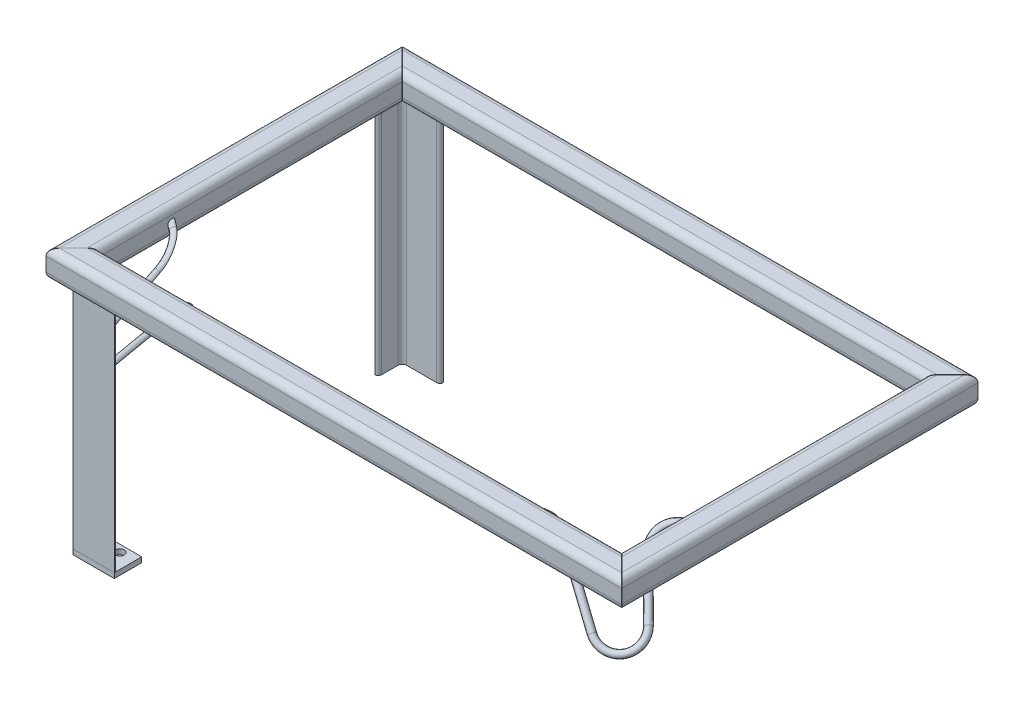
ISO-10303-21;
HEADER;
FILE_DESCRIPTION(('STEP AP214'),'2;1');
FILE_NAME('part.step','',(''),(''),'','','');
FILE_SCHEMA(('AUTOMOTIVE_DESIGN { 1 0 10303 214 1 1 1 1 }'));
ENDSEC;
DATA;
#1=APPLICATION_CONTEXT('core data for automotive mechanical design processes');
#2=APPLICATION_PROTOCOL_DEFINITION('international standard','automotive_design',2000,#1);
#3=PRODUCT_CONTEXT('',#1,'mechanical');
#4=PRODUCT('Part','Part','',(#3));
#5=PRODUCT_RELATED_PRODUCT_CATEGORY('part','',(#4));
#6=PRODUCT_DEFINITION_FORMATION('','',#4);
#7=PRODUCT_DEFINITION_CONTEXT('part definition',#1,'design');
#8=PRODUCT_DEFINITION('design','',#6,#7);
#9=PRODUCT_DEFINITION_SHAPE('','',#8);
#10=(LENGTH_UNIT() NAMED_UNIT(*) SI_UNIT(.MILLI.,.METRE.));
#11=(NAMED_UNIT(*) PLANE_ANGLE_UNIT() SI_UNIT($,.RADIAN.));
#12=(NAMED_UNIT(*) SI_UNIT($,.STERADIAN.) SOLID_ANGLE_UNIT());
#13=UNCERTAINTY_MEASURE_WITH_UNIT(LENGTH_MEASURE(1.E-05),#10,'distance_accuracy_value','');
#14=(GEOMETRIC_REPRESENTATION_CONTEXT(3) GLOBAL_UNCERTAINTY_ASSIGNED_CONTEXT((#13)) GLOBAL_UNIT_ASSIGNED_CONTEXT((#10,
#11,#12)) REPRESENTATION_CONTEXT('',''));
#15=CARTESIAN_POINT('',(0.,0.,0.));
#16=DIRECTION('',(0.,0.,1.));
#17=DIRECTION('',(1.,0.,0.));
#18=AXIS2_PLACEMENT_3D('',#15,#16,#17);
#19=CARTESIAN_POINT('',(40.0990926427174,457.2,-146.611816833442));
#20=DIRECTION('',(-0.789352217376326,0.,-0.613940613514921));
#21=DIRECTION('',(-0.613940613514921,0.,0.789352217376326));
#22=AXIS2_PLACEMENT_3D('',#19,#20,#21);
#23=CYLINDRICAL_SURFACE('',#22,6.34999999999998);
#24=CARTESIAN_POINT('',(25.4,457.2,-158.044444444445));
#25=DIRECTION('',(-1.,0.,0.));
#26=DIRECTION('',(0.,0.,-1.));
#27=AXIS2_PLACEMENT_3D('',#24,#25,#26);
#28=ELLIPSE('',#27,8.04457105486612,6.34999999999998);
#29=CARTESIAN_POINT('',(25.4,451.975110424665,-153.47266606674));
#30=VERTEX_POINT('',#29);
#31=CARTESIAN_POINT('',(25.4,462.424889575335,-162.616222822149));
#32=VERTEX_POINT('',#31);
#33=EDGE_CURVE('E57',#30,#32,#28,.T.);
#34=ORIENTED_EDGE('',*,*,#33,.F.);
#35=DIRECTION('',(-0.789352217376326,0.,-0.613940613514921));
#36=VECTOR('',#35,1.);
#37=CARTESIAN_POINT('',(37.88353850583,451.975110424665,-143.763247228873));
#38=LINE('',#37,#36);
#39=CARTESIAN_POINT('',(37.88353850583,451.975110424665,-143.763247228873));
#40=VERTEX_POINT('',#39);
#41=EDGE_CURVE('E52',#40,#30,#38,.T.);
#42=ORIENTED_EDGE('',*,*,#41,.F.);
#43=CARTESIAN_POINT('',(40.0990926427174,457.2,-146.611816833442));
#44=DIRECTION('',(0.789352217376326,0.,0.613940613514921));
#45=DIRECTION('',(0.613940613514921,0.,-0.789352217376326));
#46=AXIS2_PLACEMENT_3D('',#43,#44,#45);
#47=CIRCLE('',#46,6.34999999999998);
#48=CARTESIAN_POINT('',(36.8913207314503,460.808743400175,-142.487538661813));
#49=VERTEX_POINT('',#48);
#50=EDGE_CURVE('E206',#49,#40,#47,.T.);
#51=ORIENTED_EDGE('',*,*,#50,.F.);
#52=CARTESIAN_POINT('',(42.3146467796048,462.424889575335,-149.460386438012));
#53=VERTEX_POINT('',#52);
#54=EDGE_CURVE('E208',#53,#49,#47,.T.);
#55=ORIENTED_EDGE('',*,*,#54,.F.);
#56=DIRECTION('',(-0.789352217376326,0.,-0.613940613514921));
#57=VECTOR('',#56,1.);
#58=CARTESIAN_POINT('',(42.3146467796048,462.424889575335,-149.460386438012));
#59=LINE('',#58,#57);
#60=EDGE_CURVE('E211',#53,#32,#59,.T.);
#61=ORIENTED_EDGE('',*,*,#60,.T.);
#62=EDGE_LOOP('',(#34,#42,#51,#55,#61));
#63=FACE_BOUND('',#62,.T.);
#64=ADVANCED_FACE('F49',(#63),#23,.T.);
#65=CARTESIAN_POINT('',(37.88353850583,451.975110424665,-143.763247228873));
#66=DIRECTION('',(-0.50516093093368,0.568306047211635,0.649492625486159));
#67=DIRECTION('',(0.,-0.752576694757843,0.658504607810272));
#68=AXIS2_PLACEMENT_3D('',#65,#66,#67);
#69=PLANE('',#68);
#70=DIRECTION('',(0.,-0.752576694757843,0.658504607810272));
#71=VECTOR('',#70,1.);
#72=CARTESIAN_POINT('',(25.4,447.163363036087,-149.262387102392));
#73=LINE('',#72,#71);
#74=EDGE_CURVE('E13',#32,#30,#73,.T.);
#75=ORIENTED_EDGE('',*,*,#74,.F.);
#76=ORIENTED_EDGE('',*,*,#60,.F.);
#77=DIRECTION('',(0.348906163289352,0.822817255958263,-0.448593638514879));
#78=VECTOR('',#77,1.);
#79=CARTESIAN_POINT('',(37.88353850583,451.975110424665,-143.763247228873));
#80=LINE('',#79,#78);
#81=EDGE_CURVE('E201',#40,#53,#80,.T.);
#82=ORIENTED_EDGE('',*,*,#81,.F.);
#83=ORIENTED_EDGE('',*,*,#41,.T.);
#84=EDGE_LOOP('',(#75,#76,#82,#83));
#85=FACE_BOUND('',#84,.T.);
#86=ADVANCED_FACE('F218',(#85),#69,.F.);
#87=CARTESIAN_POINT('',(228.600000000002,457.2,6.93889390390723E-13));
#88=DIRECTION('',(-0.789352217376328,0.,-0.613940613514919));
#89=DIRECTION('',(-0.613940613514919,0.,0.789352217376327));
#90=AXIS2_PLACEMENT_3D('',#87,#88,#89);
#91=CYLINDRICAL_SURFACE('',#90,6.34999999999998);
#92=CARTESIAN_POINT('',(195.942857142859,457.2,-25.3999999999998));
#93=DIRECTION('',(0.,0.,1.));
#94=DIRECTION('',(-1.,0.,0.));
#95=AXIS2_PLACEMENT_3D('',#92,#93,#94);
#96=ELLIPSE('',#95,10.343019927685,6.34999999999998);
#97=CARTESIAN_POINT('',(201.820857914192,462.424889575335,-25.3999999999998));
#98=VERTEX_POINT('',#97);
#99=CARTESIAN_POINT('',(190.064856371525,451.975110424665,-25.3999999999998));
#100=VERTEX_POINT('',#99);
#101=EDGE_CURVE('E120',#98,#100,#96,.T.);
#102=ORIENTED_EDGE('',*,*,#101,.F.);
#103=DIRECTION('',(-0.789352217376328,0.,-0.613940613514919));
#104=VECTOR('',#103,1.);
#105=CARTESIAN_POINT('',(230.81555413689,462.424889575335,-2.84856960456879));
#106=LINE('',#105,#104);
#107=CARTESIAN_POINT('',(190.716461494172,462.424889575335,-34.0367527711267));
#108=VERTEX_POINT('',#107);
#109=EDGE_CURVE('E134',#98,#108,#106,.T.);
#110=ORIENTED_EDGE('',*,*,#109,.T.);
#111=CARTESIAN_POINT('',(188.500907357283,457.2,-31.1881831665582));
#112=DIRECTION('',(0.789352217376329,0.,0.613940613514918));
#113=DIRECTION('',(0.613940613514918,0.,-0.789352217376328));
#114=AXIS2_PLACEMENT_3D('',#111,#112,#113);
#115=CIRCLE('',#114,6.34999999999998);
#116=CARTESIAN_POINT('',(186.285353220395,451.975110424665,-28.3396135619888));
#117=VERTEX_POINT('',#116);
#118=EDGE_CURVE('E139',#108,#117,#115,.T.);
#119=ORIENTED_EDGE('',*,*,#118,.T.);
#120=DIRECTION('',(-0.789352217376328,0.,-0.613940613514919));
#121=VECTOR('',#120,1.);
#122=CARTESIAN_POINT('',(226.384445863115,451.975110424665,2.84856960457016));
#123=LINE('',#122,#121);
#124=EDGE_CURVE('E132',#100,#117,#123,.T.);
#125=ORIENTED_EDGE('',*,*,#124,.F.);
#126=EDGE_LOOP('',(#102,#110,#119,#125));
#127=FACE_BOUND('',#126,.T.);
#128=ADVANCED_FACE('F137',(#127),#91,.T.);
#129=CARTESIAN_POINT('',(226.384445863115,451.975110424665,2.84856960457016));
#130=DIRECTION('',(-0.505160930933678,0.568306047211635,0.64949262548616));
#131=DIRECTION('',(0.,-0.752576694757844,0.658504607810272));
#132=AXIS2_PLACEMENT_3D('',#129,#130,#131);
#133=PLANE('',#132);
#134=DIRECTION('',(0.747409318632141,0.664363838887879,0.));
#135=VECTOR('',#134,1.);
#136=CARTESIAN_POINT('',(210.353730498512,470.009665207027,-25.3999999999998));
#137=LINE('',#136,#135);
#138=EDGE_CURVE('E123',#100,#98,#137,.T.);
#139=ORIENTED_EDGE('',*,*,#138,.F.);
#140=ORIENTED_EDGE('',*,*,#124,.T.);
#141=DIRECTION('',(0.348906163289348,0.822817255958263,-0.448593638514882));
#142=VECTOR('',#141,1.);
#143=CARTESIAN_POINT('',(186.285353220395,451.975110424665,-28.3396135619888));
#144=LINE('',#143,#142);
#145=EDGE_CURVE('E140',#117,#108,#144,.T.);
#146=ORIENTED_EDGE('',*,*,#145,.T.);
#147=ORIENTED_EDGE('',*,*,#109,.F.);
#148=EDGE_LOOP('',(#139,#140,#146,#147));
#149=FACE_BOUND('',#148,.T.);
#150=ADVANCED_FACE('F130',(#149),#133,.F.);
#151=CARTESIAN_POINT('',(26.8057678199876,425.850662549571,-129.520399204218));
#152=DIRECTION('',(-0.505160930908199,0.568306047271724,0.6494926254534));
#153=DIRECTION('',(0.,-0.752576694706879,0.658504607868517));
#154=AXIS2_PLACEMENT_3D('',#151,#152,#153);
#155=TOROIDAL_SURFACE('',#154,38.1000000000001,6.34999999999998);
#156=CARTESIAN_POINT('',(26.8057678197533,425.850662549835,-129.520399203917));
#157=DIRECTION('',(-0.505160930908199,0.568306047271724,0.6494926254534));
#158=DIRECTION('',(0.,-0.752576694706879,0.658504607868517));
#159=AXIS2_PLACEMENT_3D('',#156,#157,#158);
#160=CIRCLE('',#159,44.45);
#161=CARTESIAN_POINT('',(60.6289903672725,423.104578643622,-100.810624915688));
#162=VERTEX_POINT('',#161);
#163=EDGE_CURVE('E142',#162,#53,#160,.T.);
#164=ORIENTED_EDGE('',*,*,#163,.T.);
#165=ORIENTED_EDGE('',*,*,#54,.T.);
#166=ORIENTED_EDGE('',*,*,#50,.T.);
#167=CARTESIAN_POINT('',(26.8057678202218,425.850662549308,-129.520399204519));
#168=DIRECTION('',(-0.505160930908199,0.568306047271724,0.6494926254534));
#169=DIRECTION('',(0.,-0.752576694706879,0.658504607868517));
#170=AXIS2_PLACEMENT_3D('',#167,#168,#169);
#171=CIRCLE('',#170,31.75);
#172=CARTESIAN_POINT('',(50.9652124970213,423.88917404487,-109.01341757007));
#173=VERTEX_POINT('',#172);
#174=EDGE_CURVE('E225',#173,#40,#171,.T.);
#175=ORIENTED_EDGE('',*,*,#174,.F.);
#176=CARTESIAN_POINT('',(55.7971014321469,423.496876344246,-104.912021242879));
#177=DIRECTION('',(-0.407187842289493,-0.820494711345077,0.401231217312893));
#178=DIRECTION('',(0.848094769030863,-0.502721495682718,-0.167351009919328));
#179=AXIS2_PLACEMENT_3D('',#176,#177,#178);
#180=CIRCLE('',#179,6.34999999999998);
#181=CARTESIAN_POINT('',(52.5893295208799,427.105619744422,-100.78774307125));
#182=VERTEX_POINT('',#181);
#183=EDGE_CURVE('E195',#182,#173,#180,.T.);
#184=ORIENTED_EDGE('',*,*,#183,.F.);
#185=EDGE_CURVE('E198',#162,#182,#180,.T.);
#186=ORIENTED_EDGE('',*,*,#185,.F.);
#187=EDGE_LOOP('',(#164,#165,#166,#175,#184,#186));
#188=FACE_BOUND('',#187,.T.);
#189=ADVANCED_FACE('F224',(#188),#155,.T.);
#190=CARTESIAN_POINT('',(50.9652124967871,423.889174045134,-109.013417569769));
#191=DIRECTION('',(-0.505160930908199,0.568306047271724,0.6494926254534));
#192=DIRECTION('',(0.,-0.752576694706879,0.658504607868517));
#193=AXIS2_PLACEMENT_3D('',#190,#191,#192);
#194=PLANE('',#193);
#195=DIRECTION('',(0.760927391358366,-0.0617791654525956,0.645889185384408));
#196=VECTOR('',#195,1.);
#197=CARTESIAN_POINT('',(50.9652124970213,423.88917404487,-109.01341757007));
#198=LINE('',#197,#196);
#199=EDGE_CURVE('E191',#173,#162,#198,.T.);
#200=ORIENTED_EDGE('',*,*,#199,.F.);
#201=ORIENTED_EDGE('',*,*,#174,.T.);
#202=ORIENTED_EDGE('',*,*,#81,.T.);
#203=ORIENTED_EDGE('',*,*,#163,.F.);
#204=EDGE_LOOP('',(#200,#201,#202,#203));
#205=FACE_BOUND('',#204,.T.);
#206=ADVANCED_FACE('F228',(#205),#194,.F.);
#207=CARTESIAN_POINT('',(16.5899251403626,344.49333681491,-66.2783946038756));
#208=DIRECTION('',(0.407187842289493,0.820494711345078,-0.401231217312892));
#209=DIRECTION('',(-0.8957592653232,0.444539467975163,0.));
#210=AXIS2_PLACEMENT_3D('',#207,#208,#209);
#211=CYLINDRICAL_SURFACE('',#210,6.34999999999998);
#212=ORIENTED_EDGE('',*,*,#185,.T.);
#213=ORIENTED_EDGE('',*,*,#183,.T.);
#214=DIRECTION('',(0.407187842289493,0.820494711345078,-0.401231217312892));
#215=VECTOR('',#214,1.);
#216=CARTESIAN_POINT('',(11.758036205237,344.885634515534,-70.3797909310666));
#217=LINE('',#216,#215);
#218=CARTESIAN_POINT('',(11.758036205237,344.885634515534,-70.3797909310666));
#219=VERTEX_POINT('',#218);
#220=EDGE_CURVE('E240',#219,#173,#217,.T.);
#221=ORIENTED_EDGE('',*,*,#220,.F.);
#222=CARTESIAN_POINT('',(16.5899251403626,344.49333681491,-66.2783946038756));
#223=DIRECTION('',(-0.407187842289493,-0.820494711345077,0.401231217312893));
#224=DIRECTION('',(0.848094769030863,-0.502721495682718,-0.167351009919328));
#225=AXIS2_PLACEMENT_3D('',#222,#223,#224);
#226=CIRCLE('',#225,6.34999999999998);
#227=CARTESIAN_POINT('',(13.3821532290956,348.102080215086,-62.1541164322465));
#228=VERTEX_POINT('',#227);
#229=EDGE_CURVE('E182',#228,#219,#226,.T.);
#230=ORIENTED_EDGE('',*,*,#229,.F.);
#231=CARTESIAN_POINT('',(21.4218140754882,344.101039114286,-62.1769982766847));
#232=VERTEX_POINT('',#231);
#233=EDGE_CURVE('E185',#232,#228,#226,.T.);
#234=ORIENTED_EDGE('',*,*,#233,.F.);
#235=DIRECTION('',(0.407187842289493,0.820494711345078,-0.401231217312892));
#236=VECTOR('',#235,1.);
#237=CARTESIAN_POINT('',(21.4218140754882,344.101039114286,-62.1769982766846));
#238=LINE('',#237,#236);
#239=EDGE_CURVE('E237',#232,#162,#238,.T.);
#240=ORIENTED_EDGE('',*,*,#239,.T.);
#241=EDGE_LOOP('',(#212,#213,#221,#230,#234,#240));
#242=FACE_BOUND('',#241,.T.);
#243=ADVANCED_FACE('F242',(#242),#211,.T.);
#244=CARTESIAN_POINT('',(11.758036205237,344.885634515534,-70.3797909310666));
#245=DIRECTION('',(-0.505160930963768,0.568306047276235,0.649492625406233));
#246=DIRECTION('',(0.,-0.752576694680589,0.658504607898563));
#247=AXIS2_PLACEMENT_3D('',#244,#245,#246);
#248=PLANE('',#247);
#249=ORIENTED_EDGE('',*,*,#199,.T.);
#250=ORIENTED_EDGE('',*,*,#239,.F.);
#251=DIRECTION('',(0.760927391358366,-0.0617791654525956,0.645889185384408));
#252=VECTOR('',#251,1.);
#253=CARTESIAN_POINT('',(11.758036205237,344.885634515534,-70.3797909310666));
#254=LINE('',#253,#252);
#255=EDGE_CURVE('E176',#219,#232,#254,.T.);
#256=ORIENTED_EDGE('',*,*,#255,.F.);
#257=ORIENTED_EDGE('',*,*,#220,.T.);
#258=EDGE_LOOP('',(#249,#250,#256,#257));
#259=FACE_BOUND('',#258,.T.);
#260=ADVANCED_FACE('F236',(#259),#248,.F.);
#261=CARTESIAN_POINT('',(45.5812587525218,342.139550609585,-41.6700166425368));
#262=DIRECTION('',(0.505160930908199,-0.568306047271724,-0.649492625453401));
#263=DIRECTION('',(0.,0.752576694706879,-0.658504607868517));
#264=AXIS2_PLACEMENT_3D('',#261,#262,#263);
#265=TOROIDAL_SURFACE('',#264,38.0999999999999,6.34999999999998);
#266=CARTESIAN_POINT('',(45.5812587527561,342.139550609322,-41.670016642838));
#267=DIRECTION('',(0.505160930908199,-0.568306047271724,-0.649492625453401));
#268=DIRECTION('',(0.,0.752576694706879,-0.658504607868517));
#269=AXIS2_PLACEMENT_3D('',#266,#267,#268);
#270=CIRCLE('',#269,44.4499999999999);
#271=CARTESIAN_POINT('',(73.0404445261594,329.36392953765,-9.13420371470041));
#272=VERTEX_POINT('',#271);
#273=EDGE_CURVE('E246',#272,#219,#270,.T.);
#274=ORIENTED_EDGE('',*,*,#273,.F.);
#275=CARTESIAN_POINT('',(69.1177037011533,331.189018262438,-13.7821769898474));
#276=DIRECTION('',(0.602654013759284,0.770986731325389,-0.205882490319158));
#277=DIRECTION('',(0.0645815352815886,-0.304272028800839,-0.950393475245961));
#278=AXIS2_PLACEMENT_3D('',#275,#276,#277);
#279=CIRCLE('',#278,6.34999999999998);
#280=CARTESIAN_POINT('',(65.9099317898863,334.797761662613,-9.65789881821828));
#281=VERTEX_POINT('',#280);
#282=EDGE_CURVE('E163',#281,#272,#279,.T.);
#283=ORIENTED_EDGE('',*,*,#282,.F.);
#284=CARTESIAN_POINT('',(65.1949628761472,333.014106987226,-18.4301502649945));
#285=VERTEX_POINT('',#284);
#286=EDGE_CURVE('E173',#285,#281,#279,.T.);
#287=ORIENTED_EDGE('',*,*,#286,.F.);
#288=CARTESIAN_POINT('',(45.5812587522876,342.139550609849,-41.6700166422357));
#289=DIRECTION('',(0.505160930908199,-0.568306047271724,-0.649492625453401));
#290=DIRECTION('',(0.,0.752576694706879,-0.658504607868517));
#291=AXIS2_PLACEMENT_3D('',#288,#289,#290);
#292=CIRCLE('',#291,31.7499999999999);
#293=EDGE_CURVE('E188',#285,#232,#292,.T.);
#294=ORIENTED_EDGE('',*,*,#293,.T.);
#295=ORIENTED_EDGE('',*,*,#233,.T.);
#296=ORIENTED_EDGE('',*,*,#229,.T.);
#297=EDGE_LOOP('',(#274,#283,#287,#294,#295,#296));
#298=FACE_BOUND('',#297,.T.);
#299=ADVANCED_FACE('F251',(#298),#265,.T.);
#300=CARTESIAN_POINT('',(73.0404445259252,329.363929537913,-9.13420371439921));
#301=DIRECTION('',(-0.505160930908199,0.568306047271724,0.649492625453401));
#302=DIRECTION('',(0.,-0.752576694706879,0.658504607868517));
#303=AXIS2_PLACEMENT_3D('',#300,#301,#302);
#304=PLANE('',#303);
#305=DIRECTION('',(-0.617754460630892,0.287415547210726,-0.73196429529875));
#306=VECTOR('',#305,1.);
#307=CARTESIAN_POINT('',(73.0404445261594,329.36392953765,-9.13420371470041));
#308=LINE('',#307,#306);
#309=EDGE_CURVE('E162',#272,#285,#308,.T.);
#310=ORIENTED_EDGE('',*,*,#309,.F.);
#311=ORIENTED_EDGE('',*,*,#273,.T.);
#312=ORIENTED_EDGE('',*,*,#255,.T.);
#313=ORIENTED_EDGE('',*,*,#293,.F.);
#314=EDGE_LOOP('',(#310,#311,#312,#313));
#315=FACE_BOUND('',#314,.T.);
#316=ADVANCED_FACE('F254',(#315),#304,.F.);
#317=CARTESIAN_POINT('',(151.671137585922,436.801194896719,-41.9846051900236));
#318=DIRECTION('',(-0.602654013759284,-0.770986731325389,0.20588249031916));
#319=DIRECTION('',(0.787865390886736,-0.61584748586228,0.));
#320=AXIS2_PLACEMENT_3D('',#317,#318,#319);
#321=CYLINDRICAL_SURFACE('',#320,6.34999999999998);
#322=ORIENTED_EDGE('',*,*,#286,.T.);
#323=ORIENTED_EDGE('',*,*,#282,.T.);
#324=DIRECTION('',(-0.602654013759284,-0.770986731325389,0.20588249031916));
#325=VECTOR('',#324,1.);
#326=CARTESIAN_POINT('',(155.593878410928,434.976106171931,-37.3366319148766));
#327=LINE('',#326,#325);
#328=CARTESIAN_POINT('',(155.593878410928,434.976106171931,-37.3366319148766));
#329=VERTEX_POINT('',#328);
#330=EDGE_CURVE('E154',#329,#272,#327,.T.);
#331=ORIENTED_EDGE('',*,*,#330,.F.);
#332=CARTESIAN_POINT('',(151.671137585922,436.801194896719,-41.9846051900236));
#333=DIRECTION('',(0.602654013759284,0.770986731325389,-0.205882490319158));
#334=DIRECTION('',(0.0645815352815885,-0.304272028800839,-0.950393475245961));
#335=AXIS2_PLACEMENT_3D('',#332,#333,#334);
#336=CIRCLE('',#335,6.34999999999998);
#337=CARTESIAN_POINT('',(147.748396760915,438.626283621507,-46.6325784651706));
#338=VERTEX_POINT('',#337);
#339=EDGE_CURVE('E150',#338,#329,#336,.T.);
#340=ORIENTED_EDGE('',*,*,#339,.F.);
#341=DIRECTION('',(-0.602654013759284,-0.770986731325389,0.20588249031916));
#342=VECTOR('',#341,1.);
#343=CARTESIAN_POINT('',(147.748396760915,438.626283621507,-46.6325784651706));
#344=LINE('',#343,#342);
#345=EDGE_CURVE('E159',#338,#285,#344,.T.);
#346=ORIENTED_EDGE('',*,*,#345,.T.);
#347=EDGE_LOOP('',(#322,#323,#331,#340,#346));
#348=FACE_BOUND('',#347,.T.);
#349=ADVANCED_FACE('F259',(#348),#321,.T.);
#350=CARTESIAN_POINT('',(155.593878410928,434.976106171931,-37.3366319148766));
#351=DIRECTION('',(-0.505160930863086,0.568306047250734,0.649492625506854));
#352=DIRECTION('',(0.,-0.75257669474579,0.658504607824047));
#353=AXIS2_PLACEMENT_3D('',#350,#351,#352);
#354=PLANE('',#353);
#355=ORIENTED_EDGE('',*,*,#309,.T.);
#356=ORIENTED_EDGE('',*,*,#345,.F.);
#357=DIRECTION('',(-0.617754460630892,0.287415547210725,-0.73196429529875));
#358=VECTOR('',#357,1.);
#359=CARTESIAN_POINT('',(155.593878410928,434.976106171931,-37.3366319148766));
#360=LINE('',#359,#358);
#361=EDGE_CURVE('E127',#329,#338,#360,.T.);
#362=ORIENTED_EDGE('',*,*,#361,.F.);
#363=ORIENTED_EDGE('',*,*,#330,.T.);
#364=EDGE_LOOP('',(#355,#356,#362,#363));
#365=FACE_BOUND('',#364,.T.);
#366=ADVANCED_FACE('F260',(#365),#354,.F.);
#367=CARTESIAN_POINT('',(175.207582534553,425.850662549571,-14.0967655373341));
#368=DIRECTION('',(-0.505160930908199,0.568306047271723,0.649492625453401));
#369=DIRECTION('',(0.,-0.752576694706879,0.658504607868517));
#370=AXIS2_PLACEMENT_3D('',#367,#368,#369);
#371=TOROIDAL_SURFACE('',#370,38.1,6.34999999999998);
#372=CARTESIAN_POINT('',(175.207582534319,425.850662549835,-14.0967655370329));
#373=DIRECTION('',(-0.505160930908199,0.568306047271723,0.649492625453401));
#374=DIRECTION('',(0.,-0.752576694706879,0.658504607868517));
#375=AXIS2_PLACEMENT_3D('',#372,#373,#374);
#376=CIRCLE('',#375,44.4500000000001);
#377=EDGE_CURVE('E151',#108,#338,#376,.T.);
#378=ORIENTED_EDGE('',*,*,#377,.T.);
#379=ORIENTED_EDGE('',*,*,#339,.T.);
#380=CARTESIAN_POINT('',(175.207582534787,425.850662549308,-14.0967655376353));
#381=DIRECTION('',(-0.505160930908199,0.568306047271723,0.649492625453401));
#382=DIRECTION('',(0.,-0.752576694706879,0.658504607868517));
#383=AXIS2_PLACEMENT_3D('',#380,#381,#382);
#384=CIRCLE('',#383,31.75);
#385=EDGE_CURVE('E147',#117,#329,#384,.T.);
#386=ORIENTED_EDGE('',*,*,#385,.F.);
#387=ORIENTED_EDGE('',*,*,#118,.F.);
#388=EDGE_LOOP('',(#378,#379,#386,#387));
#389=FACE_BOUND('',#388,.T.);
#390=ADVANCED_FACE('F266',(#389),#371,.T.);
#391=CARTESIAN_POINT('',(186.285353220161,451.975110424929,-28.3396135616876));
#392=DIRECTION('',(-0.505160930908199,0.568306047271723,0.649492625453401));
#393=DIRECTION('',(0.,-0.752576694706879,0.658504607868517));
#394=AXIS2_PLACEMENT_3D('',#391,#392,#393);
#395=PLANE('',#394);
#396=ORIENTED_EDGE('',*,*,#145,.F.);
#397=ORIENTED_EDGE('',*,*,#385,.T.);
#398=ORIENTED_EDGE('',*,*,#361,.T.);
#399=ORIENTED_EDGE('',*,*,#377,.F.);
#400=EDGE_LOOP('',(#396,#397,#398,#399));
#401=FACE_BOUND('',#400,.T.);
#402=ADVANCED_FACE('F264',(#401),#395,.F.);
#403=CARTESIAN_POINT('',(0.,444.5,-25.3999999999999));
#404=DIRECTION('',(0.,0.,1.));
#405=DIRECTION('',(0.,-1.,0.));
#406=AXIS2_PLACEMENT_3D('',#403,#404,#405);
#407=PLANE('',#406);
#408=ORIENTED_EDGE('',*,*,#101,.T.);
#409=ORIENTED_EDGE('',*,*,#138,.T.);
#410=EDGE_LOOP('',(#408,#409));
#411=FACE_BOUND('',#410,.T.);
#412=ADVANCED_FACE('F122',(#411),#407,.T.);
#413=CARTESIAN_POINT('',(25.3999999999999,444.5,-609.6));
#414=DIRECTION('',(-1.,0.,0.));
#415=DIRECTION('',(0.,0.,1.));
#416=AXIS2_PLACEMENT_3D('',#413,#414,#415);
#417=PLANE('',#416);
#418=ORIENTED_EDGE('',*,*,#33,.T.);
#419=ORIENTED_EDGE('',*,*,#74,.T.);
#420=EDGE_LOOP('',(#418,#419));
#421=FACE_BOUND('',#420,.T.);
#422=ADVANCED_FACE('F285',(#421),#417,.T.);
#423=CLOSED_SHELL('',(#64,#86,#128,#150,#189,#206,#243,#260,#299,#316,#349,#366,#390,#402,#412,#422));
#424=MANIFOLD_SOLID_BREP('B2',#423);
#425=CARTESIAN_POINT('',(975.900907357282,457.200000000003,-146.611816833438));
#426=DIRECTION('',(0.789352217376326,0.,-0.613940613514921));
#427=DIRECTION('',(-0.613940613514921,0.,-0.789352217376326));
#428=AXIS2_PLACEMENT_3D('',#425,#426,#427);
#429=CYLINDRICAL_SURFACE('',#428,6.35000000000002);
#430=CARTESIAN_POINT('',(990.600000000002,457.200000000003,-158.044444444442));
#431=DIRECTION('',(1.,0.,0.));
#432=DIRECTION('',(0.,0.,-1.));
#433=AXIS2_PLACEMENT_3D('',#430,#431,#432);
#434=ELLIPSE('',#433,8.04457105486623,6.35000000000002);
#435=CARTESIAN_POINT('',(990.600000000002,462.424889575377,-162.616222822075));
#436=VERTEX_POINT('',#435);
#437=CARTESIAN_POINT('',(990.600000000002,451.975110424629,-153.47266606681));
#438=VERTEX_POINT('',#437);
#439=EDGE_CURVE('E415',#436,#438,#434,.T.);
#440=ORIENTED_EDGE('',*,*,#439,.F.);
#441=DIRECTION('',(0.789352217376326,0.,-0.613940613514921));
#442=VECTOR('',#441,1.);
#443=CARTESIAN_POINT('',(973.685353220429,462.424889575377,-149.460386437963));
#444=LINE('',#443,#442);
#445=CARTESIAN_POINT('',(973.685353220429,462.424889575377,-149.460386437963));
#446=VERTEX_POINT('',#445);
#447=EDGE_CURVE('E410',#446,#436,#444,.T.);
#448=ORIENTED_EDGE('',*,*,#447,.F.);
#449=CARTESIAN_POINT('',(975.900907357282,457.200000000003,-146.611816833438));
#450=DIRECTION('',(-0.789352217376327,0.,0.61394061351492));
#451=DIRECTION('',(0.61394061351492,0.,0.789352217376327));
#452=AXIS2_PLACEMENT_3D('',#449,#450,#451);
#453=CIRCLE('',#452,6.35000000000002);
#454=CARTESIAN_POINT('',(979.108679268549,460.808743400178,-142.487538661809));
#455=VERTEX_POINT('',#454);
#456=EDGE_CURVE('E563',#455,#446,#453,.T.);
#457=ORIENTED_EDGE('',*,*,#456,.F.);
#458=CARTESIAN_POINT('',(975.900907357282,457.200000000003,-146.611816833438));
#459=DIRECTION('',(-0.789352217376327,0.,0.61394061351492));
#460=DIRECTION('',(0.61394061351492,0.,0.789352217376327));
#461=AXIS2_PLACEMENT_3D('',#458,#459,#460);
#462=CIRCLE('',#461,6.35000000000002);
#463=CARTESIAN_POINT('',(978.116461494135,451.975110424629,-143.763247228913));
#464=VERTEX_POINT('',#463);
#465=EDGE_CURVE('E559',#464,#455,#462,.T.);
#466=ORIENTED_EDGE('',*,*,#465,.F.);
#467=DIRECTION('',(0.789352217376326,0.,-0.613940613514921));
#468=VECTOR('',#467,1.);
#469=CARTESIAN_POINT('',(978.116461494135,451.975110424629,-143.763247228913));
#470=LINE('',#469,#468);
#471=EDGE_CURVE('E570',#464,#438,#470,.T.);
#472=ORIENTED_EDGE('',*,*,#471,.T.);
#473=EDGE_LOOP('',(#440,#448,#457,#466,#472));
#474=FACE_BOUND('',#473,.T.);
#475=ADVANCED_FACE('F407',(#474),#429,.T.);
#476=CARTESIAN_POINT('',(973.685353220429,462.424889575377,-149.460386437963));
#477=DIRECTION('',(0.505160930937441,0.56830604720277,0.649492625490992));
#478=DIRECTION('',(0.,-0.752576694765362,0.658504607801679));
#479=AXIS2_PLACEMENT_3D('',#476,#477,#478);
#480=PLANE('',#479);
#481=DIRECTION('',(0.,0.752576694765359,-0.658504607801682));
#482=VECTOR('',#481,1.);
#483=CARTESIAN_POINT('',(990.600000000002,455.905183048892,-156.911479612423));
#484=LINE('',#483,#482);
#485=EDGE_CURVE('E47',#438,#436,#484,.T.);
#486=ORIENTED_EDGE('',*,*,#485,.F.);
#487=ORIENTED_EDGE('',*,*,#471,.F.);
#488=DIRECTION('',(0.348906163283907,-0.822817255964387,0.448593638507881));
#489=VECTOR('',#488,1.);
#490=CARTESIAN_POINT('',(973.685353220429,462.424889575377,-149.460386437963));
#491=LINE('',#490,#489);
#492=EDGE_CURVE('E554',#446,#464,#491,.T.);
#493=ORIENTED_EDGE('',*,*,#492,.F.);
#494=ORIENTED_EDGE('',*,*,#447,.T.);
#495=EDGE_LOOP('',(#486,#487,#493,#494));
#496=FACE_BOUND('',#495,.T.);
#497=ADVANCED_FACE('F577',(#496),#480,.F.);
#498=CARTESIAN_POINT('',(787.4,457.2,0.));
#499=DIRECTION('',(0.789352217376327,0.,-0.61394061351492));
#500=DIRECTION('',(-0.61394061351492,0.,-0.789352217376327));
#501=AXIS2_PLACEMENT_3D('',#498,#499,#500);
#502=CYLINDRICAL_SURFACE('',#501,6.35000000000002);
#503=CARTESIAN_POINT('',(820.057142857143,457.2,-25.3999999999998));
#504=DIRECTION('',(0.,0.,1.));
#505=DIRECTION('',(1.,0.,0.));
#506=AXIS2_PLACEMENT_3D('',#503,#504,#505);
#507=ELLIPSE('',#506,10.3430199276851,6.35000000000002);
#508=CARTESIAN_POINT('',(825.935143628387,451.975110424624,-25.3999999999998));
#509=VERTEX_POINT('',#508);
#510=CARTESIAN_POINT('',(814.179142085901,462.424889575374,-25.3999999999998));
#511=VERTEX_POINT('',#510);
#512=EDGE_CURVE('E478',#509,#511,#507,.T.);
#513=ORIENTED_EDGE('',*,*,#512,.F.);
#514=DIRECTION('',(0.789352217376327,0.,-0.61394061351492));
#515=VECTOR('',#514,1.);
#516=CARTESIAN_POINT('',(789.615554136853,451.975110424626,2.84856960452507));
#517=LINE('',#516,#515);
#518=CARTESIAN_POINT('',(829.71464677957,451.975110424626,-28.3396135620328));
#519=VERTEX_POINT('',#518);
#520=EDGE_CURVE('E492',#509,#519,#517,.T.);
#521=ORIENTED_EDGE('',*,*,#520,.T.);
#522=CARTESIAN_POINT('',(827.499092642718,457.2,-31.1881831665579));
#523=DIRECTION('',(-0.789352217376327,0.,0.61394061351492));
#524=DIRECTION('',(0.61394061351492,0.,0.789352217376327));
#525=AXIS2_PLACEMENT_3D('',#522,#523,#524);
#526=CIRCLE('',#525,6.35000000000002);
#527=CARTESIAN_POINT('',(825.283538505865,462.424889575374,-34.0367527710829));
#528=VERTEX_POINT('',#527);
#529=EDGE_CURVE('E497',#519,#528,#526,.T.);
#530=ORIENTED_EDGE('',*,*,#529,.T.);
#531=DIRECTION('',(0.789352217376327,0.,-0.61394061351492));
#532=VECTOR('',#531,1.);
#533=CARTESIAN_POINT('',(785.184445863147,462.424889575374,-2.84856960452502));
#534=LINE('',#533,#532);
#535=EDGE_CURVE('E490',#511,#528,#534,.T.);
#536=ORIENTED_EDGE('',*,*,#535,.F.);
#537=EDGE_LOOP('',(#513,#521,#530,#536));
#538=FACE_BOUND('',#537,.T.);
#539=ADVANCED_FACE('F495',(#538),#502,.T.);
#540=CARTESIAN_POINT('',(785.184445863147,462.424889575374,-2.84856960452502));
#541=DIRECTION('',(0.505160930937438,0.568306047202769,0.649492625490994));
#542=DIRECTION('',(0.,-0.752576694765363,0.658504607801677));
#543=AXIS2_PLACEMENT_3D('',#540,#541,#542);
#544=PLANE('',#543);
#545=DIRECTION('',(0.747409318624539,-0.664363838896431,0.));
#546=VECTOR('',#545,1.);
#547=CARTESIAN_POINT('',(797.982104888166,476.82225597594,-25.3999999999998));
#548=LINE('',#547,#546);
#549=EDGE_CURVE('E481',#511,#509,#548,.T.);
#550=ORIENTED_EDGE('',*,*,#549,.F.);
#551=ORIENTED_EDGE('',*,*,#535,.T.);
#552=DIRECTION('',(0.348906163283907,-0.822817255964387,0.448593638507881));
#553=VECTOR('',#552,1.);
#554=CARTESIAN_POINT('',(825.283538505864,462.424889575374,-34.0367527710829));
#555=LINE('',#554,#553);
#556=EDGE_CURVE('E498',#528,#519,#555,.T.);
#557=ORIENTED_EDGE('',*,*,#556,.T.);
#558=ORIENTED_EDGE('',*,*,#520,.F.);
#559=EDGE_LOOP('',(#550,#551,#557,#558));
#560=FACE_BOUND('',#559,.T.);
#561=ADVANCED_FACE('F488',(#560),#544,.F.);
#562=CARTESIAN_POINT('',(989.194232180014,425.850662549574,-129.520399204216));
#563=DIRECTION('',(-0.505160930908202,-0.568306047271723,-0.649492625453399));
#564=DIRECTION('',(0.,0.752576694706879,-0.658504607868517));
#565=AXIS2_PLACEMENT_3D('',#562,#563,#564);
#566=TOROIDAL_SURFACE('',#565,38.1000000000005,6.35000000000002);
#567=CARTESIAN_POINT('',(989.194232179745,425.850662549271,-129.520399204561));
#568=DIRECTION('',(-0.505160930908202,-0.568306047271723,-0.649492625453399));
#569=DIRECTION('',(0.,0.752576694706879,-0.658504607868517));
#570=AXIS2_PLACEMENT_3D('',#567,#568,#569);
#571=CIRCLE('',#570,31.7500000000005);
#572=CARTESIAN_POINT('',(965.034787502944,423.889174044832,-109.013417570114));
#573=VERTEX_POINT('',#572);
#574=EDGE_CURVE('E500',#573,#464,#571,.T.);
#575=ORIENTED_EDGE('',*,*,#574,.T.);
#576=ORIENTED_EDGE('',*,*,#465,.T.);
#577=ORIENTED_EDGE('',*,*,#456,.T.);
#578=CARTESIAN_POINT('',(989.194232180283,425.850662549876,-129.52039920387));
#579=DIRECTION('',(-0.505160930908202,-0.568306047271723,-0.649492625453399));
#580=DIRECTION('',(0.,0.752576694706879,-0.658504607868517));
#581=AXIS2_PLACEMENT_3D('',#578,#579,#580);
#582=CIRCLE('',#581,44.4500000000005);
#583=CARTESIAN_POINT('',(955.371009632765,423.104578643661,-100.81062491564));
#584=VERTEX_POINT('',#583);
#585=EDGE_CURVE('E568',#584,#446,#582,.T.);
#586=ORIENTED_EDGE('',*,*,#585,.F.);
#587=CARTESIAN_POINT('',(960.202898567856,423.496876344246,-104.912021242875));
#588=DIRECTION('',(0.407187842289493,-0.82049471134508,0.401231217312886));
#589=DIRECTION('',(0.848094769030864,0.502721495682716,0.167351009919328));
#590=AXIS2_PLACEMENT_3D('',#587,#588,#589);
#591=CIRCLE('',#590,6.35000000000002);
#592=CARTESIAN_POINT('',(963.410670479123,427.105619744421,-100.787743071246));
#593=VERTEX_POINT('',#592);
#594=EDGE_CURVE('E553',#593,#584,#591,.T.);
#595=ORIENTED_EDGE('',*,*,#594,.F.);
#596=CARTESIAN_POINT('',(960.202898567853,423.496876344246,-104.912021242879));
#597=DIRECTION('',(0.407187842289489,-0.820494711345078,0.401231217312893));
#598=DIRECTION('',(0.848094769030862,0.502721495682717,0.167351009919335));
#599=AXIS2_PLACEMENT_3D('',#596,#597,#598);
#600=CIRCLE('',#599,6.35000000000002);
#601=EDGE_CURVE('E550',#573,#593,#600,.T.);
#602=ORIENTED_EDGE('',*,*,#601,.F.);
#603=EDGE_LOOP('',(#575,#576,#577,#586,#595,#602));
#604=FACE_BOUND('',#603,.T.);
#605=ADVANCED_FACE('F582',(#604),#566,.T.);
#606=CARTESIAN_POINT('',(955.371009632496,423.104578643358,-100.810624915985));
#607=DIRECTION('',(0.505160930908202,0.568306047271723,0.649492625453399));
#608=DIRECTION('',(0.,-0.752576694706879,0.658504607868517));
#609=AXIS2_PLACEMENT_3D('',#606,#607,#608);
#610=PLANE('',#609);
#611=DIRECTION('',(0.760927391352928,0.0617791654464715,-0.6458891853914));
#612=VECTOR('',#611,1.);
#613=CARTESIAN_POINT('',(955.371009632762,423.104578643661,-100.810624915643));
#614=LINE('',#613,#612);
#615=EDGE_CURVE('E588',#584,#573,#614,.T.);
#616=ORIENTED_EDGE('',*,*,#615,.F.);
#617=ORIENTED_EDGE('',*,*,#585,.T.);
#618=ORIENTED_EDGE('',*,*,#492,.T.);
#619=ORIENTED_EDGE('',*,*,#574,.F.);
#620=EDGE_LOOP('',(#616,#617,#618,#619));
#621=FACE_BOUND('',#620,.T.);
#622=ADVANCED_FACE('F585',(#621),#610,.F.);
#623=CARTESIAN_POINT('',(999.410074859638,344.49333681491,-66.2783946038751));
#624=DIRECTION('',(-0.407187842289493,0.820494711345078,-0.401231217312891));
#625=DIRECTION('',(-0.8957592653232,-0.444539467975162,0.));
#626=AXIS2_PLACEMENT_3D('',#623,#624,#625);
#627=CYLINDRICAL_SURFACE('',#626,6.35000000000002);
#628=ORIENTED_EDGE('',*,*,#601,.T.);
#629=ORIENTED_EDGE('',*,*,#594,.T.);
#630=DIRECTION('',(-0.407187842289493,0.820494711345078,-0.401231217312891));
#631=VECTOR('',#630,1.);
#632=CARTESIAN_POINT('',(994.578185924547,344.101039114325,-62.1769982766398));
#633=LINE('',#632,#631);
#634=CARTESIAN_POINT('',(994.578185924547,344.101039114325,-62.1769982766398));
#635=VERTEX_POINT('',#634);
#636=EDGE_CURVE('E548',#635,#584,#633,.T.);
#637=ORIENTED_EDGE('',*,*,#636,.F.);
#638=CARTESIAN_POINT('',(999.410074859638,344.49333681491,-66.2783946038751));
#639=DIRECTION('',(0.407187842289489,-0.820494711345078,0.401231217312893));
#640=DIRECTION('',(0.848094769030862,0.502721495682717,0.167351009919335));
#641=AXIS2_PLACEMENT_3D('',#638,#639,#640);
#642=CIRCLE('',#641,6.35000000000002);
#643=CARTESIAN_POINT('',(1002.6178467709,348.102080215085,-62.154116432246));
#644=VERTEX_POINT('',#643);
#645=EDGE_CURVE('E536',#644,#635,#642,.T.);
#646=ORIENTED_EDGE('',*,*,#645,.F.);
#647=CARTESIAN_POINT('',(999.410074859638,344.49333681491,-66.2783946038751));
#648=DIRECTION('',(0.407187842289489,-0.820494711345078,0.401231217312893));
#649=DIRECTION('',(0.848094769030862,0.502721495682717,0.167351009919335));
#650=AXIS2_PLACEMENT_3D('',#647,#648,#649);
#651=CIRCLE('',#650,6.35000000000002);
#652=CARTESIAN_POINT('',(1004.24196379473,344.885634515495,-70.3797909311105));
#653=VERTEX_POINT('',#652);
#654=EDGE_CURVE('E532',#653,#644,#651,.T.);
#655=ORIENTED_EDGE('',*,*,#654,.F.);
#656=DIRECTION('',(-0.407187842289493,0.820494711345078,-0.401231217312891));
#657=VECTOR('',#656,1.);
#658=CARTESIAN_POINT('',(1004.24196379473,344.885634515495,-70.3797909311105));
#659=LINE('',#658,#657);
#660=EDGE_CURVE('E597',#653,#573,#659,.T.);
#661=ORIENTED_EDGE('',*,*,#660,.T.);
#662=EDGE_LOOP('',(#628,#629,#637,#646,#655,#661));
#663=FACE_BOUND('',#662,.T.);
#664=ADVANCED_FACE('F601',(#663),#627,.T.);
#665=CARTESIAN_POINT('',(994.578185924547,344.101039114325,-62.1769982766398));
#666=DIRECTION('',(0.505160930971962,0.5683060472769,0.649492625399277));
#667=DIRECTION('',(0.,-0.752576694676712,0.658504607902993));
#668=AXIS2_PLACEMENT_3D('',#665,#666,#667);
#669=PLANE('',#668);
#670=ORIENTED_EDGE('',*,*,#615,.T.);
#671=ORIENTED_EDGE('',*,*,#660,.F.);
#672=DIRECTION('',(0.760927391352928,0.0617791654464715,-0.6458891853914));
#673=VECTOR('',#672,1.);
#674=CARTESIAN_POINT('',(994.578185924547,344.101039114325,-62.1769982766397));
#675=LINE('',#674,#673);
#676=EDGE_CURVE('E527',#635,#653,#675,.T.);
#677=ORIENTED_EDGE('',*,*,#676,.F.);
#678=ORIENTED_EDGE('',*,*,#636,.T.);
#679=EDGE_LOOP('',(#670,#671,#677,#678));
#680=FACE_BOUND('',#679,.T.);
#681=ADVANCED_FACE('F596',(#680),#669,.F.);
#682=CARTESIAN_POINT('',(970.418741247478,342.139550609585,-41.6700166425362));
#683=DIRECTION('',(0.505160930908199,0.568306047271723,0.649492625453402));
#684=DIRECTION('',(0.,-0.75257669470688,0.658504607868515));
#685=AXIS2_PLACEMENT_3D('',#682,#683,#684);
#686=TOROIDAL_SURFACE('',#685,38.1,6.35000000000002);
#687=CARTESIAN_POINT('',(970.418741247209,342.139550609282,-41.6700166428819));
#688=DIRECTION('',(0.505160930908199,0.568306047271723,0.649492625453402));
#689=DIRECTION('',(0.,-0.75257669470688,0.658504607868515));
#690=AXIS2_PLACEMENT_3D('',#687,#688,#689);
#691=CIRCLE('',#690,44.4500000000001);
#692=CARTESIAN_POINT('',(942.959555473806,329.36392953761,-9.1342037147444));
#693=VERTEX_POINT('',#692);
#694=EDGE_CURVE('E537',#693,#653,#691,.T.);
#695=ORIENTED_EDGE('',*,*,#694,.T.);
#696=ORIENTED_EDGE('',*,*,#654,.T.);
#697=ORIENTED_EDGE('',*,*,#645,.T.);
#698=CARTESIAN_POINT('',(970.418741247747,342.139550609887,-41.6700166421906));
#699=DIRECTION('',(0.505160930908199,0.568306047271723,0.649492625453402));
#700=DIRECTION('',(0.,-0.75257669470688,0.658504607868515));
#701=AXIS2_PLACEMENT_3D('',#698,#699,#700);
#702=CIRCLE('',#701,31.7500000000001);
#703=CARTESIAN_POINT('',(950.805037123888,333.014106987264,-18.4301502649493));
#704=VERTEX_POINT('',#703);
#705=EDGE_CURVE('E547',#704,#635,#702,.T.);
#706=ORIENTED_EDGE('',*,*,#705,.F.);
#707=CARTESIAN_POINT('',(946.882296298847,331.189018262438,-13.7821769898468));
#708=DIRECTION('',(-0.602654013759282,0.77098673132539,-0.20588249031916));
#709=DIRECTION('',(0.0645815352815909,0.304272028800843,0.950393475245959));
#710=AXIS2_PLACEMENT_3D('',#707,#708,#709);
#711=CIRCLE('',#710,6.35000000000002);
#712=CARTESIAN_POINT('',(950.090068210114,334.797761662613,-9.65789881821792));
#713=VERTEX_POINT('',#712);
#714=EDGE_CURVE('E526',#713,#704,#711,.T.);
#715=ORIENTED_EDGE('',*,*,#714,.F.);
#716=CARTESIAN_POINT('',(946.882296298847,331.189018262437,-13.7821769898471));
#717=DIRECTION('',(-0.602654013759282,0.770986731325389,-0.20588249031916));
#718=DIRECTION('',(0.0645815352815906,0.304272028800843,0.950393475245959));
#719=AXIS2_PLACEMENT_3D('',#716,#717,#718);
#720=CIRCLE('',#719,6.35000000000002);
#721=EDGE_CURVE('E522',#693,#713,#720,.T.);
#722=ORIENTED_EDGE('',*,*,#721,.F.);
#723=EDGE_LOOP('',(#695,#696,#697,#706,#715,#722));
#724=FACE_BOUND('',#723,.T.);
#725=ADVANCED_FACE('F604',(#724),#686,.T.);
#726=CARTESIAN_POINT('',(950.805037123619,333.014106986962,-18.430150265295));
#727=DIRECTION('',(0.505160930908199,0.568306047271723,0.649492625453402));
#728=DIRECTION('',(0.,-0.75257669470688,0.658504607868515));
#729=AXIS2_PLACEMENT_3D('',#726,#727,#728);
#730=PLANE('',#729);
#731=DIRECTION('',(-0.617754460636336,-0.287415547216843,0.731964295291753));
#732=VECTOR('',#731,1.);
#733=CARTESIAN_POINT('',(950.805037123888,333.014106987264,-18.4301502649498));
#734=LINE('',#733,#732);
#735=EDGE_CURVE('E519',#704,#693,#734,.T.);
#736=ORIENTED_EDGE('',*,*,#735,.F.);
#737=ORIENTED_EDGE('',*,*,#705,.T.);
#738=ORIENTED_EDGE('',*,*,#676,.T.);
#739=ORIENTED_EDGE('',*,*,#694,.F.);
#740=EDGE_LOOP('',(#736,#737,#738,#739));
#741=FACE_BOUND('',#740,.T.);
#742=ADVANCED_FACE('F608',(#741),#730,.F.);
#743=CARTESIAN_POINT('',(864.328862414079,436.801194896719,-41.9846051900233));
#744=DIRECTION('',(0.602654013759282,-0.77098673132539,0.20588249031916));
#745=DIRECTION('',(0.787865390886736,0.615847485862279,0.));
#746=AXIS2_PLACEMENT_3D('',#743,#744,#745);
#747=CYLINDRICAL_SURFACE('',#746,6.35000000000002);
#748=ORIENTED_EDGE('',*,*,#721,.T.);
#749=ORIENTED_EDGE('',*,*,#714,.T.);
#750=DIRECTION('',(0.602654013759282,-0.77098673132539,0.20588249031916));
#751=VECTOR('',#750,1.);
#752=CARTESIAN_POINT('',(868.25160323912,438.626283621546,-46.632578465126));
#753=LINE('',#752,#751);
#754=CARTESIAN_POINT('',(868.25160323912,438.626283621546,-46.632578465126));
#755=VERTEX_POINT('',#754);
#756=EDGE_CURVE('E516',#755,#704,#753,.T.);
#757=ORIENTED_EDGE('',*,*,#756,.F.);
#758=CARTESIAN_POINT('',(864.328862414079,436.801194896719,-41.9846051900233));
#759=DIRECTION('',(-0.602654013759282,0.770986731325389,-0.20588249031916));
#760=DIRECTION('',(0.0645815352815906,0.304272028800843,0.950393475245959));
#761=AXIS2_PLACEMENT_3D('',#758,#759,#760);
#762=CIRCLE('',#761,6.35000000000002);
#763=CARTESIAN_POINT('',(860.406121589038,434.976106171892,-37.3366319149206));
#764=VERTEX_POINT('',#763);
#765=EDGE_CURVE('E505',#764,#755,#762,.T.);
#766=ORIENTED_EDGE('',*,*,#765,.F.);
#767=DIRECTION('',(0.602654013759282,-0.77098673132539,0.20588249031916));
#768=VECTOR('',#767,1.);
#769=CARTESIAN_POINT('',(860.406121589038,434.976106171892,-37.3366319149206));
#770=LINE('',#769,#768);
#771=EDGE_CURVE('E619',#764,#693,#770,.T.);
#772=ORIENTED_EDGE('',*,*,#771,.T.);
#773=EDGE_LOOP('',(#748,#749,#757,#766,#772));
#774=FACE_BOUND('',#773,.T.);
#775=ADVANCED_FACE('F622',(#774),#747,.T.);
#776=CARTESIAN_POINT('',(868.25160323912,438.626283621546,-46.632578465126));
#777=DIRECTION('',(0.505160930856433,0.568306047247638,0.649492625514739));
#778=DIRECTION('',(0.,-0.752576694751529,0.658504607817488));
#779=AXIS2_PLACEMENT_3D('',#776,#777,#778);
#780=PLANE('',#779);
#781=ORIENTED_EDGE('',*,*,#735,.T.);
#782=ORIENTED_EDGE('',*,*,#771,.F.);
#783=DIRECTION('',(-0.617754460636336,-0.287415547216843,0.731964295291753));
#784=VECTOR('',#783,1.);
#785=CARTESIAN_POINT('',(868.25160323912,438.626283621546,-46.632578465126));
#786=LINE('',#785,#784);
#787=EDGE_CURVE('E485',#755,#764,#786,.T.);
#788=ORIENTED_EDGE('',*,*,#787,.F.);
#789=ORIENTED_EDGE('',*,*,#756,.T.);
#790=EDGE_LOOP('',(#781,#782,#788,#789));
#791=FACE_BOUND('',#790,.T.);
#792=ADVANCED_FACE('F618',(#791),#780,.F.);
#793=CARTESIAN_POINT('',(840.792417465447,425.850662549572,-14.0967655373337));
#794=DIRECTION('',(-0.505160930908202,-0.568306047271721,-0.649492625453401));
#795=DIRECTION('',(0.,0.75257669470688,-0.658504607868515));
#796=AXIS2_PLACEMENT_3D('',#793,#794,#795);
#797=TOROIDAL_SURFACE('',#796,38.1000000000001,6.35000000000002);
#798=CARTESIAN_POINT('',(840.792417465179,425.850662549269,-14.0967655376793));
#799=DIRECTION('',(-0.505160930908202,-0.568306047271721,-0.649492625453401));
#800=DIRECTION('',(0.,0.75257669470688,-0.658504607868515));
#801=AXIS2_PLACEMENT_3D('',#798,#799,#800);
#802=CIRCLE('',#801,31.7500000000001);
#803=EDGE_CURVE('E509',#519,#764,#802,.T.);
#804=ORIENTED_EDGE('',*,*,#803,.T.);
#805=ORIENTED_EDGE('',*,*,#765,.T.);
#806=CARTESIAN_POINT('',(840.792417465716,425.850662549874,-14.0967655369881));
#807=DIRECTION('',(-0.505160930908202,-0.568306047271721,-0.649492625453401));
#808=DIRECTION('',(0.,0.75257669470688,-0.658504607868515));
#809=AXIS2_PLACEMENT_3D('',#806,#807,#808);
#810=CIRCLE('',#809,44.4500000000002);
#811=EDGE_CURVE('E508',#528,#755,#810,.T.);
#812=ORIENTED_EDGE('',*,*,#811,.F.);
#813=ORIENTED_EDGE('',*,*,#529,.F.);
#814=EDGE_LOOP('',(#804,#805,#812,#813));
#815=FACE_BOUND('',#814,.T.);
#816=ADVANCED_FACE('F628',(#815),#797,.T.);
#817=CARTESIAN_POINT('',(825.283538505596,462.424889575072,-34.0367527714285));
#818=DIRECTION('',(0.505160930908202,0.568306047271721,0.649492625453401));
#819=DIRECTION('',(0.,-0.75257669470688,0.658504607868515));
#820=AXIS2_PLACEMENT_3D('',#817,#818,#819);
#821=PLANE('',#820);
#822=ORIENTED_EDGE('',*,*,#556,.F.);
#823=ORIENTED_EDGE('',*,*,#811,.T.);
#824=ORIENTED_EDGE('',*,*,#787,.T.);
#825=ORIENTED_EDGE('',*,*,#803,.F.);
#826=EDGE_LOOP('',(#822,#823,#824,#825));
#827=FACE_BOUND('',#826,.T.);
#828=ADVANCED_FACE('F625',(#827),#821,.F.);
#829=CARTESIAN_POINT('',(-1.11022302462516E-13,444.5,-25.3999999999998));
#830=DIRECTION('',(0.,0.,1.));
#831=DIRECTION('',(0.,-1.,0.));
#832=AXIS2_PLACEMENT_3D('',#829,#830,#831);
#833=PLANE('',#832);
#834=ORIENTED_EDGE('',*,*,#512,.T.);
#835=ORIENTED_EDGE('',*,*,#549,.T.);
#836=EDGE_LOOP('',(#834,#835));
#837=FACE_BOUND('',#836,.T.);
#838=ADVANCED_FACE('F480',(#837),#833,.T.);
#839=CARTESIAN_POINT('',(990.6,444.5,-1.2490009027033E-13));
#840=DIRECTION('',(1.,0.,0.));
#841=DIRECTION('',(0.,0.,-1.));
#842=AXIS2_PLACEMENT_3D('',#839,#840,#841);
#843=PLANE('',#842);
#844=ORIENTED_EDGE('',*,*,#439,.T.);
#845=ORIENTED_EDGE('',*,*,#485,.T.);
#846=EDGE_LOOP('',(#844,#845));
#847=FACE_BOUND('',#846,.T.);
#848=ADVANCED_FACE('F647',(#847),#843,.T.);
#849=CLOSED_SHELL('',(#475,#497,#539,#561,#605,#622,#664,#681,#725,#742,#775,#792,#816,#828,
#838,#848));
#850=MANIFOLD_SOLID_BREP('B7',#849);
#851=CARTESIAN_POINT('',(0.,-9.525,0.));
#852=DIRECTION('',(1.,0.,0.));
#853=DIRECTION('',(0.,0.,-1.));
#854=AXIS2_PLACEMENT_3D('',#851,#852,#853);
#855=PLANE('',#854);
#856=DIRECTION('',(0.,0.,-1.));
#857=VECTOR('',#856,1.);
#858=CARTESIAN_POINT('',(0.,0.,0.));
#859=LINE('',#858,#857);
#860=CARTESIAN_POINT('',(0.,0.,0.));
#861=VERTEX_POINT('',#860);
#862=CARTESIAN_POINT('',(0.,0.,-50.8));
#863=VERTEX_POINT('',#862);
#864=EDGE_CURVE('E832',#861,#863,#859,.T.);
#865=ORIENTED_EDGE('',*,*,#864,.T.);
#866=DIRECTION('',(0.,1.,0.));
#867=VECTOR('',#866,1.);
#868=CARTESIAN_POINT('',(0.,-9.525,-50.8));
#869=LINE('',#868,#867);
#870=CARTESIAN_POINT('',(0.,-9.525,-50.8));
#871=VERTEX_POINT('',#870);
#872=EDGE_CURVE('E405',#871,#863,#869,.T.);
#873=ORIENTED_EDGE('',*,*,#872,.F.);
#874=DIRECTION('',(0.,0.,-1.));
#875=VECTOR('',#874,1.);
#876=CARTESIAN_POINT('',(0.,-9.525,0.));
#877=LINE('',#876,#875);
#878=CARTESIAN_POINT('',(0.,-9.525,0.));
#879=VERTEX_POINT('',#878);
#880=EDGE_CURVE('E820',#879,#871,#877,.T.);
#881=ORIENTED_EDGE('',*,*,#880,.F.);
#882=DIRECTION('',(0.,1.,0.));
#883=VECTOR('',#882,1.);
#884=CARTESIAN_POINT('',(0.,-9.525,0.));
#885=LINE('',#884,#883);
#886=EDGE_CURVE('E828',#879,#861,#885,.T.);
#887=ORIENTED_EDGE('',*,*,#886,.T.);
#888=EDGE_LOOP('',(#865,#873,#881,#887));
#889=FACE_BOUND('',#888,.T.);
#890=ADVANCED_FACE('F769',(#889),#855,.F.);
#891=CARTESIAN_POINT('',(0.,-9.525,-50.8));
#892=DIRECTION('',(0.,0.,1.));
#893=DIRECTION('',(1.,0.,0.));
#894=AXIS2_PLACEMENT_3D('',#891,#892,#893);
#895=PLANE('',#894);
#896=DIRECTION('',(1.,0.,0.));
#897=VECTOR('',#896,1.);
#898=CARTESIAN_POINT('',(0.,0.,-50.8));
#899=LINE('',#898,#897);
#900=CARTESIAN_POINT('',(76.2,0.,-50.8));
#901=VERTEX_POINT('',#900);
#902=EDGE_CURVE('E824',#863,#901,#899,.T.);
#903=ORIENTED_EDGE('',*,*,#902,.T.);
#904=DIRECTION('',(0.,1.,0.));
#905=VECTOR('',#904,1.);
#906=CARTESIAN_POINT('',(76.2,-9.525,-50.8));
#907=LINE('',#906,#905);
#908=CARTESIAN_POINT('',(76.2,-9.525,-50.8));
#909=VERTEX_POINT('',#908);
#910=EDGE_CURVE('E777',#909,#901,#907,.T.);
#911=ORIENTED_EDGE('',*,*,#910,.F.);
#912=DIRECTION('',(1.,0.,0.));
#913=VECTOR('',#912,1.);
#914=CARTESIAN_POINT('',(0.,-9.525,-50.8));
#915=LINE('',#914,#913);
#916=EDGE_CURVE('E815',#871,#909,#915,.T.);
#917=ORIENTED_EDGE('',*,*,#916,.F.);
#918=ORIENTED_EDGE('',*,*,#872,.T.);
#919=EDGE_LOOP('',(#903,#911,#917,#918));
#920=FACE_BOUND('',#919,.T.);
#921=ADVANCED_FACE('F823',(#920),#895,.F.);
#922=CARTESIAN_POINT('',(76.2,-9.525,0.));
#923=DIRECTION('',(-1.,0.,0.));
#924=DIRECTION('',(0.,0.,1.));
#925=AXIS2_PLACEMENT_3D('',#922,#923,#924);
#926=PLANE('',#925);
#927=DIRECTION('',(0.,0.,1.));
#928=VECTOR('',#927,1.);
#929=CARTESIAN_POINT('',(76.2,0.,0.));
#930=LINE('',#929,#928);
#931=CARTESIAN_POINT('',(76.2,0.,0.));
#932=VERTEX_POINT('',#931);
#933=EDGE_CURVE('E802',#901,#932,#930,.T.);
#934=ORIENTED_EDGE('',*,*,#933,.T.);
#935=DIRECTION('',(0.,1.,0.));
#936=VECTOR('',#935,1.);
#937=CARTESIAN_POINT('',(76.2,-9.525,0.));
#938=LINE('',#937,#936);
#939=CARTESIAN_POINT('',(76.2,-9.525,0.));
#940=VERTEX_POINT('',#939);
#941=EDGE_CURVE('E825',#940,#932,#938,.T.);
#942=ORIENTED_EDGE('',*,*,#941,.F.);
#943=DIRECTION('',(0.,0.,1.));
#944=VECTOR('',#943,1.);
#945=CARTESIAN_POINT('',(76.2,-9.525,0.));
#946=LINE('',#945,#944);
#947=EDGE_CURVE('E818',#909,#940,#946,.T.);
#948=ORIENTED_EDGE('',*,*,#947,.F.);
#949=ORIENTED_EDGE('',*,*,#910,.T.);
#950=EDGE_LOOP('',(#934,#942,#948,#949));
#951=FACE_BOUND('',#950,.T.);
#952=ADVANCED_FACE('F826',(#951),#926,.F.);
#953=CARTESIAN_POINT('',(0.,-9.525,0.));
#954=DIRECTION('',(0.,0.,-1.));
#955=DIRECTION('',(-1.,0.,0.));
#956=AXIS2_PLACEMENT_3D('',#953,#954,#955);
#957=PLANE('',#956);
#958=DIRECTION('',(-1.,0.,0.));
#959=VECTOR('',#958,1.);
#960=CARTESIAN_POINT('',(0.,0.,0.));
#961=LINE('',#960,#959);
#962=EDGE_CURVE('E808',#932,#861,#961,.T.);
#963=ORIENTED_EDGE('',*,*,#962,.T.);
#964=ORIENTED_EDGE('',*,*,#886,.F.);
#965=DIRECTION('',(-1.,0.,0.));
#966=VECTOR('',#965,1.);
#967=CARTESIAN_POINT('',(0.,-9.525,0.));
#968=LINE('',#967,#966);
#969=EDGE_CURVE('E785',#940,#879,#968,.T.);
#970=ORIENTED_EDGE('',*,*,#969,.F.);
#971=ORIENTED_EDGE('',*,*,#941,.T.);
#972=EDGE_LOOP('',(#963,#964,#970,#971));
#973=FACE_BOUND('',#972,.T.);
#974=ADVANCED_FACE('F840',(#973),#957,.F.);
#975=CARTESIAN_POINT('',(0.,-9.525,-50.8));
#976=DIRECTION('',(0.,-1.,0.));
#977=DIRECTION('',(0.,0.,-1.));
#978=AXIS2_PLACEMENT_3D('',#975,#976,#977);
#979=PLANE('',#978);
#980=CARTESIAN_POINT('',(48.7243741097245,-9.525,-37.5196292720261));
#981=DIRECTION('',(0.,1.,0.));
#982=DIRECTION('',(0.,0.,1.));
#983=AXIS2_PLACEMENT_3D('',#980,#981,#982);
#984=CIRCLE('',#983,8.33374);
#985=CARTESIAN_POINT('',(48.7243741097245,-9.525,-29.1858892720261));
#986=VERTEX_POINT('',#985);
#987=EDGE_CURVE('E835',#986,#986,#984,.T.);
#988=ORIENTED_EDGE('',*,*,#987,.T.);
#989=EDGE_LOOP('',(#988));
#990=FACE_BOUND('',#989,.T.);
#991=ORIENTED_EDGE('',*,*,#880,.T.);
#992=ORIENTED_EDGE('',*,*,#916,.T.);
#993=ORIENTED_EDGE('',*,*,#947,.T.);
#994=ORIENTED_EDGE('',*,*,#969,.T.);
#995=EDGE_LOOP('',(#991,#992,#993,#994));
#996=FACE_BOUND('',#995,.T.);
#997=ADVANCED_FACE('F816',(#990,#996),#979,.T.);
#998=CARTESIAN_POINT('',(0.,0.,-50.8));
#999=DIRECTION('',(0.,-1.,0.));
#1000=DIRECTION('',(0.,0.,-1.));
#1001=AXIS2_PLACEMENT_3D('',#998,#999,#1000);
#1002=PLANE('',#1001);
#1003=CARTESIAN_POINT('',(48.7243741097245,0.,-37.5196292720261));
#1004=DIRECTION('',(0.,1.,0.));
#1005=DIRECTION('',(0.,0.,1.));
#1006=AXIS2_PLACEMENT_3D('',#1003,#1004,#1005);
#1007=CIRCLE('',#1006,8.33373999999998);
#1008=CARTESIAN_POINT('',(48.7243741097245,0.,-29.1858892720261));
#1009=VERTEX_POINT('',#1008);
#1010=EDGE_CURVE('E848',#1009,#1009,#1007,.T.);
#1011=ORIENTED_EDGE('',*,*,#1010,.F.);
#1012=EDGE_LOOP('',(#1011));
#1013=FACE_BOUND('',#1012,.T.);
#1014=ORIENTED_EDGE('',*,*,#864,.F.);
#1015=ORIENTED_EDGE('',*,*,#962,.F.);
#1016=ORIENTED_EDGE('',*,*,#933,.F.);
#1017=ORIENTED_EDGE('',*,*,#902,.F.);
#1018=EDGE_LOOP('',(#1014,#1015,#1016,#1017));
#1019=FACE_BOUND('',#1018,.T.);
#1020=ADVANCED_FACE('F843',(#1013,#1019),#1002,.F.);
#1021=CARTESIAN_POINT('',(48.7243741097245,0.,-37.5196292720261));
#1022=DIRECTION('',(0.,1.,0.));
#1023=DIRECTION('',(0.,0.,1.));
#1024=AXIS2_PLACEMENT_3D('',#1021,#1022,#1023);
#1025=CYLINDRICAL_SURFACE('',#1024,8.33373999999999);
#1026=ORIENTED_EDGE('',*,*,#987,.F.);
#1027=EDGE_LOOP('',(#1026));
#1028=FACE_BOUND('',#1027,.T.);
#1029=ORIENTED_EDGE('',*,*,#1010,.T.);
#1030=EDGE_LOOP('',(#1029));
#1031=FACE_BOUND('',#1030,.T.);
#1032=ADVANCED_FACE('F852',(#1028,#1031),#1025,.F.);
#1033=CLOSED_SHELL('',(#890,#921,#952,#974,#997,#1020,#1032));
#1034=MANIFOLD_SOLID_BREP('B41',#1033);
#1035=CARTESIAN_POINT('',(0.,457.2,-50.8));
#1036=DIRECTION('',(-1.,0.,0.));
#1037=DIRECTION('',(0.,0.,1.));
#1038=AXIS2_PLACEMENT_3D('',#1035,#1036,#1037);
#1039=PLANE('',#1038);
#1040=DIRECTION('',(0.,0.,1.));
#1041=VECTOR('',#1040,1.);
#1042=CARTESIAN_POINT('',(0.,431.8,-50.8));
#1043=LINE('',#1042,#1041);
#1044=CARTESIAN_POINT('',(0.,431.8,-50.8));
#1045=VERTEX_POINT('',#1044);
#1046=CARTESIAN_POINT('',(0.,431.8,0.));
#1047=VERTEX_POINT('',#1046);
#1048=EDGE_CURVE('E932',#1045,#1047,#1043,.T.);
#1049=ORIENTED_EDGE('',*,*,#1048,.F.);
#1050=DIRECTION('',(0.,-1.,0.));
#1051=VECTOR('',#1050,1.);
#1052=CARTESIAN_POINT('',(0.,457.2,-50.8));
#1053=LINE('',#1052,#1051);
#1054=CARTESIAN_POINT('',(0.,0.,-50.8));
#1055=VERTEX_POINT('',#1054);
#1056=EDGE_CURVE('E997',#1045,#1055,#1053,.T.);
#1057=ORIENTED_EDGE('',*,*,#1056,.T.);
#1058=DIRECTION('',(0.,0.,-1.));
#1059=VECTOR('',#1058,1.);
#1060=CARTESIAN_POINT('',(0.,0.,-50.8));
#1061=LINE('',#1060,#1059);
#1062=CARTESIAN_POINT('',(0.,0.,0.));
#1063=VERTEX_POINT('',#1062);
#1064=EDGE_CURVE('E1055',#1063,#1055,#1061,.T.);
#1065=ORIENTED_EDGE('',*,*,#1064,.F.);
#1066=DIRECTION('',(0.,-1.,0.));
#1067=VECTOR('',#1066,1.);
#1068=CARTESIAN_POINT('',(0.,457.2,0.));
#1069=LINE('',#1068,#1067);
#1070=EDGE_CURVE('E1017',#1047,#1063,#1069,.T.);
#1071=ORIENTED_EDGE('',*,*,#1070,.F.);
#1072=EDGE_LOOP('',(#1049,#1057,#1065,#1071));
#1073=FACE_BOUND('',#1072,.T.);
#1074=ADVANCED_FACE('F924',(#1073),#1039,.T.);
#1075=CARTESIAN_POINT('',(0.,457.2,0.));
#1076=DIRECTION('',(0.,0.,1.));
#1077=DIRECTION('',(1.,0.,0.));
#1078=AXIS2_PLACEMENT_3D('',#1075,#1076,#1077);
#1079=PLANE('',#1078);
#1080=DIRECTION('',(1.,0.,0.));
#1081=VECTOR('',#1080,1.);
#1082=CARTESIAN_POINT('',(0.,431.8,0.));
#1083=LINE('',#1082,#1081);
#1084=CARTESIAN_POINT('',(76.2,431.8,0.));
#1085=VERTEX_POINT('',#1084);
#1086=EDGE_CURVE('E1058',#1047,#1085,#1083,.T.);
#1087=ORIENTED_EDGE('',*,*,#1086,.F.);
#1088=ORIENTED_EDGE('',*,*,#1070,.T.);
#1089=DIRECTION('',(-1.,0.,0.));
#1090=VECTOR('',#1089,1.);
#1091=CARTESIAN_POINT('',(0.,0.,0.));
#1092=LINE('',#1091,#1090);
#1093=CARTESIAN_POINT('',(76.2,0.,0.));
#1094=VERTEX_POINT('',#1093);
#1095=EDGE_CURVE('E999',#1094,#1063,#1092,.T.);
#1096=ORIENTED_EDGE('',*,*,#1095,.F.);
#1097=DIRECTION('',(0.,-1.,0.));
#1098=VECTOR('',#1097,1.);
#1099=CARTESIAN_POINT('',(76.2,457.2,0.));
#1100=LINE('',#1099,#1098);
#1101=EDGE_CURVE('E1020',#1085,#1094,#1100,.T.);
#1102=ORIENTED_EDGE('',*,*,#1101,.F.);
#1103=EDGE_LOOP('',(#1087,#1088,#1096,#1102));
#1104=FACE_BOUND('',#1103,.T.);
#1105=ADVANCED_FACE('F1088',(#1104),#1079,.T.);
#1106=CARTESIAN_POINT('',(76.2,457.2,0.));
#1107=DIRECTION('',(1.,0.,0.));
#1108=DIRECTION('',(0.,0.,-1.));
#1109=AXIS2_PLACEMENT_3D('',#1106,#1107,#1108);
#1110=PLANE('',#1109);
#1111=DIRECTION('',(0.,0.,-1.));
#1112=VECTOR('',#1111,1.);
#1113=CARTESIAN_POINT('',(76.2,431.8,0.));
#1114=LINE('',#1113,#1112);
#1115=CARTESIAN_POINT('',(76.2,431.8,-0.00508));
#1116=VERTEX_POINT('',#1115);
#1117=EDGE_CURVE('E1060',#1085,#1116,#1114,.T.);
#1118=ORIENTED_EDGE('',*,*,#1117,.F.);
#1119=ORIENTED_EDGE('',*,*,#1101,.T.);
#1120=DIRECTION('',(0.,0.,1.));
#1121=VECTOR('',#1120,1.);
#1122=CARTESIAN_POINT('',(76.2,0.,0.));
#1123=LINE('',#1122,#1121);
#1124=CARTESIAN_POINT('',(76.2,0.,-0.00508));
#1125=VERTEX_POINT('',#1124);
#1126=EDGE_CURVE('E1006',#1125,#1094,#1123,.T.);
#1127=ORIENTED_EDGE('',*,*,#1126,.F.);
#1128=DIRECTION('',(0.,-1.,0.));
#1129=VECTOR('',#1128,1.);
#1130=CARTESIAN_POINT('',(76.2,457.2,-0.00508));
#1131=LINE('',#1130,#1129);
#1132=EDGE_CURVE('E1023',#1116,#1125,#1131,.T.);
#1133=ORIENTED_EDGE('',*,*,#1132,.F.);
#1134=EDGE_LOOP('',(#1118,#1119,#1127,#1133));
#1135=FACE_BOUND('',#1134,.T.);
#1136=ADVANCED_FACE('F1087',(#1135),#1110,.T.);
#1137=CARTESIAN_POINT('',(69.85508,457.2,-0.00508000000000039));
#1138=DIRECTION('',(0.,-1.,0.));
#1139=DIRECTION('',(0.,0.,-1.));
#1140=AXIS2_PLACEMENT_3D('',#1137,#1138,#1139);
#1141=CYLINDRICAL_SURFACE('',#1140,6.34491999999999);
#1142=CARTESIAN_POINT('',(69.85508,431.8,-0.00508000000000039));
#1143=DIRECTION('',(0.,-1.,0.));
#1144=DIRECTION('',(0.,0.,-1.));
#1145=AXIS2_PLACEMENT_3D('',#1142,#1143,#1144);
#1146=CIRCLE('',#1145,6.34491999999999);
#1147=CARTESIAN_POINT('',(69.85508,431.8,-6.34999999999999));
#1148=VERTEX_POINT('',#1147);
#1149=EDGE_CURVE('E1062',#1116,#1148,#1146,.F.);
#1150=ORIENTED_EDGE('',*,*,#1149,.F.);
#1151=ORIENTED_EDGE('',*,*,#1132,.T.);
#1152=CARTESIAN_POINT('',(69.85508,0.,-0.00508000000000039));
#1153=DIRECTION('',(0.,-1.,0.));
#1154=DIRECTION('',(0.,0.,1.));
#1155=AXIS2_PLACEMENT_3D('',#1152,#1153,#1154);
#1156=CIRCLE('',#1155,6.34491999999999);
#1157=CARTESIAN_POINT('',(69.85508,0.,-6.34999999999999));
#1158=VERTEX_POINT('',#1157);
#1159=EDGE_CURVE('E1013',#1158,#1125,#1156,.T.);
#1160=ORIENTED_EDGE('',*,*,#1159,.F.);
#1161=DIRECTION('',(0.,-1.,0.));
#1162=VECTOR('',#1161,1.);
#1163=CARTESIAN_POINT('',(69.85508,457.2,-6.34999999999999));
#1164=LINE('',#1163,#1162);
#1165=EDGE_CURVE('E990',#1148,#1158,#1164,.T.);
#1166=ORIENTED_EDGE('',*,*,#1165,.F.);
#1167=EDGE_LOOP('',(#1150,#1151,#1160,#1166));
#1168=FACE_BOUND('',#1167,.T.);
#1169=ADVANCED_FACE('F1040',(#1168),#1141,.T.);
#1170=CARTESIAN_POINT('',(69.85508,457.2,-6.34999999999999));
#1171=DIRECTION('',(0.,0.,-1.));
#1172=DIRECTION('',(-1.,0.,0.));
#1173=AXIS2_PLACEMENT_3D('',#1170,#1171,#1172);
#1174=PLANE('',#1173);
#1175=DIRECTION('',(-1.,0.,0.));
#1176=VECTOR('',#1175,1.);
#1177=CARTESIAN_POINT('',(69.85508,431.8,-6.34999999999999));
#1178=LINE('',#1177,#1176);
#1179=CARTESIAN_POINT('',(14.2875,431.8,-6.35));
#1180=VERTEX_POINT('',#1179);
#1181=EDGE_CURVE('E966',#1148,#1180,#1178,.T.);
#1182=ORIENTED_EDGE('',*,*,#1181,.F.);
#1183=ORIENTED_EDGE('',*,*,#1165,.T.);
#1184=DIRECTION('',(1.,0.,0.));
#1185=VECTOR('',#1184,1.);
#1186=CARTESIAN_POINT('',(69.85508,0.,-6.34999999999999));
#1187=LINE('',#1186,#1185);
#1188=CARTESIAN_POINT('',(14.2875,0.,-6.35));
#1189=VERTEX_POINT('',#1188);
#1190=EDGE_CURVE('E1034',#1189,#1158,#1187,.T.);
#1191=ORIENTED_EDGE('',*,*,#1190,.F.);
#1192=DIRECTION('',(0.,-1.,0.));
#1193=VECTOR('',#1192,1.);
#1194=CARTESIAN_POINT('',(14.2875,457.2,-6.35));
#1195=LINE('',#1194,#1193);
#1196=EDGE_CURVE('E988',#1180,#1189,#1195,.T.);
#1197=ORIENTED_EDGE('',*,*,#1196,.F.);
#1198=EDGE_LOOP('',(#1182,#1183,#1191,#1197));
#1199=FACE_BOUND('',#1198,.T.);
#1200=ADVANCED_FACE('F1031',(#1199),#1174,.T.);
#1201=CARTESIAN_POINT('',(14.2875,457.2,-14.2875));
#1202=DIRECTION('',(0.,-1.,0.));
#1203=DIRECTION('',(0.,0.,-1.));
#1204=AXIS2_PLACEMENT_3D('',#1201,#1202,#1203);
#1205=CYLINDRICAL_SURFACE('',#1204,7.9375);
#1206=CARTESIAN_POINT('',(14.2875,431.8,-14.2875));
#1207=DIRECTION('',(0.,-1.,0.));
#1208=DIRECTION('',(0.,0.,-1.));
#1209=AXIS2_PLACEMENT_3D('',#1206,#1207,#1208);
#1210=CIRCLE('',#1209,7.9375);
#1211=CARTESIAN_POINT('',(6.34999999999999,431.8,-14.2875));
#1212=VERTEX_POINT('',#1211);
#1213=EDGE_CURVE('E960',#1180,#1212,#1210,.T.);
#1214=ORIENTED_EDGE('',*,*,#1213,.F.);
#1215=ORIENTED_EDGE('',*,*,#1196,.T.);
#1216=CARTESIAN_POINT('',(14.2875,0.,-14.2875));
#1217=DIRECTION('',(0.,1.,0.));
#1218=DIRECTION('',(0.,0.,1.));
#1219=AXIS2_PLACEMENT_3D('',#1216,#1217,#1218);
#1220=CIRCLE('',#1219,7.9375);
#1221=CARTESIAN_POINT('',(6.34999999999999,0.,-14.2875));
#1222=VERTEX_POINT('',#1221);
#1223=EDGE_CURVE('E986',#1222,#1189,#1220,.T.);
#1224=ORIENTED_EDGE('',*,*,#1223,.F.);
#1225=DIRECTION('',(0.,-1.,0.));
#1226=VECTOR('',#1225,1.);
#1227=CARTESIAN_POINT('',(6.34999999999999,457.2,-14.2875));
#1228=LINE('',#1227,#1226);
#1229=EDGE_CURVE('E978',#1212,#1222,#1228,.T.);
#1230=ORIENTED_EDGE('',*,*,#1229,.F.);
#1231=EDGE_LOOP('',(#1214,#1215,#1224,#1230));
#1232=FACE_BOUND('',#1231,.T.);
#1233=ADVANCED_FACE('F984',(#1232),#1205,.F.);
#1234=CARTESIAN_POINT('',(6.34999999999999,457.2,-14.2875));
#1235=DIRECTION('',(1.,0.,0.));
#1236=DIRECTION('',(0.,0.,-1.));
#1237=AXIS2_PLACEMENT_3D('',#1234,#1235,#1236);
#1238=PLANE('',#1237);
#1239=DIRECTION('',(0.,0.,-1.));
#1240=VECTOR('',#1239,1.);
#1241=CARTESIAN_POINT('',(6.34999999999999,431.8,-14.2875));
#1242=LINE('',#1241,#1240);
#1243=CARTESIAN_POINT('',(6.35,431.8,-44.45508));
#1244=VERTEX_POINT('',#1243);
#1245=EDGE_CURVE('E963',#1212,#1244,#1242,.T.);
#1246=ORIENTED_EDGE('',*,*,#1245,.F.);
#1247=ORIENTED_EDGE('',*,*,#1229,.T.);
#1248=DIRECTION('',(0.,0.,1.));
#1249=VECTOR('',#1248,1.);
#1250=CARTESIAN_POINT('',(6.34999999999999,0.,-14.2875));
#1251=LINE('',#1250,#1249);
#1252=CARTESIAN_POINT('',(6.34999999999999,0.,-44.45508));
#1253=VERTEX_POINT('',#1252);
#1254=EDGE_CURVE('E1045',#1253,#1222,#1251,.T.);
#1255=ORIENTED_EDGE('',*,*,#1254,.F.);
#1256=DIRECTION('',(0.,-1.,0.));
#1257=VECTOR('',#1256,1.);
#1258=CARTESIAN_POINT('',(6.34999999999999,457.2,-44.45508));
#1259=LINE('',#1258,#1257);
#1260=EDGE_CURVE('E981',#1244,#1253,#1259,.T.);
#1261=ORIENTED_EDGE('',*,*,#1260,.F.);
#1262=EDGE_LOOP('',(#1246,#1247,#1255,#1261));
#1263=FACE_BOUND('',#1262,.T.);
#1264=ADVANCED_FACE('F975',(#1263),#1238,.T.);
#1265=CARTESIAN_POINT('',(0.00507999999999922,457.2,-44.45508));
#1266=DIRECTION('',(0.,-1.,0.));
#1267=DIRECTION('',(0.,0.,-1.));
#1268=AXIS2_PLACEMENT_3D('',#1265,#1266,#1267);
#1269=CYLINDRICAL_SURFACE('',#1268,6.34492);
#1270=CARTESIAN_POINT('',(0.00507999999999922,431.8,-44.45508));
#1271=DIRECTION('',(0.,-1.,0.));
#1272=DIRECTION('',(0.,0.,-1.));
#1273=AXIS2_PLACEMENT_3D('',#1270,#1271,#1272);
#1274=CIRCLE('',#1273,6.34492);
#1275=CARTESIAN_POINT('',(0.00508,431.8,-50.8));
#1276=VERTEX_POINT('',#1275);
#1277=EDGE_CURVE('E982',#1244,#1276,#1274,.F.);
#1278=ORIENTED_EDGE('',*,*,#1277,.F.);
#1279=ORIENTED_EDGE('',*,*,#1260,.T.);
#1280=CARTESIAN_POINT('',(0.00507999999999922,0.,-44.45508));
#1281=DIRECTION('',(0.,-1.,0.));
#1282=DIRECTION('',(0.,0.,-1.));
#1283=AXIS2_PLACEMENT_3D('',#1280,#1281,#1282);
#1284=CIRCLE('',#1283,6.34492);
#1285=CARTESIAN_POINT('',(0.00508,0.,-50.8));
#1286=VERTEX_POINT('',#1285);
#1287=EDGE_CURVE('E1049',#1286,#1253,#1284,.T.);
#1288=ORIENTED_EDGE('',*,*,#1287,.F.);
#1289=DIRECTION('',(0.,-1.,0.));
#1290=VECTOR('',#1289,1.);
#1291=CARTESIAN_POINT('',(0.00508,457.2,-50.8));
#1292=LINE('',#1291,#1290);
#1293=EDGE_CURVE('E992',#1276,#1286,#1292,.T.);
#1294=ORIENTED_EDGE('',*,*,#1293,.F.);
#1295=EDGE_LOOP('',(#1278,#1279,#1288,#1294));
#1296=FACE_BOUND('',#1295,.T.);
#1297=ADVANCED_FACE('F1068',(#1296),#1269,.T.);
#1298=CARTESIAN_POINT('',(0.00508,457.2,-50.8));
#1299=DIRECTION('',(0.,0.,-1.));
#1300=DIRECTION('',(-1.,0.,0.));
#1301=AXIS2_PLACEMENT_3D('',#1298,#1299,#1300);
#1302=PLANE('',#1301);
#1303=DIRECTION('',(-1.,0.,0.));
#1304=VECTOR('',#1303,1.);
#1305=CARTESIAN_POINT('',(0.00507999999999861,431.8,-50.8));
#1306=LINE('',#1305,#1304);
#1307=EDGE_CURVE('E767',#1276,#1045,#1306,.T.);
#1308=ORIENTED_EDGE('',*,*,#1307,.F.);
#1309=ORIENTED_EDGE('',*,*,#1293,.T.);
#1310=DIRECTION('',(1.,0.,0.));
#1311=VECTOR('',#1310,1.);
#1312=CARTESIAN_POINT('',(0.00508,0.,-50.8));
#1313=LINE('',#1312,#1311);
#1314=EDGE_CURVE('E1052',#1055,#1286,#1313,.T.);
#1315=ORIENTED_EDGE('',*,*,#1314,.F.);
#1316=ORIENTED_EDGE('',*,*,#1056,.F.);
#1317=EDGE_LOOP('',(#1308,#1309,#1315,#1316));
#1318=FACE_BOUND('',#1317,.T.);
#1319=ADVANCED_FACE('F1071',(#1318),#1302,.T.);
#1320=CARTESIAN_POINT('',(69.85508,0.,-0.00508000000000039));
#1321=DIRECTION('',(0.,1.,0.));
#1322=DIRECTION('',(0.,0.,1.));
#1323=AXIS2_PLACEMENT_3D('',#1320,#1321,#1322);
#1324=PLANE('',#1323);
#1325=ORIENTED_EDGE('',*,*,#1064,.T.);
#1326=ORIENTED_EDGE('',*,*,#1314,.T.);
#1327=ORIENTED_EDGE('',*,*,#1287,.T.);
#1328=ORIENTED_EDGE('',*,*,#1254,.T.);
#1329=ORIENTED_EDGE('',*,*,#1223,.T.);
#1330=ORIENTED_EDGE('',*,*,#1190,.T.);
#1331=ORIENTED_EDGE('',*,*,#1159,.T.);
#1332=ORIENTED_EDGE('',*,*,#1126,.T.);
#1333=ORIENTED_EDGE('',*,*,#1095,.T.);
#1334=EDGE_LOOP('',(#1325,#1326,#1327,#1328,#1329,#1330,#1331,#1332,#1333));
#1335=FACE_BOUND('',#1334,.T.);
#1336=ADVANCED_FACE('F1043',(#1335),#1324,.F.);
#1337=CARTESIAN_POINT('',(508.,431.8,1.42247325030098E-13));
#1338=DIRECTION('',(0.,-1.,0.));
#1339=DIRECTION('',(0.,0.,-1.));
#1340=AXIS2_PLACEMENT_3D('',#1337,#1338,#1339);
#1341=PLANE('',#1340);
#1342=ORIENTED_EDGE('',*,*,#1048,.T.);
#1343=ORIENTED_EDGE('',*,*,#1086,.T.);
#1344=ORIENTED_EDGE('',*,*,#1117,.T.);
#1345=ORIENTED_EDGE('',*,*,#1149,.T.);
#1346=ORIENTED_EDGE('',*,*,#1181,.T.);
#1347=ORIENTED_EDGE('',*,*,#1213,.T.);
#1348=ORIENTED_EDGE('',*,*,#1245,.T.);
#1349=ORIENTED_EDGE('',*,*,#1277,.T.);
#1350=ORIENTED_EDGE('',*,*,#1307,.T.);
#1351=EDGE_LOOP('',(#1342,#1343,#1344,#1345,#1346,#1347,#1348,#1349,#1350));
#1352=FACE_BOUND('',#1351,.T.);
#1353=ADVANCED_FACE('F962',(#1352),#1341,.F.);
#1354=CLOSED_SHELL('',(#1074,#1105,#1136,#1169,#1200,#1233,#1264,#1297,#1319,#1336,#1353));
#1355=MANIFOLD_SOLID_BREP('B399',#1354);
#1356=CARTESIAN_POINT('',(0.,1.66533453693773E-13,-558.8));
#1357=DIRECTION('',(-1.,0.,0.));
#1358=DIRECTION('',(0.,0.,1.));
#1359=AXIS2_PLACEMENT_3D('',#1356,#1357,#1358);
#1360=PLANE('',#1359);
#1361=DIRECTION('',(0.,0.,1.));
#1362=VECTOR('',#1361,1.);
#1363=CARTESIAN_POINT('',(0.,457.2,-558.8));
#1364=LINE('',#1363,#1362);
#1365=CARTESIAN_POINT('',(0.,457.2,-609.6));
#1366=VERTEX_POINT('',#1365);
#1367=CARTESIAN_POINT('',(0.,457.2,-558.8));
#1368=VERTEX_POINT('',#1367);
#1369=EDGE_CURVE('E1313',#1366,#1368,#1364,.T.);
#1370=ORIENTED_EDGE('',*,*,#1369,.F.);
#1371=DIRECTION('',(0.,1.,0.));
#1372=VECTOR('',#1371,1.);
#1373=CARTESIAN_POINT('',(0.,1.66533453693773E-13,-609.6));
#1374=LINE('',#1373,#1372);
#1375=CARTESIAN_POINT('',(0.,1.66533453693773E-13,-609.6));
#1376=VERTEX_POINT('',#1375);
#1377=EDGE_CURVE('E922',#1376,#1366,#1374,.T.);
#1378=ORIENTED_EDGE('',*,*,#1377,.F.);
#1379=DIRECTION('',(0.,0.,1.));
#1380=VECTOR('',#1379,1.);
#1381=CARTESIAN_POINT('',(0.,1.66533453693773E-13,-558.8));
#1382=LINE('',#1381,#1380);
#1383=CARTESIAN_POINT('',(0.,1.66533453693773E-13,-558.8));
#1384=VERTEX_POINT('',#1383);
#1385=EDGE_CURVE('E1336',#1376,#1384,#1382,.T.);
#1386=ORIENTED_EDGE('',*,*,#1385,.T.);
#1387=DIRECTION('',(0.,1.,0.));
#1388=VECTOR('',#1387,1.);
#1389=CARTESIAN_POINT('',(0.,1.66533453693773E-13,-558.8));
#1390=LINE('',#1389,#1388);
#1391=EDGE_CURVE('E1213',#1384,#1368,#1390,.T.);
#1392=ORIENTED_EDGE('',*,*,#1391,.T.);
#1393=EDGE_LOOP('',(#1370,#1378,#1386,#1392));
#1394=FACE_BOUND('',#1393,.T.);
#1395=ADVANCED_FACE('F1210',(#1394),#1360,.T.);
#1396=CARTESIAN_POINT('',(0.,1.66533453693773E-13,-609.6));
#1397=DIRECTION('',(0.,0.,-1.));
#1398=DIRECTION('',(0.,1.,0.));
#1399=AXIS2_PLACEMENT_3D('',#1396,#1397,#1398);
#1400=PLANE('',#1399);
#1401=DIRECTION('',(-1.,0.,0.));
#1402=VECTOR('',#1401,1.);
#1403=CARTESIAN_POINT('',(0.,457.2,-609.6));
#1404=LINE('',#1403,#1402);
#1405=CARTESIAN_POINT('',(76.2,457.2,-609.6));
#1406=VERTEX_POINT('',#1405);
#1407=EDGE_CURVE('E1334',#1406,#1366,#1404,.T.);
#1408=ORIENTED_EDGE('',*,*,#1407,.F.);
#1409=DIRECTION('',(0.,1.,0.));
#1410=VECTOR('',#1409,1.);
#1411=CARTESIAN_POINT('',(76.2,1.66533453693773E-13,-609.6));
#1412=LINE('',#1411,#1410);
#1413=CARTESIAN_POINT('',(76.2,1.66533453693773E-13,-609.6));
#1414=VERTEX_POINT('',#1413);
#1415=EDGE_CURVE('E1219',#1414,#1406,#1412,.T.);
#1416=ORIENTED_EDGE('',*,*,#1415,.F.);
#1417=DIRECTION('',(-1.,0.,0.));
#1418=VECTOR('',#1417,1.);
#1419=CARTESIAN_POINT('',(0.,1.66533453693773E-13,-609.6));
#1420=LINE('',#1419,#1418);
#1421=EDGE_CURVE('E1303',#1414,#1376,#1420,.T.);
#1422=ORIENTED_EDGE('',*,*,#1421,.T.);
#1423=ORIENTED_EDGE('',*,*,#1377,.T.);
#1424=EDGE_LOOP('',(#1408,#1416,#1422,#1423));
#1425=FACE_BOUND('',#1424,.T.);
#1426=ADVANCED_FACE('F1350',(#1425),#1400,.T.);
#1427=CARTESIAN_POINT('',(76.2,1.66533453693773E-13,-609.6));
#1428=DIRECTION('',(1.,0.,0.));
#1429=DIRECTION('',(0.,0.,-1.));
#1430=AXIS2_PLACEMENT_3D('',#1427,#1428,#1429);
#1431=PLANE('',#1430);
#1432=DIRECTION('',(0.,0.,-1.));
#1433=VECTOR('',#1432,1.);
#1434=CARTESIAN_POINT('',(76.2,457.2,-609.6));
#1435=LINE('',#1434,#1433);
#1436=CARTESIAN_POINT('',(76.2,457.2,-609.59492));
#1437=VERTEX_POINT('',#1436);
#1438=EDGE_CURVE('E1290',#1437,#1406,#1435,.T.);
#1439=ORIENTED_EDGE('',*,*,#1438,.F.);
#1440=DIRECTION('',(0.,1.,0.));
#1441=VECTOR('',#1440,1.);
#1442=CARTESIAN_POINT('',(76.2,1.66533453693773E-13,-609.59492));
#1443=LINE('',#1442,#1441);
#1444=CARTESIAN_POINT('',(76.2,1.66533453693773E-13,-609.59492));
#1445=VERTEX_POINT('',#1444);
#1446=EDGE_CURVE('E1285',#1445,#1437,#1443,.T.);
#1447=ORIENTED_EDGE('',*,*,#1446,.F.);
#1448=DIRECTION('',(0.,0.,-1.));
#1449=VECTOR('',#1448,1.);
#1450=CARTESIAN_POINT('',(76.2,1.66533453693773E-13,-609.6));
#1451=LINE('',#1450,#1449);
#1452=EDGE_CURVE('E1288',#1445,#1414,#1451,.T.);
#1453=ORIENTED_EDGE('',*,*,#1452,.T.);
#1454=ORIENTED_EDGE('',*,*,#1415,.T.);
#1455=EDGE_LOOP('',(#1439,#1447,#1453,#1454));
#1456=FACE_BOUND('',#1455,.T.);
#1457=ADVANCED_FACE('F1287',(#1456),#1431,.T.);
#1458=CARTESIAN_POINT('',(69.85508,1.66533453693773E-13,-609.59492));
#1459=DIRECTION('',(0.,1.,0.));
#1460=DIRECTION('',(0.,0.,1.));
#1461=AXIS2_PLACEMENT_3D('',#1458,#1459,#1460);
#1462=CYLINDRICAL_SURFACE('',#1461,6.34491999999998);
#1463=CARTESIAN_POINT('',(69.85508,457.2,-609.59492));
#1464=DIRECTION('',(0.,1.,0.));
#1465=DIRECTION('',(0.,0.,-1.));
#1466=AXIS2_PLACEMENT_3D('',#1463,#1464,#1465);
#1467=CIRCLE('',#1466,6.34491999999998);
#1468=CARTESIAN_POINT('',(69.85508,457.2,-603.25));
#1469=VERTEX_POINT('',#1468);
#1470=EDGE_CURVE('E1331',#1469,#1437,#1467,.T.);
#1471=ORIENTED_EDGE('',*,*,#1470,.F.);
#1472=DIRECTION('',(0.,1.,0.));
#1473=VECTOR('',#1472,1.);
#1474=CARTESIAN_POINT('',(69.85508,1.66533453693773E-13,-603.25));
#1475=LINE('',#1474,#1473);
#1476=CARTESIAN_POINT('',(69.85508,1.66533453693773E-13,-603.25));
#1477=VERTEX_POINT('',#1476);
#1478=EDGE_CURVE('E1295',#1477,#1469,#1475,.T.);
#1479=ORIENTED_EDGE('',*,*,#1478,.F.);
#1480=CARTESIAN_POINT('',(69.85508,1.66533453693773E-13,-609.59492));
#1481=DIRECTION('',(0.,1.,0.));
#1482=DIRECTION('',(0.,0.,-1.));
#1483=AXIS2_PLACEMENT_3D('',#1480,#1481,#1482);
#1484=CIRCLE('',#1483,6.34491999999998);
#1485=EDGE_CURVE('E1301',#1477,#1445,#1484,.T.);
#1486=ORIENTED_EDGE('',*,*,#1485,.T.);
#1487=ORIENTED_EDGE('',*,*,#1446,.T.);
#1488=EDGE_LOOP('',(#1471,#1479,#1486,#1487));
#1489=FACE_BOUND('',#1488,.T.);
#1490=ADVANCED_FACE('F1305',(#1489),#1462,.T.);
#1491=CARTESIAN_POINT('',(69.85508,1.66533453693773E-13,-603.25));
#1492=DIRECTION('',(0.,0.,1.));
#1493=DIRECTION('',(0.,-1.,0.));
#1494=AXIS2_PLACEMENT_3D('',#1491,#1492,#1493);
#1495=PLANE('',#1494);
#1496=DIRECTION('',(1.,0.,0.));
#1497=VECTOR('',#1496,1.);
#1498=CARTESIAN_POINT('',(69.85508,457.2,-603.25));
#1499=LINE('',#1498,#1497);
#1500=CARTESIAN_POINT('',(14.2875,457.2,-603.25));
#1501=VERTEX_POINT('',#1500);
#1502=EDGE_CURVE('E1328',#1501,#1469,#1499,.T.);
#1503=ORIENTED_EDGE('',*,*,#1502,.F.);
#1504=DIRECTION('',(0.,1.,0.));
#1505=VECTOR('',#1504,1.);
#1506=CARTESIAN_POINT('',(14.2875,1.66533453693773E-13,-603.25));
#1507=LINE('',#1506,#1505);
#1508=CARTESIAN_POINT('',(14.2875,1.66533453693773E-13,-603.25));
#1509=VERTEX_POINT('',#1508);
#1510=EDGE_CURVE('E1340',#1509,#1501,#1507,.T.);
#1511=ORIENTED_EDGE('',*,*,#1510,.F.);
#1512=DIRECTION('',(1.,0.,0.));
#1513=VECTOR('',#1512,1.);
#1514=CARTESIAN_POINT('',(69.85508,1.66533453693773E-13,-603.25));
#1515=LINE('',#1514,#1513);
#1516=EDGE_CURVE('E1306',#1509,#1477,#1515,.T.);
#1517=ORIENTED_EDGE('',*,*,#1516,.T.);
#1518=ORIENTED_EDGE('',*,*,#1478,.T.);
#1519=EDGE_LOOP('',(#1503,#1511,#1517,#1518));
#1520=FACE_BOUND('',#1519,.T.);
#1521=ADVANCED_FACE('F1363',(#1520),#1495,.T.);
#1522=CARTESIAN_POINT('',(14.2875,1.66533453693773E-13,-595.3125));
#1523=DIRECTION('',(0.,1.,0.));
#1524=DIRECTION('',(0.,0.,1.));
#1525=AXIS2_PLACEMENT_3D('',#1522,#1523,#1524);
#1526=CYLINDRICAL_SURFACE('',#1525,7.93750000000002);
#1527=CARTESIAN_POINT('',(14.2875,457.2,-595.3125));
#1528=DIRECTION('',(0.,-1.,0.));
#1529=DIRECTION('',(0.,0.,-1.));
#1530=AXIS2_PLACEMENT_3D('',#1527,#1528,#1529);
#1531=CIRCLE('',#1530,7.93750000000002);
#1532=CARTESIAN_POINT('',(6.34999999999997,457.2,-595.3125));
#1533=VERTEX_POINT('',#1532);
#1534=EDGE_CURVE('E1325',#1533,#1501,#1531,.T.);
#1535=ORIENTED_EDGE('',*,*,#1534,.F.);
#1536=DIRECTION('',(0.,1.,0.));
#1537=VECTOR('',#1536,1.);
#1538=CARTESIAN_POINT('',(6.34999999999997,1.66533453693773E-13,-595.3125));
#1539=LINE('',#1538,#1537);
#1540=CARTESIAN_POINT('',(6.34999999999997,1.66533453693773E-13,-595.3125));
#1541=VERTEX_POINT('',#1540);
#1542=EDGE_CURVE('E1342',#1541,#1533,#1539,.T.);
#1543=ORIENTED_EDGE('',*,*,#1542,.F.);
#1544=CARTESIAN_POINT('',(14.2875,1.66533453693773E-13,-595.3125));
#1545=DIRECTION('',(0.,-1.,0.));
#1546=DIRECTION('',(0.,0.,-1.));
#1547=AXIS2_PLACEMENT_3D('',#1544,#1545,#1546);
#1548=CIRCLE('',#1547,7.93750000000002);
#1549=EDGE_CURVE('E1308',#1541,#1509,#1548,.T.);
#1550=ORIENTED_EDGE('',*,*,#1549,.T.);
#1551=ORIENTED_EDGE('',*,*,#1510,.T.);
#1552=EDGE_LOOP('',(#1535,#1543,#1550,#1551));
#1553=FACE_BOUND('',#1552,.T.);
#1554=ADVANCED_FACE('F1366',(#1553),#1526,.F.);
#1555=CARTESIAN_POINT('',(6.34999999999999,1.66533453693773E-13,-595.3125));
#1556=DIRECTION('',(1.,0.,0.));
#1557=DIRECTION('',(0.,0.,-1.));
#1558=AXIS2_PLACEMENT_3D('',#1555,#1556,#1557);
#1559=PLANE('',#1558);
#1560=DIRECTION('',(0.,0.,-1.));
#1561=VECTOR('',#1560,1.);
#1562=CARTESIAN_POINT('',(6.34999999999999,457.2,-595.3125));
#1563=LINE('',#1562,#1561);
#1564=CARTESIAN_POINT('',(6.34999999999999,457.2,-565.14492));
#1565=VERTEX_POINT('',#1564);
#1566=EDGE_CURVE('E1322',#1565,#1533,#1563,.T.);
#1567=ORIENTED_EDGE('',*,*,#1566,.F.);
#1568=DIRECTION('',(0.,1.,0.));
#1569=VECTOR('',#1568,1.);
#1570=CARTESIAN_POINT('',(6.34999999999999,1.66533453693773E-13,-565.14492));
#1571=LINE('',#1570,#1569);
#1572=CARTESIAN_POINT('',(6.34999999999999,1.66533453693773E-13,-565.14492));
#1573=VERTEX_POINT('',#1572);
#1574=EDGE_CURVE('E1344',#1573,#1565,#1571,.T.);
#1575=ORIENTED_EDGE('',*,*,#1574,.F.);
#1576=DIRECTION('',(0.,0.,-1.));
#1577=VECTOR('',#1576,1.);
#1578=CARTESIAN_POINT('',(6.34999999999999,1.66533453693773E-13,-595.3125));
#1579=LINE('',#1578,#1577);
#1580=EDGE_CURVE('E1473',#1573,#1541,#1579,.T.);
#1581=ORIENTED_EDGE('',*,*,#1580,.T.);
#1582=ORIENTED_EDGE('',*,*,#1542,.T.);
#1583=EDGE_LOOP('',(#1567,#1575,#1581,#1582));
#1584=FACE_BOUND('',#1583,.T.);
#1585=ADVANCED_FACE('F1370',(#1584),#1559,.T.);
#1586=CARTESIAN_POINT('',(0.00507999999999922,1.66533453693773E-13,-565.14492));
#1587=DIRECTION('',(0.,1.,0.));
#1588=DIRECTION('',(0.,0.,1.));
#1589=AXIS2_PLACEMENT_3D('',#1586,#1587,#1588);
#1590=CYLINDRICAL_SURFACE('',#1589,6.34491999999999);
#1591=CARTESIAN_POINT('',(0.00507999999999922,457.2,-565.14492));
#1592=DIRECTION('',(0.,1.,0.));
#1593=DIRECTION('',(0.,0.,1.));
#1594=AXIS2_PLACEMENT_3D('',#1591,#1592,#1593);
#1595=CIRCLE('',#1594,6.34491999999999);
#1596=CARTESIAN_POINT('',(0.00508,457.2,-558.8));
#1597=VERTEX_POINT('',#1596);
#1598=EDGE_CURVE('E1319',#1597,#1565,#1595,.T.);
#1599=ORIENTED_EDGE('',*,*,#1598,.F.);
#1600=DIRECTION('',(0.,1.,0.));
#1601=VECTOR('',#1600,1.);
#1602=CARTESIAN_POINT('',(0.00508,1.66533453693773E-13,-558.8));
#1603=LINE('',#1602,#1601);
#1604=CARTESIAN_POINT('',(0.00508,1.66533453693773E-13,-558.8));
#1605=VERTEX_POINT('',#1604);
#1606=EDGE_CURVE('E1345',#1605,#1597,#1603,.T.);
#1607=ORIENTED_EDGE('',*,*,#1606,.F.);
#1608=CARTESIAN_POINT('',(0.00507999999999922,1.66533453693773E-13,-565.14492));
#1609=DIRECTION('',(0.,1.,0.));
#1610=DIRECTION('',(0.,0.,1.));
#1611=AXIS2_PLACEMENT_3D('',#1608,#1609,#1610);
#1612=CIRCLE('',#1611,6.34491999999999);
#1613=EDGE_CURVE('E1477',#1605,#1573,#1612,.T.);
#1614=ORIENTED_EDGE('',*,*,#1613,.T.);
#1615=ORIENTED_EDGE('',*,*,#1574,.T.);
#1616=EDGE_LOOP('',(#1599,#1607,#1614,#1615));
#1617=FACE_BOUND('',#1616,.T.);
#1618=ADVANCED_FACE('F1374',(#1617),#1590,.T.);
#1619=CARTESIAN_POINT('',(0.00508,1.66533453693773E-13,-558.8));
#1620=DIRECTION('',(0.,0.,1.));
#1621=DIRECTION('',(0.,-1.,0.));
#1622=AXIS2_PLACEMENT_3D('',#1619,#1620,#1621);
#1623=PLANE('',#1622);
#1624=DIRECTION('',(1.,0.,0.));
#1625=VECTOR('',#1624,1.);
#1626=CARTESIAN_POINT('',(0.00508,457.2,-558.8));
#1627=LINE('',#1626,#1625);
#1628=EDGE_CURVE('E1316',#1368,#1597,#1627,.T.);
#1629=ORIENTED_EDGE('',*,*,#1628,.F.);
#1630=ORIENTED_EDGE('',*,*,#1391,.F.);
#1631=DIRECTION('',(1.,0.,0.));
#1632=VECTOR('',#1631,1.);
#1633=CARTESIAN_POINT('',(0.00508,1.66533453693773E-13,-558.8));
#1634=LINE('',#1633,#1632);
#1635=EDGE_CURVE('E1481',#1384,#1605,#1634,.T.);
#1636=ORIENTED_EDGE('',*,*,#1635,.T.);
#1637=ORIENTED_EDGE('',*,*,#1606,.T.);
#1638=EDGE_LOOP('',(#1629,#1630,#1636,#1637));
#1639=FACE_BOUND('',#1638,.T.);
#1640=ADVANCED_FACE('F1347',(#1639),#1623,.T.);
#1641=CARTESIAN_POINT('',(69.85508,1.66533453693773E-13,-609.59492));
#1642=DIRECTION('',(0.,-1.,0.));
#1643=DIRECTION('',(0.,0.,-1.));
#1644=AXIS2_PLACEMENT_3D('',#1641,#1642,#1643);
#1645=PLANE('',#1644);
#1646=ORIENTED_EDGE('',*,*,#1385,.F.);
#1647=ORIENTED_EDGE('',*,*,#1421,.F.);
#1648=ORIENTED_EDGE('',*,*,#1452,.F.);
#1649=ORIENTED_EDGE('',*,*,#1485,.F.);
#1650=ORIENTED_EDGE('',*,*,#1516,.F.);
#1651=ORIENTED_EDGE('',*,*,#1549,.F.);
#1652=ORIENTED_EDGE('',*,*,#1580,.F.);
#1653=ORIENTED_EDGE('',*,*,#1613,.F.);
#1654=ORIENTED_EDGE('',*,*,#1635,.F.);
#1655=EDGE_LOOP('',(#1646,#1647,#1648,#1649,#1650,#1651,#1652,#1653,#1654));
#1656=FACE_BOUND('',#1655,.T.);
#1657=ADVANCED_FACE('F1299',(#1656),#1645,.T.);
#1658=CARTESIAN_POINT('',(69.85508,457.2,-609.59492));
#1659=DIRECTION('',(0.,-1.,0.));
#1660=DIRECTION('',(0.,0.,-1.));
#1661=AXIS2_PLACEMENT_3D('',#1658,#1659,#1660);
#1662=PLANE('',#1661);
#1663=ORIENTED_EDGE('',*,*,#1369,.T.);
#1664=ORIENTED_EDGE('',*,*,#1628,.T.);
#1665=ORIENTED_EDGE('',*,*,#1598,.T.);
#1666=ORIENTED_EDGE('',*,*,#1566,.T.);
#1667=ORIENTED_EDGE('',*,*,#1534,.T.);
#1668=ORIENTED_EDGE('',*,*,#1502,.T.);
#1669=ORIENTED_EDGE('',*,*,#1470,.T.);
#1670=ORIENTED_EDGE('',*,*,#1438,.T.);
#1671=ORIENTED_EDGE('',*,*,#1407,.T.);
#1672=EDGE_LOOP('',(#1663,#1664,#1665,#1666,#1667,#1668,#1669,#1670,#1671));
#1673=FACE_BOUND('',#1672,.T.);
#1674=ADVANCED_FACE('F1349',(#1673),#1662,.F.);
#1675=CLOSED_SHELL('',(#1395,#1426,#1457,#1490,#1521,#1554,#1585,#1618,#1640,#1657,#1674));
#1676=MANIFOLD_SOLID_BREP('B761',#1675);
#1677=CARTESIAN_POINT('',(1016.00000000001,444.499999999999,-590.549999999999));
#1678=DIRECTION('',(0.,0.,-1.));
#1679=DIRECTION('',(-1.,0.,0.));
#1680=AXIS2_PLACEMENT_3D('',#1677,#1678,#1679);
#1681=PLANE('',#1680);
#1682=DIRECTION('',(0.,1.,0.));
#1683=VECTOR('',#1682,1.);
#1684=CARTESIAN_POINT('',(996.388733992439,444.499999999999,-590.549999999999));
#1685=LINE('',#1684,#1683);
#1686=CARTESIAN_POINT('',(996.388733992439,444.499999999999,-590.549999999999));
#1687=VERTEX_POINT('',#1686);
#1688=CARTESIAN_POINT('',(996.388733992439,469.899999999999,-590.549999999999));
#1689=VERTEX_POINT('',#1688);
#1690=EDGE_CURVE('E1511',#1687,#1689,#1685,.T.);
#1691=ORIENTED_EDGE('',*,*,#1690,.F.);
#1692=DIRECTION('',(-1.,0.,0.));
#1693=VECTOR('',#1692,1.);
#1694=CARTESIAN_POINT('',(1016.00000000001,444.499999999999,-590.549999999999));
#1695=LINE('',#1694,#1693);
#1696=CARTESIAN_POINT('',(19.6112660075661,444.5,-590.55));
#1697=VERTEX_POINT('',#1696);
#1698=EDGE_CURVE('E1654',#1687,#1697,#1695,.T.);
#1699=ORIENTED_EDGE('',*,*,#1698,.T.);
#1700=DIRECTION('',(0.,-1.,0.));
#1701=VECTOR('',#1700,1.);
#1702=CARTESIAN_POINT('',(19.6112660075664,444.499999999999,-590.55));
#1703=LINE('',#1702,#1701);
#1704=CARTESIAN_POINT('',(19.6112660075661,469.9,-590.55));
#1705=VERTEX_POINT('',#1704);
#1706=EDGE_CURVE('E1629',#1705,#1697,#1703,.T.);
#1707=ORIENTED_EDGE('',*,*,#1706,.F.);
#1708=DIRECTION('',(-1.,0.,0.));
#1709=VECTOR('',#1708,1.);
#1710=CARTESIAN_POINT('',(1016.00000000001,469.899999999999,-590.549999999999));
#1711=LINE('',#1710,#1709);
#1712=EDGE_CURVE('E1640',#1689,#1705,#1711,.T.);
#1713=ORIENTED_EDGE('',*,*,#1712,.F.);
#1714=EDGE_LOOP('',(#1691,#1699,#1707,#1713));
#1715=FACE_BOUND('',#1714,.T.);
#1716=ADVANCED_FACE('F1496',(#1715),#1681,.T.);
#1717=CARTESIAN_POINT('',(1016.00000000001,444.499999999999,-596.899999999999));
#1718=DIRECTION('',(-1.,0.,0.));
#1719=DIRECTION('',(0.,0.,1.));
#1720=AXIS2_PLACEMENT_3D('',#1717,#1718,#1719);
#1721=CYLINDRICAL_SURFACE('',#1720,6.35000000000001);
#1722=CARTESIAN_POINT('',(1002.73873399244,444.499999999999,-596.899999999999));
#1723=DIRECTION('',(-0.707106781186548,0.,-0.707106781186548));
#1724=DIRECTION('',(-0.707106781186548,0.,0.707106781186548));
#1725=AXIS2_PLACEMENT_3D('',#1722,#1723,#1724);
#1726=ELLIPSE('',#1725,8.98025612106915,6.35000000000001);
#1727=CARTESIAN_POINT('',(1002.73873399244,438.149999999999,-596.899999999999));
#1728=VERTEX_POINT('',#1727);
#1729=EDGE_CURVE('E1714',#1728,#1687,#1726,.T.);
#1730=ORIENTED_EDGE('',*,*,#1729,.F.);
#1731=DIRECTION('',(-1.,0.,0.));
#1732=VECTOR('',#1731,1.);
#1733=CARTESIAN_POINT('',(1016.00000000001,438.149999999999,-596.899999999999));
#1734=LINE('',#1733,#1732);
#1735=CARTESIAN_POINT('',(13.2612660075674,438.15,-596.899999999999));
#1736=VERTEX_POINT('',#1735);
#1737=EDGE_CURVE('E1652',#1728,#1736,#1734,.T.);
#1738=ORIENTED_EDGE('',*,*,#1737,.T.);
#1739=CARTESIAN_POINT('',(13.2612660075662,444.5,-596.9));
#1740=DIRECTION('',(0.707106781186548,0.,-0.707106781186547));
#1741=DIRECTION('',(-0.707106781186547,0.,-0.707106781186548));
#1742=AXIS2_PLACEMENT_3D('',#1739,#1740,#1741);
#1743=ELLIPSE('',#1742,8.98025612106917,6.35000000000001);
#1744=EDGE_CURVE('E1679',#1697,#1736,#1743,.T.);
#1745=ORIENTED_EDGE('',*,*,#1744,.F.);
#1746=ORIENTED_EDGE('',*,*,#1698,.F.);
#1747=EDGE_LOOP('',(#1730,#1738,#1745,#1746));
#1748=FACE_BOUND('',#1747,.T.);
#1749=ADVANCED_FACE('F1772',(#1748),#1721,.F.);
#1750=CARTESIAN_POINT('',(1016.00000000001,438.149999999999,-596.899999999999));
#1751=DIRECTION('',(0.,1.,0.));
#1752=DIRECTION('',(-1.,0.,0.));
#1753=AXIS2_PLACEMENT_3D('',#1750,#1751,#1752);
#1754=PLANE('',#1753);
#1755=DIRECTION('',(-0.707106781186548,0.,0.707106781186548));
#1756=VECTOR('',#1755,1.);
#1757=CARTESIAN_POINT('',(1009.36936699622,438.149999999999,-603.530633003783));
#1758=LINE('',#1757,#1756);
#1759=CARTESIAN_POINT('',(1028.13873399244,438.149999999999,-622.299999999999));
#1760=VERTEX_POINT('',#1759);
#1761=EDGE_CURVE('E1716',#1760,#1728,#1758,.T.);
#1762=ORIENTED_EDGE('',*,*,#1761,.F.);
#1763=DIRECTION('',(-1.,0.,0.));
#1764=VECTOR('',#1763,1.);
#1765=CARTESIAN_POINT('',(1016.00000000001,438.149999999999,-622.299999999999));
#1766=LINE('',#1765,#1764);
#1767=CARTESIAN_POINT('',(-12.1387339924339,438.15,-622.3));
#1768=VERTEX_POINT('',#1767);
#1769=EDGE_CURVE('E1650',#1760,#1768,#1766,.T.);
#1770=ORIENTED_EDGE('',*,*,#1769,.T.);
#1771=DIRECTION('',(-0.707106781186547,0.,-0.707106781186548));
#1772=VECTOR('',#1771,1.);
#1773=CARTESIAN_POINT('',(514.630633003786,438.15,-95.5306330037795));
#1774=LINE('',#1773,#1772);
#1775=EDGE_CURVE('E1680',#1736,#1768,#1774,.T.);
#1776=ORIENTED_EDGE('',*,*,#1775,.F.);
#1777=ORIENTED_EDGE('',*,*,#1737,.F.);
#1778=EDGE_LOOP('',(#1762,#1770,#1776,#1777));
#1779=FACE_BOUND('',#1778,.T.);
#1780=ADVANCED_FACE('F1777',(#1779),#1754,.T.);
#1781=CARTESIAN_POINT('',(1016.00000000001,444.499999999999,-622.299999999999));
#1782=DIRECTION('',(-1.,0.,0.));
#1783=DIRECTION('',(0.,0.,1.));
#1784=AXIS2_PLACEMENT_3D('',#1781,#1782,#1783);
#1785=CYLINDRICAL_SURFACE('',#1784,6.35000000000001);
#1786=CARTESIAN_POINT('',(1028.13873399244,444.499999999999,-622.299999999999));
#1787=DIRECTION('',(-0.707106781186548,0.,-0.707106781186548));
#1788=DIRECTION('',(-0.707106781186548,0.,0.707106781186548));
#1789=AXIS2_PLACEMENT_3D('',#1786,#1787,#1788);
#1790=ELLIPSE('',#1789,8.98025612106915,6.35000000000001);
#1791=CARTESIAN_POINT('',(1034.48873399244,444.499999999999,-628.649999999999));
#1792=VERTEX_POINT('',#1791);
#1793=EDGE_CURVE('E1718',#1792,#1760,#1790,.T.);
#1794=ORIENTED_EDGE('',*,*,#1793,.F.);
#1795=DIRECTION('',(-1.,0.,0.));
#1796=VECTOR('',#1795,1.);
#1797=CARTESIAN_POINT('',(1016.00000000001,444.499999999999,-628.649999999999));
#1798=LINE('',#1797,#1796);
#1799=CARTESIAN_POINT('',(-18.4887339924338,444.499999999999,-628.65));
#1800=VERTEX_POINT('',#1799);
#1801=EDGE_CURVE('E1648',#1792,#1800,#1798,.T.);
#1802=ORIENTED_EDGE('',*,*,#1801,.T.);
#1803=CARTESIAN_POINT('',(-12.1387339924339,444.5,-622.3));
#1804=DIRECTION('',(0.707106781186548,0.,-0.707106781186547));
#1805=DIRECTION('',(-0.707106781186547,0.,-0.707106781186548));
#1806=AXIS2_PLACEMENT_3D('',#1803,#1804,#1805);
#1807=ELLIPSE('',#1806,8.98025612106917,6.35000000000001);
#1808=EDGE_CURVE('E1683',#1768,#1800,#1807,.T.);
#1809=ORIENTED_EDGE('',*,*,#1808,.F.);
#1810=ORIENTED_EDGE('',*,*,#1769,.F.);
#1811=EDGE_LOOP('',(#1794,#1802,#1809,#1810));
#1812=FACE_BOUND('',#1811,.T.);
#1813=ADVANCED_FACE('F1805',(#1812),#1785,.F.);
#1814=CARTESIAN_POINT('',(1016.00000000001,469.899999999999,-628.649999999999));
#1815=DIRECTION('',(0.,0.,1.));
#1816=DIRECTION('',(1.,0.,0.));
#1817=AXIS2_PLACEMENT_3D('',#1814,#1815,#1816);
#1818=PLANE('',#1817);
#1819=DIRECTION('',(0.,-1.,0.));
#1820=VECTOR('',#1819,1.);
#1821=CARTESIAN_POINT('',(1034.48873399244,469.899999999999,-628.649999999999));
#1822=LINE('',#1821,#1820);
#1823=CARTESIAN_POINT('',(1034.48873399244,469.899999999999,-628.649999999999));
#1824=VERTEX_POINT('',#1823);
#1825=EDGE_CURVE('E1720',#1824,#1792,#1822,.T.);
#1826=ORIENTED_EDGE('',*,*,#1825,.F.);
#1827=DIRECTION('',(-1.,0.,0.));
#1828=VECTOR('',#1827,1.);
#1829=CARTESIAN_POINT('',(1016.00000000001,469.899999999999,-628.649999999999));
#1830=LINE('',#1829,#1828);
#1831=CARTESIAN_POINT('',(-18.488733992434,469.9,-628.65));
#1832=VERTEX_POINT('',#1831);
#1833=EDGE_CURVE('E1646',#1824,#1832,#1830,.T.);
#1834=ORIENTED_EDGE('',*,*,#1833,.T.);
#1835=DIRECTION('',(0.,1.,0.));
#1836=VECTOR('',#1835,1.);
#1837=CARTESIAN_POINT('',(-18.4887339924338,469.899999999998,-628.65));
#1838=LINE('',#1837,#1836);
#1839=EDGE_CURVE('E1688',#1800,#1832,#1838,.T.);
#1840=ORIENTED_EDGE('',*,*,#1839,.F.);
#1841=ORIENTED_EDGE('',*,*,#1801,.F.);
#1842=EDGE_LOOP('',(#1826,#1834,#1840,#1841));
#1843=FACE_BOUND('',#1842,.T.);
#1844=ADVANCED_FACE('F1801',(#1843),#1818,.T.);
#1845=CARTESIAN_POINT('',(1016.00000000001,469.899999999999,-622.299999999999));
#1846=DIRECTION('',(-1.,0.,0.));
#1847=DIRECTION('',(0.,0.,1.));
#1848=AXIS2_PLACEMENT_3D('',#1845,#1846,#1847);
#1849=CYLINDRICAL_SURFACE('',#1848,6.35000000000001);
#1850=CARTESIAN_POINT('',(1028.13873399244,469.899999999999,-622.299999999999));
#1851=DIRECTION('',(-0.707106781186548,0.,-0.707106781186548));
#1852=DIRECTION('',(-0.707106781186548,0.,0.707106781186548));
#1853=AXIS2_PLACEMENT_3D('',#1850,#1851,#1852);
#1854=ELLIPSE('',#1853,8.98025612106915,6.35000000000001);
#1855=CARTESIAN_POINT('',(1028.13873399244,476.249999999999,-622.3));
#1856=VERTEX_POINT('',#1855);
#1857=EDGE_CURVE('E1722',#1856,#1824,#1854,.T.);
#1858=ORIENTED_EDGE('',*,*,#1857,.F.);
#1859=DIRECTION('',(-1.,0.,0.));
#1860=VECTOR('',#1859,1.);
#1861=CARTESIAN_POINT('',(1016.00000000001,476.249999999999,-622.299999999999));
#1862=LINE('',#1861,#1860);
#1863=CARTESIAN_POINT('',(-12.1387339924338,476.25,-622.3));
#1864=VERTEX_POINT('',#1863);
#1865=EDGE_CURVE('E1644',#1856,#1864,#1862,.T.);
#1866=ORIENTED_EDGE('',*,*,#1865,.T.);
#1867=CARTESIAN_POINT('',(-12.1387339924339,469.9,-622.3));
#1868=DIRECTION('',(0.707106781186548,0.,-0.707106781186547));
#1869=DIRECTION('',(-0.707106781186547,0.,-0.707106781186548));
#1870=AXIS2_PLACEMENT_3D('',#1867,#1868,#1869);
#1871=ELLIPSE('',#1870,8.98025612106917,6.35000000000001);
#1872=EDGE_CURVE('E1691',#1832,#1864,#1871,.T.);
#1873=ORIENTED_EDGE('',*,*,#1872,.F.);
#1874=ORIENTED_EDGE('',*,*,#1833,.F.);
#1875=EDGE_LOOP('',(#1858,#1866,#1873,#1874));
#1876=FACE_BOUND('',#1875,.T.);
#1877=ADVANCED_FACE('F1797',(#1876),#1849,.F.);
#1878=CARTESIAN_POINT('',(1016.00000000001,476.249999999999,-622.299999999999));
#1879=DIRECTION('',(0.,-1.,0.));
#1880=DIRECTION('',(1.,0.,0.));
#1881=AXIS2_PLACEMENT_3D('',#1878,#1879,#1880);
#1882=PLANE('',#1881);
#1883=DIRECTION('',(0.707106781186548,0.,-0.707106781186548));
#1884=VECTOR('',#1883,1.);
#1885=CARTESIAN_POINT('',(1022.06936699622,476.249999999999,-616.230633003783));
#1886=LINE('',#1885,#1884);
#1887=CARTESIAN_POINT('',(1002.73873399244,476.249999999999,-596.899999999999));
#1888=VERTEX_POINT('',#1887);
#1889=EDGE_CURVE('E1724',#1888,#1856,#1886,.T.);
#1890=ORIENTED_EDGE('',*,*,#1889,.F.);
#1891=DIRECTION('',(-1.,0.,0.));
#1892=VECTOR('',#1891,1.);
#1893=CARTESIAN_POINT('',(1016.00000000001,476.249999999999,-596.899999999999));
#1894=LINE('',#1893,#1892);
#1895=CARTESIAN_POINT('',(13.2612660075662,476.25,-596.9));
#1896=VERTEX_POINT('',#1895);
#1897=EDGE_CURVE('E1642',#1888,#1896,#1894,.T.);
#1898=ORIENTED_EDGE('',*,*,#1897,.T.);
#1899=DIRECTION('',(0.707106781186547,0.,0.707106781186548));
#1900=VECTOR('',#1899,1.);
#1901=CARTESIAN_POINT('',(501.930633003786,476.25,-108.230633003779));
#1902=LINE('',#1901,#1900);
#1903=EDGE_CURVE('E1675',#1864,#1896,#1902,.T.);
#1904=ORIENTED_EDGE('',*,*,#1903,.F.);
#1905=ORIENTED_EDGE('',*,*,#1865,.F.);
#1906=EDGE_LOOP('',(#1890,#1898,#1904,#1905));
#1907=FACE_BOUND('',#1906,.T.);
#1908=ADVANCED_FACE('F1794',(#1907),#1882,.T.);
#1909=CARTESIAN_POINT('',(1016.00000000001,469.899999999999,-596.899999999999));
#1910=DIRECTION('',(-1.,0.,0.));
#1911=DIRECTION('',(0.,0.,1.));
#1912=AXIS2_PLACEMENT_3D('',#1909,#1910,#1911);
#1913=CYLINDRICAL_SURFACE('',#1912,6.35000000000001);
#1914=CARTESIAN_POINT('',(1002.73873399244,469.899999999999,-596.899999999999));
#1915=DIRECTION('',(-0.707106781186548,0.,-0.707106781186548));
#1916=DIRECTION('',(-0.707106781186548,0.,0.707106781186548));
#1917=AXIS2_PLACEMENT_3D('',#1914,#1915,#1916);
#1918=ELLIPSE('',#1917,8.98025612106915,6.35000000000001);
#1919=EDGE_CURVE('E1663',#1689,#1888,#1918,.T.);
#1920=ORIENTED_EDGE('',*,*,#1919,.F.);
#1921=ORIENTED_EDGE('',*,*,#1712,.T.);
#1922=CARTESIAN_POINT('',(13.2612660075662,469.9,-596.9));
#1923=DIRECTION('',(0.707106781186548,0.,-0.707106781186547));
#1924=DIRECTION('',(-0.707106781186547,0.,-0.707106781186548));
#1925=AXIS2_PLACEMENT_3D('',#1922,#1923,#1924);
#1926=ELLIPSE('',#1925,8.98025612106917,6.35000000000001);
#1927=EDGE_CURVE('E1662',#1896,#1705,#1926,.T.);
#1928=ORIENTED_EDGE('',*,*,#1927,.F.);
#1929=ORIENTED_EDGE('',*,*,#1897,.F.);
#1930=EDGE_LOOP('',(#1920,#1921,#1928,#1929));
#1931=FACE_BOUND('',#1930,.T.);
#1932=ADVANCED_FACE('F1660',(#1931),#1913,.F.);
#1933=CARTESIAN_POINT('',(1016.00000000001,469.899999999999,-634.999999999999));
#1934=DIRECTION('',(0.,0.,1.));
#1935=DIRECTION('',(1.,0.,0.));
#1936=AXIS2_PLACEMENT_3D('',#1933,#1934,#1935);
#1937=PLANE('',#1936);
#1938=DIRECTION('',(-1.,0.,0.));
#1939=VECTOR('',#1938,1.);
#1940=CARTESIAN_POINT('',(1016.00000000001,469.899999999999,-634.999999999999));
#1941=LINE('',#1940,#1939);
#1942=CARTESIAN_POINT('',(1040.83873399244,469.899999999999,-634.999999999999));
#1943=VERTEX_POINT('',#1942);
#1944=CARTESIAN_POINT('',(-24.8387339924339,469.9,-635.));
#1945=VERTEX_POINT('',#1944);
#1946=EDGE_CURVE('E1623',#1943,#1945,#1941,.T.);
#1947=ORIENTED_EDGE('',*,*,#1946,.F.);
#1948=DIRECTION('',(0.,-1.,0.));
#1949=VECTOR('',#1948,1.);
#1950=CARTESIAN_POINT('',(1040.83873399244,469.899999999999,-634.999999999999));
#1951=LINE('',#1950,#1949);
#1952=CARTESIAN_POINT('',(1040.83873399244,444.499999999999,-634.999999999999));
#1953=VERTEX_POINT('',#1952);
#1954=EDGE_CURVE('E1519',#1943,#1953,#1951,.T.);
#1955=ORIENTED_EDGE('',*,*,#1954,.T.);
#1956=DIRECTION('',(-1.,0.,0.));
#1957=VECTOR('',#1956,1.);
#1958=CARTESIAN_POINT('',(1016.00000000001,444.499999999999,-634.999999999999));
#1959=LINE('',#1958,#1957);
#1960=CARTESIAN_POINT('',(-24.8387339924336,444.499999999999,-635.));
#1961=VERTEX_POINT('',#1960);
#1962=EDGE_CURVE('E1639',#1953,#1961,#1959,.T.);
#1963=ORIENTED_EDGE('',*,*,#1962,.T.);
#1964=DIRECTION('',(0.,1.,0.));
#1965=VECTOR('',#1964,1.);
#1966=CARTESIAN_POINT('',(-24.8387339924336,469.899999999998,-635.));
#1967=LINE('',#1966,#1965);
#1968=EDGE_CURVE('E1708',#1961,#1945,#1967,.T.);
#1969=ORIENTED_EDGE('',*,*,#1968,.T.);
#1970=EDGE_LOOP('',(#1947,#1955,#1963,#1969));
#1971=FACE_BOUND('',#1970,.T.);
#1972=ADVANCED_FACE('F1498',(#1971),#1937,.F.);
#1973=CARTESIAN_POINT('',(1016.00000000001,444.499999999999,-622.299999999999));
#1974=DIRECTION('',(-1.,0.,0.));
#1975=DIRECTION('',(0.,0.,1.));
#1976=AXIS2_PLACEMENT_3D('',#1973,#1974,#1975);
#1977=CYLINDRICAL_SURFACE('',#1976,12.7);
#1978=ORIENTED_EDGE('',*,*,#1962,.F.);
#1979=CARTESIAN_POINT('',(1028.13873399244,444.499999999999,-622.299999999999));
#1980=DIRECTION('',(-0.707106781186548,0.,-0.707106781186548));
#1981=DIRECTION('',(-0.707106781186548,0.,0.707106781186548));
#1982=AXIS2_PLACEMENT_3D('',#1979,#1980,#1981);
#1983=ELLIPSE('',#1982,17.9605122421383,12.7);
#1984=CARTESIAN_POINT('',(1028.13873399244,431.799999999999,-622.299999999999));
#1985=VERTEX_POINT('',#1984);
#1986=EDGE_CURVE('E1738',#1953,#1985,#1983,.T.);
#1987=ORIENTED_EDGE('',*,*,#1986,.T.);
#1988=DIRECTION('',(-1.,0.,0.));
#1989=VECTOR('',#1988,1.);
#1990=CARTESIAN_POINT('',(1016.00000000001,431.799999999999,-622.299999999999));
#1991=LINE('',#1990,#1989);
#1992=CARTESIAN_POINT('',(-12.1387339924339,431.8,-622.3));
#1993=VERTEX_POINT('',#1992);
#1994=EDGE_CURVE('E1637',#1985,#1993,#1991,.T.);
#1995=ORIENTED_EDGE('',*,*,#1994,.T.);
#1996=CARTESIAN_POINT('',(-12.1387339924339,444.5,-622.3));
#1997=DIRECTION('',(0.707106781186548,0.,-0.707106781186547));
#1998=DIRECTION('',(-0.707106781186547,0.,-0.707106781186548));
#1999=AXIS2_PLACEMENT_3D('',#1996,#1997,#1998);
#2000=ELLIPSE('',#1999,17.9605122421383,12.7);
#2001=EDGE_CURVE('E1705',#1993,#1961,#2000,.T.);
#2002=ORIENTED_EDGE('',*,*,#2001,.T.);
#2003=EDGE_LOOP('',(#1978,#1987,#1995,#2002));
#2004=FACE_BOUND('',#2003,.T.);
#2005=ADVANCED_FACE('F1745',(#2004),#1977,.T.);
#2006=CARTESIAN_POINT('',(1016.00000000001,431.799999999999,-596.899999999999));
#2007=DIRECTION('',(0.,1.,0.));
#2008=DIRECTION('',(-1.,0.,0.));
#2009=AXIS2_PLACEMENT_3D('',#2006,#2007,#2008);
#2010=PLANE('',#2009);
#2011=ORIENTED_EDGE('',*,*,#1994,.F.);
#2012=DIRECTION('',(-0.707106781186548,0.,0.707106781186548));
#2013=VECTOR('',#2012,1.);
#2014=CARTESIAN_POINT('',(1009.36936699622,431.799999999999,-603.530633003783));
#2015=LINE('',#2014,#2013);
#2016=CARTESIAN_POINT('',(1002.73873399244,431.799999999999,-596.899999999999));
#2017=VERTEX_POINT('',#2016);
#2018=EDGE_CURVE('E1735',#1985,#2017,#2015,.T.);
#2019=ORIENTED_EDGE('',*,*,#2018,.T.);
#2020=DIRECTION('',(-1.,0.,0.));
#2021=VECTOR('',#2020,1.);
#2022=CARTESIAN_POINT('',(1016.00000000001,431.799999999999,-596.899999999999));
#2023=LINE('',#2022,#2021);
#2024=CARTESIAN_POINT('',(13.2612660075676,431.8,-596.899999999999));
#2025=VERTEX_POINT('',#2024);
#2026=EDGE_CURVE('E1635',#2017,#2025,#2023,.T.);
#2027=ORIENTED_EDGE('',*,*,#2026,.T.);
#2028=DIRECTION('',(-0.707106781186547,0.,-0.707106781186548));
#2029=VECTOR('',#2028,1.);
#2030=CARTESIAN_POINT('',(514.630633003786,431.8,-95.5306330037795));
#2031=LINE('',#2030,#2029);
#2032=EDGE_CURVE('E1702',#2025,#1993,#2031,.T.);
#2033=ORIENTED_EDGE('',*,*,#2032,.T.);
#2034=EDGE_LOOP('',(#2011,#2019,#2027,#2033));
#2035=FACE_BOUND('',#2034,.T.);
#2036=ADVANCED_FACE('F1751',(#2035),#2010,.F.);
#2037=CARTESIAN_POINT('',(1016.00000000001,444.499999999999,-596.899999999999));
#2038=DIRECTION('',(-1.,0.,0.));
#2039=DIRECTION('',(0.,0.,1.));
#2040=AXIS2_PLACEMENT_3D('',#2037,#2038,#2039);
#2041=CYLINDRICAL_SURFACE('',#2040,12.7);
#2042=ORIENTED_EDGE('',*,*,#2026,.F.);
#2043=CARTESIAN_POINT('',(1002.73873399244,444.499999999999,-596.899999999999));
#2044=DIRECTION('',(-0.707106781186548,0.,-0.707106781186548));
#2045=DIRECTION('',(-0.707106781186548,0.,0.707106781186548));
#2046=AXIS2_PLACEMENT_3D('',#2043,#2044,#2045);
#2047=ELLIPSE('',#2046,17.9605122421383,12.7);
#2048=CARTESIAN_POINT('',(990.038733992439,444.499999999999,-584.199999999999));
#2049=VERTEX_POINT('',#2048);
#2050=EDGE_CURVE('E1732',#2017,#2049,#2047,.T.);
#2051=ORIENTED_EDGE('',*,*,#2050,.T.);
#2052=DIRECTION('',(-1.,0.,0.));
#2053=VECTOR('',#2052,1.);
#2054=CARTESIAN_POINT('',(1016.00000000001,444.499999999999,-584.199999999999));
#2055=LINE('',#2054,#2053);
#2056=CARTESIAN_POINT('',(25.9612660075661,444.5,-584.2));
#2057=VERTEX_POINT('',#2056);
#2058=EDGE_CURVE('E1633',#2049,#2057,#2055,.T.);
#2059=ORIENTED_EDGE('',*,*,#2058,.T.);
#2060=CARTESIAN_POINT('',(13.2612660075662,444.5,-596.9));
#2061=DIRECTION('',(0.707106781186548,0.,-0.707106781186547));
#2062=DIRECTION('',(-0.707106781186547,0.,-0.707106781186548));
#2063=AXIS2_PLACEMENT_3D('',#2060,#2061,#2062);
#2064=ELLIPSE('',#2063,17.9605122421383,12.7);
#2065=EDGE_CURVE('E1699',#2057,#2025,#2064,.T.);
#2066=ORIENTED_EDGE('',*,*,#2065,.T.);
#2067=EDGE_LOOP('',(#2042,#2051,#2059,#2066));
#2068=FACE_BOUND('',#2067,.T.);
#2069=ADVANCED_FACE('F1754',(#2068),#2041,.T.);
#2070=CARTESIAN_POINT('',(1016.00000000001,444.499999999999,-584.199999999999));
#2071=DIRECTION('',(0.,0.,-1.));
#2072=DIRECTION('',(-1.,0.,0.));
#2073=AXIS2_PLACEMENT_3D('',#2070,#2071,#2072);
#2074=PLANE('',#2073);
#2075=ORIENTED_EDGE('',*,*,#2058,.F.);
#2076=DIRECTION('',(0.,1.,0.));
#2077=VECTOR('',#2076,1.);
#2078=CARTESIAN_POINT('',(990.038733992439,444.499999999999,-584.199999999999));
#2079=LINE('',#2078,#2077);
#2080=CARTESIAN_POINT('',(990.038733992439,469.9,-584.199999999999));
#2081=VERTEX_POINT('',#2080);
#2082=EDGE_CURVE('E1729',#2049,#2081,#2079,.T.);
#2083=ORIENTED_EDGE('',*,*,#2082,.T.);
#2084=DIRECTION('',(-1.,0.,0.));
#2085=VECTOR('',#2084,1.);
#2086=CARTESIAN_POINT('',(1016.00000000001,469.899999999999,-584.199999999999));
#2087=LINE('',#2086,#2085);
#2088=CARTESIAN_POINT('',(25.9612660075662,469.9,-584.2));
#2089=VERTEX_POINT('',#2088);
#2090=EDGE_CURVE('E1626',#2081,#2089,#2087,.T.);
#2091=ORIENTED_EDGE('',*,*,#2090,.T.);
#2092=DIRECTION('',(0.,-1.,0.));
#2093=VECTOR('',#2092,1.);
#2094=CARTESIAN_POINT('',(25.9612660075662,444.499999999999,-584.2));
#2095=LINE('',#2094,#2093);
#2096=EDGE_CURVE('E1696',#2089,#2057,#2095,.T.);
#2097=ORIENTED_EDGE('',*,*,#2096,.T.);
#2098=EDGE_LOOP('',(#2075,#2083,#2091,#2097));
#2099=FACE_BOUND('',#2098,.T.);
#2100=ADVANCED_FACE('F1759',(#2099),#2074,.F.);
#2101=CARTESIAN_POINT('',(1016.00000000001,469.899999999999,-596.899999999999));
#2102=DIRECTION('',(-1.,0.,0.));
#2103=DIRECTION('',(0.,0.,1.));
#2104=AXIS2_PLACEMENT_3D('',#2101,#2102,#2103);
#2105=CYLINDRICAL_SURFACE('',#2104,12.7);
#2106=ORIENTED_EDGE('',*,*,#2090,.F.);
#2107=CARTESIAN_POINT('',(1002.73873399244,469.899999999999,-596.899999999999));
#2108=DIRECTION('',(-0.707106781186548,0.,-0.707106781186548));
#2109=DIRECTION('',(-0.707106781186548,0.,0.707106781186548));
#2110=AXIS2_PLACEMENT_3D('',#2107,#2108,#2109);
#2111=ELLIPSE('',#2110,17.9605122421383,12.7);
#2112=CARTESIAN_POINT('',(1002.73873399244,482.6,-596.899999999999));
#2113=VERTEX_POINT('',#2112);
#2114=EDGE_CURVE('E1727',#2081,#2113,#2111,.T.);
#2115=ORIENTED_EDGE('',*,*,#2114,.T.);
#2116=DIRECTION('',(-1.,0.,0.));
#2117=VECTOR('',#2116,1.);
#2118=CARTESIAN_POINT('',(1016.00000000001,482.599999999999,-596.899999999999));
#2119=LINE('',#2118,#2117);
#2120=CARTESIAN_POINT('',(13.2612660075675,482.6,-596.899999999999));
#2121=VERTEX_POINT('',#2120);
#2122=EDGE_CURVE('E1618',#2113,#2121,#2119,.T.);
#2123=ORIENTED_EDGE('',*,*,#2122,.T.);
#2124=CARTESIAN_POINT('',(13.2612660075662,469.9,-596.9));
#2125=DIRECTION('',(0.707106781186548,0.,-0.707106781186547));
#2126=DIRECTION('',(-0.707106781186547,0.,-0.707106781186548));
#2127=AXIS2_PLACEMENT_3D('',#2124,#2125,#2126);
#2128=ELLIPSE('',#2127,17.9605122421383,12.7);
#2129=EDGE_CURVE('E1676',#2121,#2089,#2128,.T.);
#2130=ORIENTED_EDGE('',*,*,#2129,.T.);
#2131=EDGE_LOOP('',(#2106,#2115,#2123,#2130));
#2132=FACE_BOUND('',#2131,.T.);
#2133=ADVANCED_FACE('F1762',(#2132),#2105,.T.);
#2134=CARTESIAN_POINT('',(1016.00000000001,482.599999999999,-622.299999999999));
#2135=DIRECTION('',(0.,-1.,0.));
#2136=DIRECTION('',(1.,0.,0.));
#2137=AXIS2_PLACEMENT_3D('',#2134,#2135,#2136);
#2138=PLANE('',#2137);
#2139=ORIENTED_EDGE('',*,*,#2122,.F.);
#2140=DIRECTION('',(-0.707106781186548,0.,0.707106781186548));
#2141=VECTOR('',#2140,1.);
#2142=CARTESIAN_POINT('',(988.778598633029,482.6,-582.939864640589));
#2143=LINE('',#2142,#2141);
#2144=CARTESIAN_POINT('',(1028.13873399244,482.6,-622.299999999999));
#2145=VERTEX_POINT('',#2144);
#2146=EDGE_CURVE('E1607',#2145,#2113,#2143,.T.);
#2147=ORIENTED_EDGE('',*,*,#2146,.F.);
#2148=DIRECTION('',(-1.,0.,0.));
#2149=VECTOR('',#2148,1.);
#2150=CARTESIAN_POINT('',(1016.00000000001,482.599999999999,-622.299999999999));
#2151=LINE('',#2150,#2149);
#2152=CARTESIAN_POINT('',(-12.1387339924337,482.6,-622.3));
#2153=VERTEX_POINT('',#2152);
#2154=EDGE_CURVE('E1616',#2145,#2153,#2151,.T.);
#2155=ORIENTED_EDGE('',*,*,#2154,.T.);
#2156=DIRECTION('',(-0.707106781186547,0.,-0.707106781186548));
#2157=VECTOR('',#2156,1.);
#2158=CARTESIAN_POINT('',(-26.6601353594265,482.6,-636.821401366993));
#2159=LINE('',#2158,#2157);
#2160=EDGE_CURVE('E1711',#2121,#2153,#2159,.T.);
#2161=ORIENTED_EDGE('',*,*,#2160,.F.);
#2162=EDGE_LOOP('',(#2139,#2147,#2155,#2161));
#2163=FACE_BOUND('',#2162,.T.);
#2164=ADVANCED_FACE('F1614',(#2163),#2138,.F.);
#2165=CARTESIAN_POINT('',(1016.00000000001,469.899999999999,-622.299999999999));
#2166=DIRECTION('',(-1.,0.,0.));
#2167=DIRECTION('',(0.,0.,1.));
#2168=AXIS2_PLACEMENT_3D('',#2165,#2166,#2167);
#2169=CYLINDRICAL_SURFACE('',#2168,12.7);
#2170=ORIENTED_EDGE('',*,*,#2154,.F.);
#2171=CARTESIAN_POINT('',(1028.13873399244,469.899999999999,-622.299999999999));
#2172=DIRECTION('',(-0.707106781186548,0.,-0.707106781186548));
#2173=DIRECTION('',(-0.707106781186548,0.,0.707106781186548));
#2174=AXIS2_PLACEMENT_3D('',#2171,#2172,#2173);
#2175=ELLIPSE('',#2174,17.9605122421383,12.7);
#2176=EDGE_CURVE('E1208',#2145,#1943,#2175,.T.);
#2177=ORIENTED_EDGE('',*,*,#2176,.T.);
#2178=ORIENTED_EDGE('',*,*,#1946,.T.);
#2179=CARTESIAN_POINT('',(-12.1387339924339,469.9,-622.3));
#2180=DIRECTION('',(0.707106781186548,0.,-0.707106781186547));
#2181=DIRECTION('',(-0.707106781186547,0.,-0.707106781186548));
#2182=AXIS2_PLACEMENT_3D('',#2179,#2180,#2181);
#2183=ELLIPSE('',#2182,17.9605122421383,12.7);
#2184=EDGE_CURVE('E1504',#1945,#2153,#2183,.T.);
#2185=ORIENTED_EDGE('',*,*,#2184,.T.);
#2186=EDGE_LOOP('',(#2170,#2177,#2178,#2185));
#2187=FACE_BOUND('',#2186,.T.);
#2188=ADVANCED_FACE('F1621',(#2187),#2169,.T.);
#2189=CARTESIAN_POINT('',(-26.6601353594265,-9.52500000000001,-636.821401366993));
#2190=DIRECTION('',(0.707106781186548,0.,-0.707106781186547));
#2191=DIRECTION('',(-0.707106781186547,0.,-0.707106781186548));
#2192=AXIS2_PLACEMENT_3D('',#2189,#2190,#2191);
#2193=PLANE('',#2192);
#2194=ORIENTED_EDGE('',*,*,#1706,.T.);
#2195=ORIENTED_EDGE('',*,*,#1744,.T.);
#2196=ORIENTED_EDGE('',*,*,#1775,.T.);
#2197=ORIENTED_EDGE('',*,*,#1808,.T.);
#2198=ORIENTED_EDGE('',*,*,#1839,.T.);
#2199=ORIENTED_EDGE('',*,*,#1872,.T.);
#2200=ORIENTED_EDGE('',*,*,#1903,.T.);
#2201=ORIENTED_EDGE('',*,*,#1927,.T.);
#2202=EDGE_LOOP('',(#2194,#2195,#2196,#2197,#2198,#2199,#2200,#2201));
#2203=FACE_BOUND('',#2202,.T.);
#2204=ORIENTED_EDGE('',*,*,#2160,.T.);
#2205=ORIENTED_EDGE('',*,*,#2184,.F.);
#2206=ORIENTED_EDGE('',*,*,#1968,.F.);
#2207=ORIENTED_EDGE('',*,*,#2001,.F.);
#2208=ORIENTED_EDGE('',*,*,#2032,.F.);
#2209=ORIENTED_EDGE('',*,*,#2065,.F.);
#2210=ORIENTED_EDGE('',*,*,#2096,.F.);
#2211=ORIENTED_EDGE('',*,*,#2129,.F.);
#2212=EDGE_LOOP('',(#2204,#2205,#2206,#2207,#2208,#2209,#2210,#2211));
#2213=FACE_BOUND('',#2212,.T.);
#2214=ADVANCED_FACE('F1669',(#2203,#2213),#2193,.F.);
#2215=CARTESIAN_POINT('',(988.778598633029,-9.52500000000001,-582.939864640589));
#2216=DIRECTION('',(-0.707106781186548,0.,-0.707106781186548));
#2217=DIRECTION('',(-0.707106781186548,0.,0.707106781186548));
#2218=AXIS2_PLACEMENT_3D('',#2215,#2216,#2217);
#2219=PLANE('',#2218);
#2220=ORIENTED_EDGE('',*,*,#1690,.T.);
#2221=ORIENTED_EDGE('',*,*,#1919,.T.);
#2222=ORIENTED_EDGE('',*,*,#1889,.T.);
#2223=ORIENTED_EDGE('',*,*,#1857,.T.);
#2224=ORIENTED_EDGE('',*,*,#1825,.T.);
#2225=ORIENTED_EDGE('',*,*,#1793,.T.);
#2226=ORIENTED_EDGE('',*,*,#1761,.T.);
#2227=ORIENTED_EDGE('',*,*,#1729,.T.);
#2228=EDGE_LOOP('',(#2220,#2221,#2222,#2223,#2224,#2225,#2226,#2227));
#2229=FACE_BOUND('',#2228,.T.);
#2230=ORIENTED_EDGE('',*,*,#2082,.F.);
#2231=ORIENTED_EDGE('',*,*,#2050,.F.);
#2232=ORIENTED_EDGE('',*,*,#2018,.F.);
#2233=ORIENTED_EDGE('',*,*,#1986,.F.);
#2234=ORIENTED_EDGE('',*,*,#1954,.F.);
#2235=ORIENTED_EDGE('',*,*,#2176,.F.);
#2236=ORIENTED_EDGE('',*,*,#2146,.T.);
#2237=ORIENTED_EDGE('',*,*,#2114,.F.);
#2238=EDGE_LOOP('',(#2230,#2231,#2232,#2233,#2234,#2235,#2236,#2237));
#2239=FACE_BOUND('',#2238,.T.);
#2240=ADVANCED_FACE('F1606',(#2229,#2239),#2219,.F.);
#2241=CLOSED_SHELL('',(#1716,#1749,#1780,#1813,#1844,#1877,#1908,#1932,#1972,#2005,#2036,#2069,
#2100,#2133,#2164,#2188,#2214,#2240));
#2242=MANIFOLD_SOLID_BREP('B916',#2241);
#2243=CARTESIAN_POINT('',(996.95,444.5,0.));
#2244=DIRECTION('',(1.,0.,0.));
#2245=DIRECTION('',(0.,0.,-1.));
#2246=AXIS2_PLACEMENT_3D('',#2243,#2244,#2245);
#2247=PLANE('',#2246);
#2248=DIRECTION('',(0.,1.,0.));
#2249=VECTOR('',#2248,1.);
#2250=CARTESIAN_POINT('',(996.950000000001,444.5,-19.6112660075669));
#2251=LINE('',#2250,#2249);
#2252=CARTESIAN_POINT('',(996.950000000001,444.5,-19.611266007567));
#2253=VERTEX_POINT('',#2252);
#2254=CARTESIAN_POINT('',(996.950000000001,469.9,-19.611266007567));
#2255=VERTEX_POINT('',#2254);
#2256=EDGE_CURVE('E1955',#2253,#2255,#2251,.T.);
#2257=ORIENTED_EDGE('',*,*,#2256,.F.);
#2258=DIRECTION('',(0.,0.,-1.));
#2259=VECTOR('',#2258,1.);
#2260=CARTESIAN_POINT('',(996.95,444.5,0.));
#2261=LINE('',#2260,#2259);
#2262=CARTESIAN_POINT('',(996.950000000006,444.499999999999,-589.988733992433));
#2263=VERTEX_POINT('',#2262);
#2264=EDGE_CURVE('E2084',#2253,#2263,#2261,.T.);
#2265=ORIENTED_EDGE('',*,*,#2264,.T.);
#2266=DIRECTION('',(0.,-1.,0.));
#2267=VECTOR('',#2266,1.);
#2268=CARTESIAN_POINT('',(996.950000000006,444.499999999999,-589.988733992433));
#2269=LINE('',#2268,#2267);
#2270=CARTESIAN_POINT('',(996.950000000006,469.899999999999,-589.988733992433));
#2271=VERTEX_POINT('',#2270);
#2272=EDGE_CURVE('E2070',#2271,#2263,#2269,.T.);
#2273=ORIENTED_EDGE('',*,*,#2272,.F.);
#2274=DIRECTION('',(0.,0.,-1.));
#2275=VECTOR('',#2274,1.);
#2276=CARTESIAN_POINT('',(996.95,469.9,0.));
#2277=LINE('',#2276,#2275);
#2278=EDGE_CURVE('E2082',#2255,#2271,#2277,.T.);
#2279=ORIENTED_EDGE('',*,*,#2278,.F.);
#2280=EDGE_LOOP('',(#2257,#2265,#2273,#2279));
#2281=FACE_BOUND('',#2280,.T.);
#2282=ADVANCED_FACE('F1940',(#2281),#2247,.T.);
#2283=CARTESIAN_POINT('',(1003.3,444.5,0.));
#2284=DIRECTION('',(0.,0.,-1.));
#2285=DIRECTION('',(-1.,0.,0.));
#2286=AXIS2_PLACEMENT_3D('',#2283,#2284,#2285);
#2287=CYLINDRICAL_SURFACE('',#2286,6.35000000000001);
#2288=CARTESIAN_POINT('',(1003.3,444.5,-13.2612660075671));
#2289=DIRECTION('',(0.707106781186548,0.,-0.707106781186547));
#2290=DIRECTION('',(-0.707106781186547,0.,-0.707106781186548));
#2291=AXIS2_PLACEMENT_3D('',#2288,#2289,#2290);
#2292=ELLIPSE('',#2291,8.98025612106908,6.35000000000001);
#2293=CARTESIAN_POINT('',(1003.3,438.15,-13.2612660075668));
#2294=VERTEX_POINT('',#2293);
#2295=EDGE_CURVE('E2157',#2294,#2253,#2292,.T.);
#2296=ORIENTED_EDGE('',*,*,#2295,.F.);
#2297=DIRECTION('',(0.,0.,-1.));
#2298=VECTOR('',#2297,1.);
#2299=CARTESIAN_POINT('',(1003.3,438.15,0.));
#2300=LINE('',#2299,#2298);
#2301=CARTESIAN_POINT('',(1003.3,438.149999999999,-596.338733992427));
#2302=VERTEX_POINT('',#2301);
#2303=EDGE_CURVE('E2096',#2294,#2302,#2300,.T.);
#2304=ORIENTED_EDGE('',*,*,#2303,.T.);
#2305=CARTESIAN_POINT('',(1003.30000000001,444.499999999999,-596.338733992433));
#2306=DIRECTION('',(0.707106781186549,0.,0.707106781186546));
#2307=DIRECTION('',(0.707106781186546,0.,-0.707106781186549));
#2308=AXIS2_PLACEMENT_3D('',#2305,#2306,#2307);
#2309=ELLIPSE('',#2308,8.98025612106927,6.35000000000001);
#2310=EDGE_CURVE('E2122',#2263,#2302,#2309,.T.);
#2311=ORIENTED_EDGE('',*,*,#2310,.F.);
#2312=ORIENTED_EDGE('',*,*,#2264,.F.);
#2313=EDGE_LOOP('',(#2296,#2304,#2311,#2312));
#2314=FACE_BOUND('',#2313,.T.);
#2315=ADVANCED_FACE('F2215',(#2314),#2287,.F.);
#2316=CARTESIAN_POINT('',(1003.3,438.15,0.));
#2317=DIRECTION('',(0.,1.,0.));
#2318=DIRECTION('',(-1.,0.,0.));
#2319=AXIS2_PLACEMENT_3D('',#2316,#2317,#2318);
#2320=PLANE('',#2319);
#2321=DIRECTION('',(-0.707106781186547,0.,-0.707106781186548));
#2322=VECTOR('',#2321,1.);
#2323=CARTESIAN_POINT('',(1009.93063300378,438.15,-6.63063300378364));
#2324=LINE('',#2323,#2322);
#2325=CARTESIAN_POINT('',(1028.7,438.15,12.1387339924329));
#2326=VERTEX_POINT('',#2325);
#2327=EDGE_CURVE('E2159',#2326,#2294,#2324,.T.);
#2328=ORIENTED_EDGE('',*,*,#2327,.F.);
#2329=DIRECTION('',(0.,0.,-1.));
#2330=VECTOR('',#2329,1.);
#2331=CARTESIAN_POINT('',(1028.7,438.15,2.77555756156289E-13));
#2332=LINE('',#2331,#2330);
#2333=CARTESIAN_POINT('',(1028.70000000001,438.149999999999,-621.738733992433));
#2334=VERTEX_POINT('',#2333);
#2335=EDGE_CURVE('E2094',#2326,#2334,#2332,.T.);
#2336=ORIENTED_EDGE('',*,*,#2335,.T.);
#2337=DIRECTION('',(0.707106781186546,0.,-0.707106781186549));
#2338=VECTOR('',#2337,1.);
#2339=CARTESIAN_POINT('',(705.130633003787,438.15,-298.169366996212));
#2340=LINE('',#2339,#2338);
#2341=EDGE_CURVE('E2123',#2302,#2334,#2340,.T.);
#2342=ORIENTED_EDGE('',*,*,#2341,.F.);
#2343=ORIENTED_EDGE('',*,*,#2303,.F.);
#2344=EDGE_LOOP('',(#2328,#2336,#2342,#2343));
#2345=FACE_BOUND('',#2344,.T.);
#2346=ADVANCED_FACE('F2220',(#2345),#2320,.T.);
#2347=CARTESIAN_POINT('',(1028.7,444.5,2.77555756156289E-13));
#2348=DIRECTION('',(0.,0.,-1.));
#2349=DIRECTION('',(-1.,0.,0.));
#2350=AXIS2_PLACEMENT_3D('',#2347,#2348,#2349);
#2351=CYLINDRICAL_SURFACE('',#2350,6.35000000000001);
#2352=CARTESIAN_POINT('',(1028.7,444.5,12.1387339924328));
#2353=DIRECTION('',(0.707106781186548,0.,-0.707106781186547));
#2354=DIRECTION('',(-0.707106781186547,0.,-0.707106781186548));
#2355=AXIS2_PLACEMENT_3D('',#2352,#2353,#2354);
#2356=ELLIPSE('',#2355,8.98025612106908,6.35000000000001);
#2357=CARTESIAN_POINT('',(1035.05,444.499999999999,18.4887339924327));
#2358=VERTEX_POINT('',#2357);
#2359=EDGE_CURVE('E2161',#2358,#2326,#2356,.T.);
#2360=ORIENTED_EDGE('',*,*,#2359,.F.);
#2361=DIRECTION('',(0.,0.,-1.));
#2362=VECTOR('',#2361,1.);
#2363=CARTESIAN_POINT('',(1035.05,444.5,3.88578058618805E-13));
#2364=LINE('',#2363,#2362);
#2365=CARTESIAN_POINT('',(1035.05000000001,444.499999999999,-628.088733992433));
#2366=VERTEX_POINT('',#2365);
#2367=EDGE_CURVE('E2092',#2358,#2366,#2364,.T.);
#2368=ORIENTED_EDGE('',*,*,#2367,.T.);
#2369=CARTESIAN_POINT('',(1028.70000000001,444.499999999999,-621.738733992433));
#2370=DIRECTION('',(0.707106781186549,0.,0.707106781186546));
#2371=DIRECTION('',(0.707106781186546,0.,-0.707106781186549));
#2372=AXIS2_PLACEMENT_3D('',#2369,#2370,#2371);
#2373=ELLIPSE('',#2372,8.98025612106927,6.35000000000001);
#2374=EDGE_CURVE('E2126',#2334,#2366,#2373,.T.);
#2375=ORIENTED_EDGE('',*,*,#2374,.F.);
#2376=ORIENTED_EDGE('',*,*,#2335,.F.);
#2377=EDGE_LOOP('',(#2360,#2368,#2375,#2376));
#2378=FACE_BOUND('',#2377,.T.);
#2379=ADVANCED_FACE('F2228',(#2378),#2351,.F.);
#2380=CARTESIAN_POINT('',(1035.05,469.9,3.88578058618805E-13));
#2381=DIRECTION('',(-1.,0.,0.));
#2382=DIRECTION('',(0.,0.,1.));
#2383=AXIS2_PLACEMENT_3D('',#2380,#2381,#2382);
#2384=PLANE('',#2383);
#2385=DIRECTION('',(0.,-1.,0.));
#2386=VECTOR('',#2385,1.);
#2387=CARTESIAN_POINT('',(1035.05,469.9,18.4887339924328));
#2388=LINE('',#2387,#2386);
#2389=CARTESIAN_POINT('',(1035.05,469.9,18.4887339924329));
#2390=VERTEX_POINT('',#2389);
#2391=EDGE_CURVE('E2163',#2390,#2358,#2388,.T.);
#2392=ORIENTED_EDGE('',*,*,#2391,.F.);
#2393=DIRECTION('',(0.,0.,-1.));
#2394=VECTOR('',#2393,1.);
#2395=CARTESIAN_POINT('',(1035.05,469.9,3.88578058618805E-13));
#2396=LINE('',#2395,#2394);
#2397=CARTESIAN_POINT('',(1035.05000000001,469.899999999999,-628.088733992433));
#2398=VERTEX_POINT('',#2397);
#2399=EDGE_CURVE('E2090',#2390,#2398,#2396,.T.);
#2400=ORIENTED_EDGE('',*,*,#2399,.T.);
#2401=DIRECTION('',(0.,1.,0.));
#2402=VECTOR('',#2401,1.);
#2403=CARTESIAN_POINT('',(1035.05000000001,469.899999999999,-628.088733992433));
#2404=LINE('',#2403,#2402);
#2405=EDGE_CURVE('E2131',#2366,#2398,#2404,.T.);
#2406=ORIENTED_EDGE('',*,*,#2405,.F.);
#2407=ORIENTED_EDGE('',*,*,#2367,.F.);
#2408=EDGE_LOOP('',(#2392,#2400,#2406,#2407));
#2409=FACE_BOUND('',#2408,.T.);
#2410=ADVANCED_FACE('F2232',(#2409),#2384,.T.);
#2411=CARTESIAN_POINT('',(1028.7,469.9,2.77555756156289E-13));
#2412=DIRECTION('',(0.,0.,-1.));
#2413=DIRECTION('',(-1.,0.,0.));
#2414=AXIS2_PLACEMENT_3D('',#2411,#2412,#2413);
#2415=CYLINDRICAL_SURFACE('',#2414,6.35000000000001);
#2416=CARTESIAN_POINT('',(1028.7,469.9,12.1387339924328));
#2417=DIRECTION('',(0.707106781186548,0.,-0.707106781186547));
#2418=DIRECTION('',(-0.707106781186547,0.,-0.707106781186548));
#2419=AXIS2_PLACEMENT_3D('',#2416,#2417,#2418);
#2420=ELLIPSE('',#2419,8.98025612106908,6.35000000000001);
#2421=CARTESIAN_POINT('',(1028.70000000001,476.25,12.1387339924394));
#2422=VERTEX_POINT('',#2421);
#2423=EDGE_CURVE('E2165',#2422,#2390,#2420,.T.);
#2424=ORIENTED_EDGE('',*,*,#2423,.F.);
#2425=DIRECTION('',(0.,0.,-1.));
#2426=VECTOR('',#2425,1.);
#2427=CARTESIAN_POINT('',(1028.7,476.25,2.77555756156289E-13));
#2428=LINE('',#2427,#2426);
#2429=CARTESIAN_POINT('',(1028.70000000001,476.249999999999,-621.738733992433));
#2430=VERTEX_POINT('',#2429);
#2431=EDGE_CURVE('E2088',#2422,#2430,#2428,.T.);
#2432=ORIENTED_EDGE('',*,*,#2431,.T.);
#2433=CARTESIAN_POINT('',(1028.70000000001,469.899999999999,-621.738733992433));
#2434=DIRECTION('',(0.707106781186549,0.,0.707106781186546));
#2435=DIRECTION('',(0.707106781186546,0.,-0.707106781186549));
#2436=AXIS2_PLACEMENT_3D('',#2433,#2434,#2435);
#2437=ELLIPSE('',#2436,8.98025612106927,6.35000000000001);
#2438=EDGE_CURVE('E2134',#2398,#2430,#2437,.T.);
#2439=ORIENTED_EDGE('',*,*,#2438,.F.);
#2440=ORIENTED_EDGE('',*,*,#2399,.F.);
#2441=EDGE_LOOP('',(#2424,#2432,#2439,#2440));
#2442=FACE_BOUND('',#2441,.T.);
#2443=ADVANCED_FACE('F2236',(#2442),#2415,.F.);
#2444=CARTESIAN_POINT('',(1028.7,476.25,2.77555756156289E-13));
#2445=DIRECTION('',(0.,-1.,0.));
#2446=DIRECTION('',(1.,0.,0.));
#2447=AXIS2_PLACEMENT_3D('',#2444,#2445,#2446);
#2448=PLANE('',#2447);
#2449=DIRECTION('',(0.707106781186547,0.,0.707106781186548));
#2450=VECTOR('',#2449,1.);
#2451=CARTESIAN_POINT('',(1022.63063300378,476.25,6.06936699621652));
#2452=LINE('',#2451,#2450);
#2453=CARTESIAN_POINT('',(1003.3,476.25,-13.2612660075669));
#2454=VERTEX_POINT('',#2453);
#2455=EDGE_CURVE('E2167',#2454,#2422,#2452,.T.);
#2456=ORIENTED_EDGE('',*,*,#2455,.F.);
#2457=DIRECTION('',(0.,0.,-1.));
#2458=VECTOR('',#2457,1.);
#2459=CARTESIAN_POINT('',(1003.3,476.25,0.));
#2460=LINE('',#2459,#2458);
#2461=CARTESIAN_POINT('',(1003.30000000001,476.249999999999,-596.338733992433));
#2462=VERTEX_POINT('',#2461);
#2463=EDGE_CURVE('E2086',#2454,#2462,#2460,.T.);
#2464=ORIENTED_EDGE('',*,*,#2463,.T.);
#2465=DIRECTION('',(-0.707106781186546,0.,0.707106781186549));
#2466=VECTOR('',#2465,1.);
#2467=CARTESIAN_POINT('',(717.830633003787,476.25,-310.869366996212));
#2468=LINE('',#2467,#2466);
#2469=EDGE_CURVE('E2118',#2430,#2462,#2468,.T.);
#2470=ORIENTED_EDGE('',*,*,#2469,.F.);
#2471=ORIENTED_EDGE('',*,*,#2431,.F.);
#2472=EDGE_LOOP('',(#2456,#2464,#2470,#2471));
#2473=FACE_BOUND('',#2472,.T.);
#2474=ADVANCED_FACE('F2240',(#2473),#2448,.T.);
#2475=CARTESIAN_POINT('',(1003.3,469.9,0.));
#2476=DIRECTION('',(0.,0.,-1.));
#2477=DIRECTION('',(-1.,0.,0.));
#2478=AXIS2_PLACEMENT_3D('',#2475,#2476,#2477);
#2479=CYLINDRICAL_SURFACE('',#2478,6.35000000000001);
#2480=CARTESIAN_POINT('',(1003.3,469.9,-13.2612660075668));
#2481=DIRECTION('',(0.707106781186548,0.,-0.707106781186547));
#2482=DIRECTION('',(-0.707106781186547,0.,-0.707106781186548));
#2483=AXIS2_PLACEMENT_3D('',#2480,#2481,#2482);
#2484=ELLIPSE('',#2483,8.98025612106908,6.35000000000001);
#2485=EDGE_CURVE('E2106',#2255,#2454,#2484,.T.);
#2486=ORIENTED_EDGE('',*,*,#2485,.F.);
#2487=ORIENTED_EDGE('',*,*,#2278,.T.);
#2488=CARTESIAN_POINT('',(1003.30000000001,469.899999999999,-596.338733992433));
#2489=DIRECTION('',(0.707106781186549,0.,0.707106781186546));
#2490=DIRECTION('',(0.707106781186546,0.,-0.707106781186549));
#2491=AXIS2_PLACEMENT_3D('',#2488,#2489,#2490);
#2492=ELLIPSE('',#2491,8.98025612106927,6.35000000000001);
#2493=EDGE_CURVE('E2105',#2462,#2271,#2492,.T.);
#2494=ORIENTED_EDGE('',*,*,#2493,.F.);
#2495=ORIENTED_EDGE('',*,*,#2463,.F.);
#2496=EDGE_LOOP('',(#2486,#2487,#2494,#2495));
#2497=FACE_BOUND('',#2496,.T.);
#2498=ADVANCED_FACE('F2103',(#2497),#2479,.F.);
#2499=CARTESIAN_POINT('',(1041.4,469.9,4.44089209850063E-13));
#2500=DIRECTION('',(-1.,0.,0.));
#2501=DIRECTION('',(0.,0.,1.));
#2502=AXIS2_PLACEMENT_3D('',#2499,#2500,#2501);
#2503=PLANE('',#2502);
#2504=DIRECTION('',(0.,0.,-1.));
#2505=VECTOR('',#2504,1.);
#2506=CARTESIAN_POINT('',(1041.4,469.9,4.44089209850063E-13));
#2507=LINE('',#2506,#2505);
#2508=CARTESIAN_POINT('',(1041.4,469.9,24.838733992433));
#2509=VERTEX_POINT('',#2508);
#2510=CARTESIAN_POINT('',(1041.40000000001,469.899999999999,-634.438733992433));
#2511=VERTEX_POINT('',#2510);
#2512=EDGE_CURVE('E2066',#2509,#2511,#2507,.T.);
#2513=ORIENTED_EDGE('',*,*,#2512,.F.);
#2514=DIRECTION('',(0.,-1.,0.));
#2515=VECTOR('',#2514,1.);
#2516=CARTESIAN_POINT('',(1041.4,469.9,24.8387339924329));
#2517=LINE('',#2516,#2515);
#2518=CARTESIAN_POINT('',(1041.4,444.499999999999,24.8387339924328));
#2519=VERTEX_POINT('',#2518);
#2520=EDGE_CURVE('E1963',#2509,#2519,#2517,.T.);
#2521=ORIENTED_EDGE('',*,*,#2520,.T.);
#2522=DIRECTION('',(0.,0.,-1.));
#2523=VECTOR('',#2522,1.);
#2524=CARTESIAN_POINT('',(1041.4,444.5,4.44089209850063E-13));
#2525=LINE('',#2524,#2523);
#2526=CARTESIAN_POINT('',(1041.40000000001,444.499999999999,-634.438733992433));
#2527=VERTEX_POINT('',#2526);
#2528=EDGE_CURVE('E2083',#2519,#2527,#2525,.T.);
#2529=ORIENTED_EDGE('',*,*,#2528,.T.);
#2530=DIRECTION('',(0.,1.,0.));
#2531=VECTOR('',#2530,1.);
#2532=CARTESIAN_POINT('',(1041.40000000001,469.899999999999,-634.438733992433));
#2533=LINE('',#2532,#2531);
#2534=EDGE_CURVE('E2151',#2527,#2511,#2533,.T.);
#2535=ORIENTED_EDGE('',*,*,#2534,.T.);
#2536=EDGE_LOOP('',(#2513,#2521,#2529,#2535));
#2537=FACE_BOUND('',#2536,.T.);
#2538=ADVANCED_FACE('F2186',(#2537),#2503,.F.);
#2539=CARTESIAN_POINT('',(1028.7,444.5,2.77555756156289E-13));
#2540=DIRECTION('',(0.,0.,-1.));
#2541=DIRECTION('',(-1.,0.,0.));
#2542=AXIS2_PLACEMENT_3D('',#2539,#2540,#2541);
#2543=CYLINDRICAL_SURFACE('',#2542,12.7);
#2544=ORIENTED_EDGE('',*,*,#2528,.F.);
#2545=CARTESIAN_POINT('',(1028.7,444.5,12.1387339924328));
#2546=DIRECTION('',(0.707106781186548,0.,-0.707106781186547));
#2547=DIRECTION('',(-0.707106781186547,0.,-0.707106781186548));
#2548=AXIS2_PLACEMENT_3D('',#2545,#2546,#2547);
#2549=ELLIPSE('',#2548,17.9605122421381,12.7);
#2550=CARTESIAN_POINT('',(1028.7,431.8,12.1387339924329));
#2551=VERTEX_POINT('',#2550);
#2552=EDGE_CURVE('E2181',#2519,#2551,#2549,.T.);
#2553=ORIENTED_EDGE('',*,*,#2552,.T.);
#2554=DIRECTION('',(0.,0.,-1.));
#2555=VECTOR('',#2554,1.);
#2556=CARTESIAN_POINT('',(1028.7,431.8,3.33066907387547E-13));
#2557=LINE('',#2556,#2555);
#2558=CARTESIAN_POINT('',(1028.70000000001,431.799999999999,-621.738733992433));
#2559=VERTEX_POINT('',#2558);
#2560=EDGE_CURVE('E2080',#2551,#2559,#2557,.T.);
#2561=ORIENTED_EDGE('',*,*,#2560,.T.);
#2562=CARTESIAN_POINT('',(1028.70000000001,444.499999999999,-621.738733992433));
#2563=DIRECTION('',(0.707106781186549,0.,0.707106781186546));
#2564=DIRECTION('',(0.707106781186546,0.,-0.707106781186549));
#2565=AXIS2_PLACEMENT_3D('',#2562,#2563,#2564);
#2566=ELLIPSE('',#2565,17.9605122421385,12.7);
#2567=EDGE_CURVE('E2148',#2559,#2527,#2566,.T.);
#2568=ORIENTED_EDGE('',*,*,#2567,.T.);
#2569=EDGE_LOOP('',(#2544,#2553,#2561,#2568));
#2570=FACE_BOUND('',#2569,.T.);
#2571=ADVANCED_FACE('F2189',(#2570),#2543,.T.);
#2572=CARTESIAN_POINT('',(1003.3,431.8,1.11022302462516E-13));
#2573=DIRECTION('',(0.,1.,0.));
#2574=DIRECTION('',(-1.,0.,0.));
#2575=AXIS2_PLACEMENT_3D('',#2572,#2573,#2574);
#2576=PLANE('',#2575);
#2577=ORIENTED_EDGE('',*,*,#2560,.F.);
#2578=DIRECTION('',(-0.707106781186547,0.,-0.707106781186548));
#2579=VECTOR('',#2578,1.);
#2580=CARTESIAN_POINT('',(1009.93063300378,431.8,-6.63063300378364));
#2581=LINE('',#2580,#2579);
#2582=CARTESIAN_POINT('',(1003.29999999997,431.8,-13.2612660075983));
#2583=VERTEX_POINT('',#2582);
#2584=EDGE_CURVE('E2178',#2551,#2583,#2581,.T.);
#2585=ORIENTED_EDGE('',*,*,#2584,.T.);
#2586=DIRECTION('',(0.,0.,-1.));
#2587=VECTOR('',#2586,1.);
#2588=CARTESIAN_POINT('',(1003.3,431.8,1.11022302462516E-13));
#2589=LINE('',#2588,#2587);
#2590=CARTESIAN_POINT('',(1003.29999999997,431.799999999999,-596.338733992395));
#2591=VERTEX_POINT('',#2590);
#2592=EDGE_CURVE('E2078',#2583,#2591,#2589,.T.);
#2593=ORIENTED_EDGE('',*,*,#2592,.T.);
#2594=DIRECTION('',(0.707106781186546,0.,-0.707106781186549));
#2595=VECTOR('',#2594,1.);
#2596=CARTESIAN_POINT('',(705.130633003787,431.8,-298.169366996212));
#2597=LINE('',#2596,#2595);
#2598=EDGE_CURVE('E2145',#2591,#2559,#2597,.T.);
#2599=ORIENTED_EDGE('',*,*,#2598,.T.);
#2600=EDGE_LOOP('',(#2577,#2585,#2593,#2599));
#2601=FACE_BOUND('',#2600,.T.);
#2602=ADVANCED_FACE('F2195',(#2601),#2576,.F.);
#2603=CARTESIAN_POINT('',(1003.3,444.5,0.));
#2604=DIRECTION('',(0.,0.,-1.));
#2605=DIRECTION('',(-1.,0.,0.));
#2606=AXIS2_PLACEMENT_3D('',#2603,#2604,#2605);
#2607=CYLINDRICAL_SURFACE('',#2606,12.7);
#2608=ORIENTED_EDGE('',*,*,#2592,.F.);
#2609=CARTESIAN_POINT('',(1003.3,444.5,-13.2612660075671));
#2610=DIRECTION('',(0.707106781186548,0.,-0.707106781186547));
#2611=DIRECTION('',(-0.707106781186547,0.,-0.707106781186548));
#2612=AXIS2_PLACEMENT_3D('',#2609,#2610,#2611);
#2613=ELLIPSE('',#2612,17.9605122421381,12.7);
#2614=CARTESIAN_POINT('',(990.6,444.5,-25.961266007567));
#2615=VERTEX_POINT('',#2614);
#2616=EDGE_CURVE('E2175',#2583,#2615,#2613,.T.);
#2617=ORIENTED_EDGE('',*,*,#2616,.T.);
#2618=DIRECTION('',(0.,0.,-1.));
#2619=VECTOR('',#2618,1.);
#2620=CARTESIAN_POINT('',(990.6,444.5,0.));
#2621=LINE('',#2620,#2619);
#2622=CARTESIAN_POINT('',(990.600000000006,444.499999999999,-583.638733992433));
#2623=VERTEX_POINT('',#2622);
#2624=EDGE_CURVE('E2076',#2615,#2623,#2621,.T.);
#2625=ORIENTED_EDGE('',*,*,#2624,.T.);
#2626=CARTESIAN_POINT('',(1003.30000000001,444.499999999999,-596.338733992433));
#2627=DIRECTION('',(0.707106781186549,0.,0.707106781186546));
#2628=DIRECTION('',(0.707106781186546,0.,-0.707106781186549));
#2629=AXIS2_PLACEMENT_3D('',#2626,#2627,#2628);
#2630=ELLIPSE('',#2629,17.9605122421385,12.7);
#2631=EDGE_CURVE('E2142',#2623,#2591,#2630,.T.);
#2632=ORIENTED_EDGE('',*,*,#2631,.T.);
#2633=EDGE_LOOP('',(#2608,#2617,#2625,#2632));
#2634=FACE_BOUND('',#2633,.T.);
#2635=ADVANCED_FACE('F2198',(#2634),#2607,.T.);
#2636=CARTESIAN_POINT('',(990.6,444.5,0.));
#2637=DIRECTION('',(1.,0.,0.));
#2638=DIRECTION('',(0.,0.,-1.));
#2639=AXIS2_PLACEMENT_3D('',#2636,#2637,#2638);
#2640=PLANE('',#2639);
#2641=ORIENTED_EDGE('',*,*,#2624,.F.);
#2642=DIRECTION('',(0.,1.,0.));
#2643=VECTOR('',#2642,1.);
#2644=CARTESIAN_POINT('',(990.6,444.5,-25.9612660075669));
#2645=LINE('',#2644,#2643);
#2646=CARTESIAN_POINT('',(990.6,469.900000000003,-25.9612660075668));
#2647=VERTEX_POINT('',#2646);
#2648=EDGE_CURVE('E2172',#2615,#2647,#2645,.T.);
#2649=ORIENTED_EDGE('',*,*,#2648,.T.);
#2650=DIRECTION('',(0.,0.,-1.));
#2651=VECTOR('',#2650,1.);
#2652=CARTESIAN_POINT('',(990.6,469.9,0.));
#2653=LINE('',#2652,#2651);
#2654=CARTESIAN_POINT('',(990.600000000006,469.900000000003,-583.638733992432));
#2655=VERTEX_POINT('',#2654);
#2656=EDGE_CURVE('E2068',#2647,#2655,#2653,.T.);
#2657=ORIENTED_EDGE('',*,*,#2656,.T.);
#2658=DIRECTION('',(0.,-1.,0.));
#2659=VECTOR('',#2658,1.);
#2660=CARTESIAN_POINT('',(990.600000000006,444.499999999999,-583.638733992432));
#2661=LINE('',#2660,#2659);
#2662=EDGE_CURVE('E2139',#2655,#2623,#2661,.T.);
#2663=ORIENTED_EDGE('',*,*,#2662,.T.);
#2664=EDGE_LOOP('',(#2641,#2649,#2657,#2663));
#2665=FACE_BOUND('',#2664,.T.);
#2666=ADVANCED_FACE('F2203',(#2665),#2640,.F.);
#2667=CARTESIAN_POINT('',(1003.3,469.9,0.));
#2668=DIRECTION('',(0.,0.,-1.));
#2669=DIRECTION('',(-1.,0.,0.));
#2670=AXIS2_PLACEMENT_3D('',#2667,#2668,#2669);
#2671=CYLINDRICAL_SURFACE('',#2670,12.7);
#2672=ORIENTED_EDGE('',*,*,#2656,.F.);
#2673=CARTESIAN_POINT('',(1003.3,469.9,-13.2612660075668));
#2674=DIRECTION('',(0.707106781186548,0.,-0.707106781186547));
#2675=DIRECTION('',(-0.707106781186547,0.,-0.707106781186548));
#2676=AXIS2_PLACEMENT_3D('',#2673,#2674,#2675);
#2677=ELLIPSE('',#2676,17.9605122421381,12.7);
#2678=CARTESIAN_POINT('',(1003.3,482.6,-13.2612660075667));
#2679=VERTEX_POINT('',#2678);
#2680=EDGE_CURVE('E2170',#2647,#2679,#2677,.T.);
#2681=ORIENTED_EDGE('',*,*,#2680,.T.);
#2682=DIRECTION('',(0.,0.,-1.));
#2683=VECTOR('',#2682,1.);
#2684=CARTESIAN_POINT('',(1003.3,482.6,0.));
#2685=LINE('',#2684,#2683);
#2686=CARTESIAN_POINT('',(1003.3,482.6,-596.338733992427));
#2687=VERTEX_POINT('',#2686);
#2688=EDGE_CURVE('E2062',#2679,#2687,#2685,.T.);
#2689=ORIENTED_EDGE('',*,*,#2688,.T.);
#2690=CARTESIAN_POINT('',(1003.30000000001,469.899999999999,-596.338733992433));
#2691=DIRECTION('',(0.707106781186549,0.,0.707106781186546));
#2692=DIRECTION('',(0.707106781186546,0.,-0.707106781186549));
#2693=AXIS2_PLACEMENT_3D('',#2690,#2691,#2692);
#2694=ELLIPSE('',#2693,17.9605122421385,12.7);
#2695=EDGE_CURVE('E2119',#2687,#2655,#2694,.T.);
#2696=ORIENTED_EDGE('',*,*,#2695,.T.);
#2697=EDGE_LOOP('',(#2672,#2681,#2689,#2696));
#2698=FACE_BOUND('',#2697,.T.);
#2699=ADVANCED_FACE('F2206',(#2698),#2671,.T.);
#2700=CARTESIAN_POINT('',(1028.7,482.6,2.77555756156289E-13));
#2701=DIRECTION('',(0.,-1.,0.));
#2702=DIRECTION('',(1.,0.,0.));
#2703=AXIS2_PLACEMENT_3D('',#2700,#2701,#2702);
#2704=PLANE('',#2703);
#2705=ORIENTED_EDGE('',*,*,#2688,.F.);
#2706=DIRECTION('',(-0.707106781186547,0.,-0.707106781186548));
#2707=VECTOR('',#2706,1.);
#2708=CARTESIAN_POINT('',(989.339864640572,482.6,-27.221401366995));
#2709=LINE('',#2708,#2707);
#2710=CARTESIAN_POINT('',(1028.7,482.6,12.1387339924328));
#2711=VERTEX_POINT('',#2710);
#2712=EDGE_CURVE('E2051',#2711,#2679,#2709,.T.);
#2713=ORIENTED_EDGE('',*,*,#2712,.F.);
#2714=DIRECTION('',(0.,0.,-1.));
#2715=VECTOR('',#2714,1.);
#2716=CARTESIAN_POINT('',(1028.7,482.6,2.77555756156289E-13));
#2717=LINE('',#2716,#2715);
#2718=CARTESIAN_POINT('',(1028.70000000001,482.599999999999,-621.738733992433));
#2719=VERTEX_POINT('',#2718);
#2720=EDGE_CURVE('E2060',#2711,#2719,#2717,.T.);
#2721=ORIENTED_EDGE('',*,*,#2720,.T.);
#2722=DIRECTION('',(0.707106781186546,0.,-0.707106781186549));
#2723=VECTOR('',#2722,1.);
#2724=CARTESIAN_POINT('',(989.339864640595,482.6,-582.378598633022));
#2725=LINE('',#2724,#2723);
#2726=EDGE_CURVE('E2154',#2687,#2719,#2725,.T.);
#2727=ORIENTED_EDGE('',*,*,#2726,.F.);
#2728=EDGE_LOOP('',(#2705,#2713,#2721,#2727));
#2729=FACE_BOUND('',#2728,.T.);
#2730=ADVANCED_FACE('F2058',(#2729),#2704,.F.);
#2731=CARTESIAN_POINT('',(1028.7,469.9,2.77555756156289E-13));
#2732=DIRECTION('',(0.,0.,-1.));
#2733=DIRECTION('',(-1.,0.,0.));
#2734=AXIS2_PLACEMENT_3D('',#2731,#2732,#2733);
#2735=CYLINDRICAL_SURFACE('',#2734,12.7);
#2736=ORIENTED_EDGE('',*,*,#2720,.F.);
#2737=CARTESIAN_POINT('',(1028.7,469.9,12.1387339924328));
#2738=DIRECTION('',(0.707106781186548,0.,-0.707106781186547));
#2739=DIRECTION('',(-0.707106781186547,0.,-0.707106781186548));
#2740=AXIS2_PLACEMENT_3D('',#2737,#2738,#2739);
#2741=ELLIPSE('',#2740,17.9605122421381,12.7);
#2742=EDGE_CURVE('E1494',#2711,#2509,#2741,.T.);
#2743=ORIENTED_EDGE('',*,*,#2742,.T.);
#2744=ORIENTED_EDGE('',*,*,#2512,.T.);
#2745=CARTESIAN_POINT('',(1028.70000000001,469.899999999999,-621.738733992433));
#2746=DIRECTION('',(0.707106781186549,0.,0.707106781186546));
#2747=DIRECTION('',(0.707106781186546,0.,-0.707106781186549));
#2748=AXIS2_PLACEMENT_3D('',#2745,#2746,#2747);
#2749=ELLIPSE('',#2748,17.9605122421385,12.7);
#2750=EDGE_CURVE('E1948',#2511,#2719,#2749,.T.);
#2751=ORIENTED_EDGE('',*,*,#2750,.T.);
#2752=EDGE_LOOP('',(#2736,#2743,#2744,#2751));
#2753=FACE_BOUND('',#2752,.T.);
#2754=ADVANCED_FACE('F1942',(#2753),#2735,.T.);
#2755=CARTESIAN_POINT('',(989.339864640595,-9.52500000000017,-582.378598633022));
#2756=DIRECTION('',(0.707106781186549,0.,0.707106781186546));
#2757=DIRECTION('',(0.707106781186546,0.,-0.707106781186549));
#2758=AXIS2_PLACEMENT_3D('',#2755,#2756,#2757);
#2759=PLANE('',#2758);
#2760=ORIENTED_EDGE('',*,*,#2272,.T.);
#2761=ORIENTED_EDGE('',*,*,#2310,.T.);
#2762=ORIENTED_EDGE('',*,*,#2341,.T.);
#2763=ORIENTED_EDGE('',*,*,#2374,.T.);
#2764=ORIENTED_EDGE('',*,*,#2405,.T.);
#2765=ORIENTED_EDGE('',*,*,#2438,.T.);
#2766=ORIENTED_EDGE('',*,*,#2469,.T.);
#2767=ORIENTED_EDGE('',*,*,#2493,.T.);
#2768=EDGE_LOOP('',(#2760,#2761,#2762,#2763,#2764,#2765,#2766,#2767));
#2769=FACE_BOUND('',#2768,.T.);
#2770=ORIENTED_EDGE('',*,*,#2726,.T.);
#2771=ORIENTED_EDGE('',*,*,#2750,.F.);
#2772=ORIENTED_EDGE('',*,*,#2534,.F.);
#2773=ORIENTED_EDGE('',*,*,#2567,.F.);
#2774=ORIENTED_EDGE('',*,*,#2598,.F.);
#2775=ORIENTED_EDGE('',*,*,#2631,.F.);
#2776=ORIENTED_EDGE('',*,*,#2662,.F.);
#2777=ORIENTED_EDGE('',*,*,#2695,.F.);
#2778=EDGE_LOOP('',(#2770,#2771,#2772,#2773,#2774,#2775,#2776,#2777));
#2779=FACE_BOUND('',#2778,.T.);
#2780=ADVANCED_FACE('F2112',(#2769,#2779),#2759,.F.);
#2781=CARTESIAN_POINT('',(989.339864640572,-9.52500000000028,-27.2214013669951));
#2782=DIRECTION('',(0.707106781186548,0.,-0.707106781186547));
#2783=DIRECTION('',(-0.707106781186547,0.,-0.707106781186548));
#2784=AXIS2_PLACEMENT_3D('',#2781,#2782,#2783);
#2785=PLANE('',#2784);
#2786=ORIENTED_EDGE('',*,*,#2256,.T.);
#2787=ORIENTED_EDGE('',*,*,#2485,.T.);
#2788=ORIENTED_EDGE('',*,*,#2455,.T.);
#2789=ORIENTED_EDGE('',*,*,#2423,.T.);
#2790=ORIENTED_EDGE('',*,*,#2391,.T.);
#2791=ORIENTED_EDGE('',*,*,#2359,.T.);
#2792=ORIENTED_EDGE('',*,*,#2327,.T.);
#2793=ORIENTED_EDGE('',*,*,#2295,.T.);
#2794=EDGE_LOOP('',(#2786,#2787,#2788,#2789,#2790,#2791,#2792,#2793));
#2795=FACE_BOUND('',#2794,.T.);
#2796=ORIENTED_EDGE('',*,*,#2648,.F.);
#2797=ORIENTED_EDGE('',*,*,#2616,.F.);
#2798=ORIENTED_EDGE('',*,*,#2584,.F.);
#2799=ORIENTED_EDGE('',*,*,#2552,.F.);
#2800=ORIENTED_EDGE('',*,*,#2520,.F.);
#2801=ORIENTED_EDGE('',*,*,#2742,.F.);
#2802=ORIENTED_EDGE('',*,*,#2712,.T.);
#2803=ORIENTED_EDGE('',*,*,#2680,.F.);
#2804=EDGE_LOOP('',(#2796,#2797,#2798,#2799,#2800,#2801,#2802,#2803));
#2805=FACE_BOUND('',#2804,.T.);
#2806=ADVANCED_FACE('F2050',(#2795,#2805),#2785,.F.);
#2807=CLOSED_SHELL('',(#2282,#2315,#2346,#2379,#2410,#2443,#2474,#2498,#2538,#2571,#2602,#2635,
#2666,#2699,#2730,#2754,#2780,#2806));
#2808=MANIFOLD_SOLID_BREP('B1202',#2807);
#2809=CARTESIAN_POINT('',(-1.11022302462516E-13,444.5,-19.0499999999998));
#2810=DIRECTION('',(0.,0.,1.));
#2811=DIRECTION('',(0.,-1.,0.));
#2812=AXIS2_PLACEMENT_3D('',#2809,#2810,#2811);
#2813=PLANE('',#2812);
#2814=DIRECTION('',(0.,-1.,0.));
#2815=VECTOR('',#2814,1.);
#2816=CARTESIAN_POINT('',(996.388733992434,444.5,-19.0499999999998));
#2817=LINE('',#2816,#2815);
#2818=CARTESIAN_POINT('',(996.388733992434,469.9,-19.0499999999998));
#2819=VERTEX_POINT('',#2818);
#2820=CARTESIAN_POINT('',(996.388733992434,444.5,-19.0499999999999));
#2821=VERTEX_POINT('',#2820);
#2822=EDGE_CURVE('E2595',#2819,#2821,#2817,.T.);
#2823=ORIENTED_EDGE('',*,*,#2822,.F.);
#2824=DIRECTION('',(1.,0.,0.));
#2825=VECTOR('',#2824,1.);
#2826=CARTESIAN_POINT('',(-1.11022302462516E-13,469.9,-19.0499999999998));
#2827=LINE('',#2826,#2825);
#2828=CARTESIAN_POINT('',(19.6112660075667,469.9,-19.0499999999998));
#2829=VERTEX_POINT('',#2828);
#2830=EDGE_CURVE('E2532',#2829,#2819,#2827,.T.);
#2831=ORIENTED_EDGE('',*,*,#2830,.F.);
#2832=DIRECTION('',(0.,1.,0.));
#2833=VECTOR('',#2832,1.);
#2834=CARTESIAN_POINT('',(19.6112660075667,444.5,-19.0499999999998));
#2835=LINE('',#2834,#2833);
#2836=CARTESIAN_POINT('',(19.6112660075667,444.5,-19.0499999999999));
#2837=VERTEX_POINT('',#2836);
#2838=EDGE_CURVE('E2539',#2837,#2829,#2835,.T.);
#2839=ORIENTED_EDGE('',*,*,#2838,.F.);
#2840=DIRECTION('',(1.,0.,0.));
#2841=VECTOR('',#2840,1.);
#2842=CARTESIAN_POINT('',(-1.11022302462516E-13,444.5,-19.0499999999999));
#2843=LINE('',#2842,#2841);
#2844=EDGE_CURVE('E2536',#2837,#2821,#2843,.T.);
#2845=ORIENTED_EDGE('',*,*,#2844,.T.);
#2846=EDGE_LOOP('',(#2823,#2831,#2839,#2845));
#2847=FACE_BOUND('',#2846,.T.);
#2848=ADVANCED_FACE('F2383',(#2847),#2813,.T.);
#2849=CARTESIAN_POINT('',(-1.11022302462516E-13,444.5,-12.6999999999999));
#2850=DIRECTION('',(1.,0.,0.));
#2851=DIRECTION('',(0.,1.,0.));
#2852=AXIS2_PLACEMENT_3D('',#2849,#2850,#2851);
#2853=CYLINDRICAL_SURFACE('',#2852,6.35000000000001);
#2854=CARTESIAN_POINT('',(1002.73873399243,444.5,-12.6999999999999));
#2855=DIRECTION('',(-0.707106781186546,0.,0.707106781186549));
#2856=DIRECTION('',(0.707106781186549,0.,0.707106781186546));
#2857=AXIS2_PLACEMENT_3D('',#2854,#2855,#2856);
#2858=ELLIPSE('',#2857,8.98025612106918,6.35000000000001);
#2859=CARTESIAN_POINT('',(1002.73873399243,438.15,-12.6999999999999));
#2860=VERTEX_POINT('',#2859);
#2861=EDGE_CURVE('E2593',#2821,#2860,#2858,.T.);
#2862=ORIENTED_EDGE('',*,*,#2861,.F.);
#2863=ORIENTED_EDGE('',*,*,#2844,.F.);
#2864=CARTESIAN_POINT('',(13.2612660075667,444.5,-12.6999999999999));
#2865=DIRECTION('',(0.707106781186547,0.,0.707106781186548));
#2866=DIRECTION('',(0.707106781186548,0.,-0.707106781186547));
#2867=AXIS2_PLACEMENT_3D('',#2864,#2865,#2866);
#2868=ELLIPSE('',#2867,8.98025612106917,6.35000000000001);
#2869=CARTESIAN_POINT('',(13.2612660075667,438.15,-12.6999999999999));
#2870=VERTEX_POINT('',#2869);
#2871=EDGE_CURVE('E2625',#2870,#2837,#2868,.T.);
#2872=ORIENTED_EDGE('',*,*,#2871,.F.);
#2873=DIRECTION('',(1.,0.,0.));
#2874=VECTOR('',#2873,1.);
#2875=CARTESIAN_POINT('',(0.,438.15,-12.6999999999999));
#2876=LINE('',#2875,#2874);
#2877=EDGE_CURVE('E2555',#2870,#2860,#2876,.T.);
#2878=ORIENTED_EDGE('',*,*,#2877,.T.);
#2879=EDGE_LOOP('',(#2862,#2863,#2872,#2878));
#2880=FACE_BOUND('',#2879,.T.);
#2881=ADVANCED_FACE('F2642',(#2880),#2853,.F.);
#2882=CARTESIAN_POINT('',(0.,438.15,-12.6999999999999));
#2883=DIRECTION('',(0.,1.,0.));
#2884=DIRECTION('',(0.,0.,1.));
#2885=AXIS2_PLACEMENT_3D('',#2882,#2883,#2884);
#2886=PLANE('',#2885);
#2887=DIRECTION('',(0.707106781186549,0.,0.707106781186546));
#2888=VECTOR('',#2887,1.);
#2889=CARTESIAN_POINT('',(501.369366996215,438.15,-514.069366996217));
#2890=LINE('',#2889,#2888);
#2891=CARTESIAN_POINT('',(1028.13873399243,438.15,12.7000000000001));
#2892=VERTEX_POINT('',#2891);
#2893=EDGE_CURVE('E2591',#2860,#2892,#2890,.T.);
#2894=ORIENTED_EDGE('',*,*,#2893,.F.);
#2895=ORIENTED_EDGE('',*,*,#2877,.F.);
#2896=DIRECTION('',(0.707106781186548,0.,-0.707106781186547));
#2897=VECTOR('',#2896,1.);
#2898=CARTESIAN_POINT('',(6.6306330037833,438.15,-6.0693669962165));
#2899=LINE('',#2898,#2897);
#2900=CARTESIAN_POINT('',(-12.1387339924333,438.15,12.7000000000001));
#2901=VERTEX_POINT('',#2900);
#2902=EDGE_CURVE('E2623',#2901,#2870,#2899,.T.);
#2903=ORIENTED_EDGE('',*,*,#2902,.F.);
#2904=DIRECTION('',(1.,0.,0.));
#2905=VECTOR('',#2904,1.);
#2906=CARTESIAN_POINT('',(-1.11022302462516E-13,438.15,12.7000000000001));
#2907=LINE('',#2906,#2905);
#2908=EDGE_CURVE('E2552',#2901,#2892,#2907,.T.);
#2909=ORIENTED_EDGE('',*,*,#2908,.T.);
#2910=EDGE_LOOP('',(#2894,#2895,#2903,#2909));
#2911=FACE_BOUND('',#2910,.T.);
#2912=ADVANCED_FACE('F2646',(#2911),#2886,.T.);
#2913=CARTESIAN_POINT('',(0.,444.5,12.7000000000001));
#2914=DIRECTION('',(1.,0.,0.));
#2915=DIRECTION('',(0.,1.,0.));
#2916=AXIS2_PLACEMENT_3D('',#2913,#2914,#2915);
#2917=CYLINDRICAL_SURFACE('',#2916,6.35000000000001);
#2918=CARTESIAN_POINT('',(1028.13873399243,444.5,12.7000000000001));
#2919=DIRECTION('',(-0.707106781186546,0.,0.707106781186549));
#2920=DIRECTION('',(0.707106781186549,0.,0.707106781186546));
#2921=AXIS2_PLACEMENT_3D('',#2918,#2919,#2920);
#2922=ELLIPSE('',#2921,8.98025612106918,6.35000000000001);
#2923=CARTESIAN_POINT('',(1034.48873399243,444.5,19.0500000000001));
#2924=VERTEX_POINT('',#2923);
#2925=EDGE_CURVE('E2589',#2892,#2924,#2922,.T.);
#2926=ORIENTED_EDGE('',*,*,#2925,.F.);
#2927=ORIENTED_EDGE('',*,*,#2908,.F.);
#2928=CARTESIAN_POINT('',(-12.1387339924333,444.5,12.7000000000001));
#2929=DIRECTION('',(0.707106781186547,0.,0.707106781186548));
#2930=DIRECTION('',(0.707106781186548,0.,-0.707106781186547));
#2931=AXIS2_PLACEMENT_3D('',#2928,#2929,#2930);
#2932=ELLIPSE('',#2931,8.98025612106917,6.35000000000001);
#2933=CARTESIAN_POINT('',(-18.4887339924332,444.5,19.0500000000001));
#2934=VERTEX_POINT('',#2933);
#2935=EDGE_CURVE('E2621',#2934,#2901,#2932,.T.);
#2936=ORIENTED_EDGE('',*,*,#2935,.F.);
#2937=DIRECTION('',(1.,0.,0.));
#2938=VECTOR('',#2937,1.);
#2939=CARTESIAN_POINT('',(-1.11022302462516E-13,444.5,19.0500000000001));
#2940=LINE('',#2939,#2938);
#2941=EDGE_CURVE('E2549',#2934,#2924,#2940,.T.);
#2942=ORIENTED_EDGE('',*,*,#2941,.T.);
#2943=EDGE_LOOP('',(#2926,#2927,#2936,#2942));
#2944=FACE_BOUND('',#2943,.T.);
#2945=ADVANCED_FACE('F2651',(#2944),#2917,.F.);
#2946=CARTESIAN_POINT('',(-1.11022302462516E-13,469.9,19.0500000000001));
#2947=DIRECTION('',(0.,0.,-1.));
#2948=DIRECTION('',(0.,1.,0.));
#2949=AXIS2_PLACEMENT_3D('',#2946,#2947,#2948);
#2950=PLANE('',#2949);
#2951=DIRECTION('',(0.,1.,0.));
#2952=VECTOR('',#2951,1.);
#2953=CARTESIAN_POINT('',(1034.48873399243,469.9,19.0500000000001));
#2954=LINE('',#2953,#2952);
#2955=CARTESIAN_POINT('',(1034.48873399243,469.9,19.0500000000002));
#2956=VERTEX_POINT('',#2955);
#2957=EDGE_CURVE('E2587',#2924,#2956,#2954,.T.);
#2958=ORIENTED_EDGE('',*,*,#2957,.F.);
#2959=ORIENTED_EDGE('',*,*,#2941,.F.);
#2960=DIRECTION('',(0.,-1.,0.));
#2961=VECTOR('',#2960,1.);
#2962=CARTESIAN_POINT('',(-18.4887339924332,469.9,19.0500000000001));
#2963=LINE('',#2962,#2961);
#2964=CARTESIAN_POINT('',(-18.4887339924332,469.9,19.0500000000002));
#2965=VERTEX_POINT('',#2964);
#2966=EDGE_CURVE('E2619',#2965,#2934,#2963,.T.);
#2967=ORIENTED_EDGE('',*,*,#2966,.F.);
#2968=DIRECTION('',(1.,0.,0.));
#2969=VECTOR('',#2968,1.);
#2970=CARTESIAN_POINT('',(-1.11022302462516E-13,469.9,19.0500000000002));
#2971=LINE('',#2970,#2969);
#2972=EDGE_CURVE('E2546',#2965,#2956,#2971,.T.);
#2973=ORIENTED_EDGE('',*,*,#2972,.T.);
#2974=EDGE_LOOP('',(#2958,#2959,#2967,#2973));
#2975=FACE_BOUND('',#2974,.T.);
#2976=ADVANCED_FACE('F2656',(#2975),#2950,.T.);
#2977=CARTESIAN_POINT('',(0.,469.9,12.7000000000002));
#2978=DIRECTION('',(1.,0.,0.));
#2979=DIRECTION('',(0.,1.,0.));
#2980=AXIS2_PLACEMENT_3D('',#2977,#2978,#2979);
#2981=CYLINDRICAL_SURFACE('',#2980,6.35000000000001);
#2982=CARTESIAN_POINT('',(1028.13873399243,469.9,12.7000000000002));
#2983=DIRECTION('',(-0.707106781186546,0.,0.707106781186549));
#2984=DIRECTION('',(0.707106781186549,0.,0.707106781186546));
#2985=AXIS2_PLACEMENT_3D('',#2982,#2983,#2984);
#2986=ELLIPSE('',#2985,8.98025612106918,6.35000000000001);
#2987=CARTESIAN_POINT('',(1028.13873399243,476.25,12.7000000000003));
#2988=VERTEX_POINT('',#2987);
#2989=EDGE_CURVE('E2585',#2956,#2988,#2986,.T.);
#2990=ORIENTED_EDGE('',*,*,#2989,.F.);
#2991=ORIENTED_EDGE('',*,*,#2972,.F.);
#2992=CARTESIAN_POINT('',(-12.1387339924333,469.9,12.7000000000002));
#2993=DIRECTION('',(0.707106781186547,0.,0.707106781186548));
#2994=DIRECTION('',(0.707106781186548,0.,-0.707106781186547));
#2995=AXIS2_PLACEMENT_3D('',#2992,#2993,#2994);
#2996=ELLIPSE('',#2995,8.98025612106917,6.35000000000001);
#2997=CARTESIAN_POINT('',(-12.1387339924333,476.25,12.7000000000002));
#2998=VERTEX_POINT('',#2997);
#2999=EDGE_CURVE('E2617',#2998,#2965,#2996,.T.);
#3000=ORIENTED_EDGE('',*,*,#2999,.F.);
#3001=DIRECTION('',(1.,0.,0.));
#3002=VECTOR('',#3001,1.);
#3003=CARTESIAN_POINT('',(-1.11022302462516E-13,476.25,12.7000000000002));
#3004=LINE('',#3003,#3002);
#3005=EDGE_CURVE('E2543',#2998,#2988,#3004,.T.);
#3006=ORIENTED_EDGE('',*,*,#3005,.T.);
#3007=EDGE_LOOP('',(#2990,#2991,#3000,#3006));
#3008=FACE_BOUND('',#3007,.T.);
#3009=ADVANCED_FACE('F2660',(#3008),#2981,.F.);
#3010=CARTESIAN_POINT('',(-1.11022302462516E-13,476.25,12.7000000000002));
#3011=DIRECTION('',(0.,-1.,0.));
#3012=DIRECTION('',(0.,0.,-1.));
#3013=AXIS2_PLACEMENT_3D('',#3010,#3011,#3012);
#3014=PLANE('',#3013);
#3015=DIRECTION('',(-0.707106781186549,0.,-0.707106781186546));
#3016=VECTOR('',#3015,1.);
#3017=CARTESIAN_POINT('',(514.069366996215,476.25,-501.369366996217));
#3018=LINE('',#3017,#3016);
#3019=CARTESIAN_POINT('',(1002.73873399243,476.25,-12.6999999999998));
#3020=VERTEX_POINT('',#3019);
#3021=EDGE_CURVE('E2398',#2988,#3020,#3018,.T.);
#3022=ORIENTED_EDGE('',*,*,#3021,.F.);
#3023=ORIENTED_EDGE('',*,*,#3005,.F.);
#3024=DIRECTION('',(-0.707106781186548,0.,0.707106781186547));
#3025=VECTOR('',#3024,1.);
#3026=CARTESIAN_POINT('',(-6.06936699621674,476.25,6.63063300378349));
#3027=LINE('',#3026,#3025);
#3028=CARTESIAN_POINT('',(13.2612660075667,476.25,-12.6999999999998));
#3029=VERTEX_POINT('',#3028);
#3030=EDGE_CURVE('E2615',#3029,#2998,#3027,.T.);
#3031=ORIENTED_EDGE('',*,*,#3030,.F.);
#3032=DIRECTION('',(1.,0.,0.));
#3033=VECTOR('',#3032,1.);
#3034=CARTESIAN_POINT('',(0.,476.25,-12.6999999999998));
#3035=LINE('',#3034,#3033);
#3036=EDGE_CURVE('E2540',#3029,#3020,#3035,.T.);
#3037=ORIENTED_EDGE('',*,*,#3036,.T.);
#3038=EDGE_LOOP('',(#3022,#3023,#3031,#3037));
#3039=FACE_BOUND('',#3038,.T.);
#3040=ADVANCED_FACE('F2664',(#3039),#3014,.T.);
#3041=CARTESIAN_POINT('',(-1.11022302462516E-13,469.9,-12.6999999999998));
#3042=DIRECTION('',(1.,0.,0.));
#3043=DIRECTION('',(0.,1.,0.));
#3044=AXIS2_PLACEMENT_3D('',#3041,#3042,#3043);
#3045=CYLINDRICAL_SURFACE('',#3044,6.35000000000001);
#3046=CARTESIAN_POINT('',(1002.73873399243,469.9,-12.6999999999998));
#3047=DIRECTION('',(-0.707106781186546,0.,0.707106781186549));
#3048=DIRECTION('',(0.707106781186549,0.,0.707106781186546));
#3049=AXIS2_PLACEMENT_3D('',#3046,#3047,#3048);
#3050=ELLIPSE('',#3049,8.98025612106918,6.35000000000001);
#3051=EDGE_CURVE('E2501',#3020,#2819,#3050,.T.);
#3052=ORIENTED_EDGE('',*,*,#3051,.F.);
#3053=ORIENTED_EDGE('',*,*,#3036,.F.);
#3054=CARTESIAN_POINT('',(13.2612660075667,469.9,-12.6999999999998));
#3055=DIRECTION('',(0.707106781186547,0.,0.707106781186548));
#3056=DIRECTION('',(0.707106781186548,0.,-0.707106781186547));
#3057=AXIS2_PLACEMENT_3D('',#3054,#3055,#3056);
#3058=ELLIPSE('',#3057,8.98025612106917,6.35000000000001);
#3059=EDGE_CURVE('E2613',#2829,#3029,#3058,.T.);
#3060=ORIENTED_EDGE('',*,*,#3059,.F.);
#3061=ORIENTED_EDGE('',*,*,#2830,.T.);
#3062=EDGE_LOOP('',(#3052,#3053,#3060,#3061));
#3063=FACE_BOUND('',#3062,.T.);
#3064=ADVANCED_FACE('F2637',(#3063),#3045,.F.);
#3065=CARTESIAN_POINT('',(-1.11022302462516E-13,469.9,25.4000000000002));
#3066=DIRECTION('',(0.,0.,-1.));
#3067=DIRECTION('',(0.,1.,0.));
#3068=AXIS2_PLACEMENT_3D('',#3065,#3066,#3067);
#3069=PLANE('',#3068);
#3070=DIRECTION('',(1.,0.,0.));
#3071=VECTOR('',#3070,1.);
#3072=CARTESIAN_POINT('',(-1.11022302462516E-13,444.5,25.4000000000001));
#3073=LINE('',#3072,#3071);
#3074=CARTESIAN_POINT('',(-24.8387339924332,444.5,25.4000000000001));
#3075=VERTEX_POINT('',#3074);
#3076=CARTESIAN_POINT('',(1040.83873399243,444.5,25.4000000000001));
#3077=VERTEX_POINT('',#3076);
#3078=EDGE_CURVE('E2533',#3075,#3077,#3073,.T.);
#3079=ORIENTED_EDGE('',*,*,#3078,.T.);
#3080=DIRECTION('',(0.,1.,0.));
#3081=VECTOR('',#3080,1.);
#3082=CARTESIAN_POINT('',(1040.83873399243,469.9,25.4000000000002));
#3083=LINE('',#3082,#3081);
#3084=CARTESIAN_POINT('',(1040.83873399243,469.9,25.4000000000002));
#3085=VERTEX_POINT('',#3084);
#3086=EDGE_CURVE('E2511',#3077,#3085,#3083,.T.);
#3087=ORIENTED_EDGE('',*,*,#3086,.T.);
#3088=DIRECTION('',(1.,0.,0.));
#3089=VECTOR('',#3088,1.);
#3090=CARTESIAN_POINT('',(-1.11022302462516E-13,469.9,25.4000000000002));
#3091=LINE('',#3090,#3089);
#3092=CARTESIAN_POINT('',(-24.8387339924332,469.9,25.4000000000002));
#3093=VERTEX_POINT('',#3092);
#3094=EDGE_CURVE('E2520',#3093,#3085,#3091,.T.);
#3095=ORIENTED_EDGE('',*,*,#3094,.F.);
#3096=DIRECTION('',(0.,-1.,0.));
#3097=VECTOR('',#3096,1.);
#3098=CARTESIAN_POINT('',(-24.8387339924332,469.9,25.4000000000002));
#3099=LINE('',#3098,#3097);
#3100=EDGE_CURVE('E2569',#3093,#3075,#3099,.T.);
#3101=ORIENTED_EDGE('',*,*,#3100,.T.);
#3102=EDGE_LOOP('',(#3079,#3087,#3095,#3101));
#3103=FACE_BOUND('',#3102,.T.);
#3104=ADVANCED_FACE('F2568',(#3103),#3069,.F.);
#3105=CARTESIAN_POINT('',(0.,444.5,12.7000000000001));
#3106=DIRECTION('',(1.,0.,0.));
#3107=DIRECTION('',(0.,1.,0.));
#3108=AXIS2_PLACEMENT_3D('',#3105,#3106,#3107);
#3109=CYLINDRICAL_SURFACE('',#3108,12.7);
#3110=DIRECTION('',(1.,0.,0.));
#3111=VECTOR('',#3110,1.);
#3112=CARTESIAN_POINT('',(0.,431.8,12.7000000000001));
#3113=LINE('',#3112,#3111);
#3114=CARTESIAN_POINT('',(-12.1387339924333,431.8,12.7000000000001));
#3115=VERTEX_POINT('',#3114);
#3116=CARTESIAN_POINT('',(1028.13873399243,431.8,12.7000000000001));
#3117=VERTEX_POINT('',#3116);
#3118=EDGE_CURVE('E2529',#3115,#3117,#3113,.T.);
#3119=ORIENTED_EDGE('',*,*,#3118,.T.);
#3120=CARTESIAN_POINT('',(1028.13873399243,444.5,12.7000000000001));
#3121=DIRECTION('',(-0.707106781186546,0.,0.707106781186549));
#3122=DIRECTION('',(0.707106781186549,0.,0.707106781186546));
#3123=AXIS2_PLACEMENT_3D('',#3120,#3121,#3122);
#3124=ELLIPSE('',#3123,17.9605122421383,12.7);
#3125=EDGE_CURVE('E2572',#3117,#3077,#3124,.T.);
#3126=ORIENTED_EDGE('',*,*,#3125,.T.);
#3127=ORIENTED_EDGE('',*,*,#3078,.F.);
#3128=CARTESIAN_POINT('',(-12.1387339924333,444.5,12.7000000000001));
#3129=DIRECTION('',(0.707106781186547,0.,0.707106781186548));
#3130=DIRECTION('',(0.707106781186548,0.,-0.707106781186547));
#3131=AXIS2_PLACEMENT_3D('',#3128,#3129,#3130);
#3132=ELLIPSE('',#3131,17.9605122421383,12.7);
#3133=EDGE_CURVE('E2600',#3075,#3115,#3132,.T.);
#3134=ORIENTED_EDGE('',*,*,#3133,.T.);
#3135=EDGE_LOOP('',(#3119,#3126,#3127,#3134));
#3136=FACE_BOUND('',#3135,.T.);
#3137=ADVANCED_FACE('F2717',(#3136),#3109,.T.);
#3138=CARTESIAN_POINT('',(-1.11022302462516E-13,431.8,-12.6999999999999));
#3139=DIRECTION('',(0.,1.,0.));
#3140=DIRECTION('',(0.,0.,1.));
#3141=AXIS2_PLACEMENT_3D('',#3138,#3139,#3140);
#3142=PLANE('',#3141);
#3143=DIRECTION('',(1.,0.,0.));
#3144=VECTOR('',#3143,1.);
#3145=CARTESIAN_POINT('',(-1.11022302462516E-13,431.8,-12.6999999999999));
#3146=LINE('',#3145,#3144);
#3147=CARTESIAN_POINT('',(13.2612660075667,431.8,-12.6999999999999));
#3148=VERTEX_POINT('',#3147);
#3149=CARTESIAN_POINT('',(1002.73873399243,431.8,-12.6999999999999));
#3150=VERTEX_POINT('',#3149);
#3151=EDGE_CURVE('E2526',#3148,#3150,#3146,.T.);
#3152=ORIENTED_EDGE('',*,*,#3151,.T.);
#3153=DIRECTION('',(0.707106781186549,0.,0.707106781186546));
#3154=VECTOR('',#3153,1.);
#3155=CARTESIAN_POINT('',(501.369366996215,431.8,-514.069366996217));
#3156=LINE('',#3155,#3154);
#3157=EDGE_CURVE('E2574',#3150,#3117,#3156,.T.);
#3158=ORIENTED_EDGE('',*,*,#3157,.T.);
#3159=ORIENTED_EDGE('',*,*,#3118,.F.);
#3160=DIRECTION('',(0.707106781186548,0.,-0.707106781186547));
#3161=VECTOR('',#3160,1.);
#3162=CARTESIAN_POINT('',(6.63063300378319,431.8,-6.06936699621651));
#3163=LINE('',#3162,#3161);
#3164=EDGE_CURVE('E2603',#3115,#3148,#3163,.T.);
#3165=ORIENTED_EDGE('',*,*,#3164,.T.);
#3166=EDGE_LOOP('',(#3152,#3158,#3159,#3165));
#3167=FACE_BOUND('',#3166,.T.);
#3168=ADVANCED_FACE('F2726',(#3167),#3142,.F.);
#3169=CARTESIAN_POINT('',(-1.11022302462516E-13,444.5,-12.6999999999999));
#3170=DIRECTION('',(1.,0.,0.));
#3171=DIRECTION('',(0.,1.,0.));
#3172=AXIS2_PLACEMENT_3D('',#3169,#3170,#3171);
#3173=CYLINDRICAL_SURFACE('',#3172,12.7);
#3174=DIRECTION('',(1.,0.,0.));
#3175=VECTOR('',#3174,1.);
#3176=CARTESIAN_POINT('',(-1.11022302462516E-13,444.5,-25.3999999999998));
#3177=LINE('',#3176,#3175);
#3178=CARTESIAN_POINT('',(25.9612660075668,444.5,-25.3999999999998));
#3179=VERTEX_POINT('',#3178);
#3180=CARTESIAN_POINT('',(990.038733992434,444.5,-25.3999999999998));
#3181=VERTEX_POINT('',#3180);
#3182=EDGE_CURVE('E2518',#3179,#3181,#3177,.T.);
#3183=ORIENTED_EDGE('',*,*,#3182,.T.);
#3184=CARTESIAN_POINT('',(1002.73873399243,444.5,-12.6999999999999));
#3185=DIRECTION('',(-0.707106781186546,0.,0.707106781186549));
#3186=DIRECTION('',(0.707106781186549,0.,0.707106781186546));
#3187=AXIS2_PLACEMENT_3D('',#3184,#3185,#3186);
#3188=ELLIPSE('',#3187,17.9605122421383,12.7);
#3189=EDGE_CURVE('E2579',#3181,#3150,#3188,.T.);
#3190=ORIENTED_EDGE('',*,*,#3189,.T.);
#3191=ORIENTED_EDGE('',*,*,#3151,.F.);
#3192=CARTESIAN_POINT('',(13.2612660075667,444.5,-12.6999999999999));
#3193=DIRECTION('',(0.707106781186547,0.,0.707106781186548));
#3194=DIRECTION('',(0.707106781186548,0.,-0.707106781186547));
#3195=AXIS2_PLACEMENT_3D('',#3192,#3193,#3194);
#3196=ELLIPSE('',#3195,17.9605122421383,12.7);
#3197=EDGE_CURVE('E2606',#3148,#3179,#3196,.T.);
#3198=ORIENTED_EDGE('',*,*,#3197,.T.);
#3199=EDGE_LOOP('',(#3183,#3190,#3191,#3198));
#3200=FACE_BOUND('',#3199,.T.);
#3201=ADVANCED_FACE('F2736',(#3200),#3173,.T.);
#3202=CARTESIAN_POINT('',(-1.11022302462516E-13,444.5,-25.3999999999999));
#3203=DIRECTION('',(0.,0.,1.));
#3204=DIRECTION('',(0.,-1.,0.));
#3205=AXIS2_PLACEMENT_3D('',#3202,#3203,#3204);
#3206=PLANE('',#3205);
#3207=DIRECTION('',(1.,0.,0.));
#3208=VECTOR('',#3207,1.);
#3209=CARTESIAN_POINT('',(-1.11022302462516E-13,469.9,-25.3999999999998));
#3210=LINE('',#3209,#3208);
#3211=CARTESIAN_POINT('',(25.9612660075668,469.9,-25.3999999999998));
#3212=VERTEX_POINT('',#3211);
#3213=CARTESIAN_POINT('',(990.038733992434,469.9,-25.3999999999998));
#3214=VERTEX_POINT('',#3213);
#3215=EDGE_CURVE('E2516',#3212,#3214,#3210,.T.);
#3216=ORIENTED_EDGE('',*,*,#3215,.T.);
#3217=DIRECTION('',(0.,-1.,0.));
#3218=VECTOR('',#3217,1.);
#3219=CARTESIAN_POINT('',(990.038733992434,444.5,-25.3999999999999));
#3220=LINE('',#3219,#3218);
#3221=EDGE_CURVE('E2496',#3214,#3181,#3220,.T.);
#3222=ORIENTED_EDGE('',*,*,#3221,.T.);
#3223=ORIENTED_EDGE('',*,*,#3182,.F.);
#3224=DIRECTION('',(0.,1.,0.));
#3225=VECTOR('',#3224,1.);
#3226=CARTESIAN_POINT('',(25.9612660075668,444.5,-25.3999999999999));
#3227=LINE('',#3226,#3225);
#3228=EDGE_CURVE('E2609',#3179,#3212,#3227,.T.);
#3229=ORIENTED_EDGE('',*,*,#3228,.T.);
#3230=EDGE_LOOP('',(#3216,#3222,#3223,#3229));
#3231=FACE_BOUND('',#3230,.T.);
#3232=ADVANCED_FACE('F2746',(#3231),#3206,.F.);
#3233=CARTESIAN_POINT('',(-1.11022302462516E-13,469.9,-12.6999999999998));
#3234=DIRECTION('',(1.,0.,0.));
#3235=DIRECTION('',(0.,1.,0.));
#3236=AXIS2_PLACEMENT_3D('',#3233,#3234,#3235);
#3237=CYLINDRICAL_SURFACE('',#3236,12.7);
#3238=DIRECTION('',(1.,0.,0.));
#3239=VECTOR('',#3238,1.);
#3240=CARTESIAN_POINT('',(-1.11022302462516E-13,482.6,-12.6999999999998));
#3241=LINE('',#3240,#3239);
#3242=CARTESIAN_POINT('',(13.2612660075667,482.6,-12.6999999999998));
#3243=VERTEX_POINT('',#3242);
#3244=CARTESIAN_POINT('',(1002.73873399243,482.6,-12.6999999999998));
#3245=VERTEX_POINT('',#3244);
#3246=EDGE_CURVE('E2508',#3243,#3245,#3241,.T.);
#3247=ORIENTED_EDGE('',*,*,#3246,.T.);
#3248=CARTESIAN_POINT('',(1002.73873399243,469.9,-12.6999999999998));
#3249=DIRECTION('',(-0.707106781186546,0.,0.707106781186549));
#3250=DIRECTION('',(0.707106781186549,0.,0.707106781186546));
#3251=AXIS2_PLACEMENT_3D('',#3248,#3249,#3250);
#3252=ELLIPSE('',#3251,17.9605122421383,12.7);
#3253=EDGE_CURVE('E2493',#3245,#3214,#3252,.T.);
#3254=ORIENTED_EDGE('',*,*,#3253,.T.);
#3255=ORIENTED_EDGE('',*,*,#3215,.F.);
#3256=CARTESIAN_POINT('',(13.2612660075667,469.9,-12.6999999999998));
#3257=DIRECTION('',(0.707106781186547,0.,0.707106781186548));
#3258=DIRECTION('',(0.707106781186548,0.,-0.707106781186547));
#3259=AXIS2_PLACEMENT_3D('',#3256,#3257,#3258);
#3260=ELLIPSE('',#3259,17.9605122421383,12.7);
#3261=EDGE_CURVE('E2515',#3212,#3243,#3260,.T.);
#3262=ORIENTED_EDGE('',*,*,#3261,.T.);
#3263=EDGE_LOOP('',(#3247,#3254,#3255,#3262));
#3264=FACE_BOUND('',#3263,.T.);
#3265=ADVANCED_FACE('F2514',(#3264),#3237,.T.);
#3266=CARTESIAN_POINT('',(0.,482.6,12.7000000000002));
#3267=DIRECTION('',(0.,-1.,0.));
#3268=DIRECTION('',(0.,0.,-1.));
#3269=AXIS2_PLACEMENT_3D('',#3266,#3267,#3268);
#3270=PLANE('',#3269);
#3271=DIRECTION('',(1.,0.,0.));
#3272=VECTOR('',#3271,1.);
#3273=CARTESIAN_POINT('',(0.,482.6,12.7000000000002));
#3274=LINE('',#3273,#3272);
#3275=CARTESIAN_POINT('',(-12.1387339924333,482.6,12.7000000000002));
#3276=VERTEX_POINT('',#3275);
#3277=CARTESIAN_POINT('',(1028.13873399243,482.6,12.7000000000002));
#3278=VERTEX_POINT('',#3277);
#3279=EDGE_CURVE('E2510',#3276,#3278,#3274,.T.);
#3280=ORIENTED_EDGE('',*,*,#3279,.T.);
#3281=DIRECTION('',(0.707106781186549,0.,0.707106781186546));
#3282=VECTOR('',#3281,1.);
#3283=CARTESIAN_POINT('',(988.778598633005,482.6,-26.660135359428));
#3284=LINE('',#3283,#3282);
#3285=EDGE_CURVE('E2406',#3245,#3278,#3284,.T.);
#3286=ORIENTED_EDGE('',*,*,#3285,.F.);
#3287=ORIENTED_EDGE('',*,*,#3246,.F.);
#3288=DIRECTION('',(0.707106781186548,0.,-0.707106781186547));
#3289=VECTOR('',#3288,1.);
#3290=CARTESIAN_POINT('',(-25.1193669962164,482.6,25.6806330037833));
#3291=LINE('',#3290,#3289);
#3292=EDGE_CURVE('E2597',#3276,#3243,#3291,.T.);
#3293=ORIENTED_EDGE('',*,*,#3292,.F.);
#3294=EDGE_LOOP('',(#3280,#3286,#3287,#3293));
#3295=FACE_BOUND('',#3294,.T.);
#3296=ADVANCED_FACE('F2506',(#3295),#3270,.F.);
#3297=CARTESIAN_POINT('',(0.,469.9,12.7000000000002));
#3298=DIRECTION('',(1.,0.,0.));
#3299=DIRECTION('',(0.,1.,0.));
#3300=AXIS2_PLACEMENT_3D('',#3297,#3298,#3299);
#3301=CYLINDRICAL_SURFACE('',#3300,12.7);
#3302=ORIENTED_EDGE('',*,*,#3094,.T.);
#3303=CARTESIAN_POINT('',(1028.13873399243,469.9,12.7000000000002));
#3304=DIRECTION('',(-0.707106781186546,0.,0.707106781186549));
#3305=DIRECTION('',(0.707106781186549,0.,0.707106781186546));
#3306=AXIS2_PLACEMENT_3D('',#3303,#3304,#3305);
#3307=ELLIPSE('',#3306,17.9605122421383,12.7);
#3308=EDGE_CURVE('E1938',#3085,#3278,#3307,.T.);
#3309=ORIENTED_EDGE('',*,*,#3308,.T.);
#3310=ORIENTED_EDGE('',*,*,#3279,.F.);
#3311=CARTESIAN_POINT('',(-12.1387339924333,469.9,12.7000000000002));
#3312=DIRECTION('',(0.707106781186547,0.,0.707106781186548));
#3313=DIRECTION('',(0.707106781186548,0.,-0.707106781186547));
#3314=AXIS2_PLACEMENT_3D('',#3311,#3312,#3313);
#3315=ELLIPSE('',#3314,17.9605122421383,12.7);
#3316=EDGE_CURVE('E2391',#3276,#3093,#3315,.T.);
#3317=ORIENTED_EDGE('',*,*,#3316,.T.);
#3318=EDGE_LOOP('',(#3302,#3309,#3310,#3317));
#3319=FACE_BOUND('',#3318,.T.);
#3320=ADVANCED_FACE('F2385',(#3319),#3301,.T.);
#3321=CARTESIAN_POINT('',(-25.1193669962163,-9.52500000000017,25.6806330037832));
#3322=DIRECTION('',(0.707106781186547,0.,0.707106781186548));
#3323=DIRECTION('',(0.707106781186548,0.,-0.707106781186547));
#3324=AXIS2_PLACEMENT_3D('',#3321,#3322,#3323);
#3325=PLANE('',#3324);
#3326=ORIENTED_EDGE('',*,*,#2838,.T.);
#3327=ORIENTED_EDGE('',*,*,#3059,.T.);
#3328=ORIENTED_EDGE('',*,*,#3030,.T.);
#3329=ORIENTED_EDGE('',*,*,#2999,.T.);
#3330=ORIENTED_EDGE('',*,*,#2966,.T.);
#3331=ORIENTED_EDGE('',*,*,#2935,.T.);
#3332=ORIENTED_EDGE('',*,*,#2902,.T.);
#3333=ORIENTED_EDGE('',*,*,#2871,.T.);
#3334=EDGE_LOOP('',(#3326,#3327,#3328,#3329,#3330,#3331,#3332,#3333));
#3335=FACE_BOUND('',#3334,.T.);
#3336=ORIENTED_EDGE('',*,*,#3228,.F.);
#3337=ORIENTED_EDGE('',*,*,#3197,.F.);
#3338=ORIENTED_EDGE('',*,*,#3164,.F.);
#3339=ORIENTED_EDGE('',*,*,#3133,.F.);
#3340=ORIENTED_EDGE('',*,*,#3100,.F.);
#3341=ORIENTED_EDGE('',*,*,#3316,.F.);
#3342=ORIENTED_EDGE('',*,*,#3292,.T.);
#3343=ORIENTED_EDGE('',*,*,#3261,.F.);
#3344=EDGE_LOOP('',(#3336,#3337,#3338,#3339,#3340,#3341,#3342,#3343));
#3345=FACE_BOUND('',#3344,.T.);
#3346=ADVANCED_FACE('F2629',(#3335,#3345),#3325,.F.);
#3347=CARTESIAN_POINT('',(988.778598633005,-9.52500000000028,-26.6601353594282));
#3348=DIRECTION('',(-0.707106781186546,0.,0.707106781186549));
#3349=DIRECTION('',(0.707106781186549,0.,0.707106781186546));
#3350=AXIS2_PLACEMENT_3D('',#3347,#3348,#3349);
#3351=PLANE('',#3350);
#3352=ORIENTED_EDGE('',*,*,#2822,.T.);
#3353=ORIENTED_EDGE('',*,*,#2861,.T.);
#3354=ORIENTED_EDGE('',*,*,#2893,.T.);
#3355=ORIENTED_EDGE('',*,*,#2925,.T.);
#3356=ORIENTED_EDGE('',*,*,#2957,.T.);
#3357=ORIENTED_EDGE('',*,*,#2989,.T.);
#3358=ORIENTED_EDGE('',*,*,#3021,.T.);
#3359=ORIENTED_EDGE('',*,*,#3051,.T.);
#3360=EDGE_LOOP('',(#3352,#3353,#3354,#3355,#3356,#3357,#3358,#3359));
#3361=FACE_BOUND('',#3360,.T.);
#3362=ORIENTED_EDGE('',*,*,#3285,.T.);
#3363=ORIENTED_EDGE('',*,*,#3308,.F.);
#3364=ORIENTED_EDGE('',*,*,#3086,.F.);
#3365=ORIENTED_EDGE('',*,*,#3125,.F.);
#3366=ORIENTED_EDGE('',*,*,#3157,.F.);
#3367=ORIENTED_EDGE('',*,*,#3189,.F.);
#3368=ORIENTED_EDGE('',*,*,#3221,.F.);
#3369=ORIENTED_EDGE('',*,*,#3253,.F.);
#3370=EDGE_LOOP('',(#3362,#3363,#3364,#3365,#3366,#3367,#3368,#3369));
#3371=FACE_BOUND('',#3370,.T.);
#3372=ADVANCED_FACE('F2494',(#3361,#3371),#3351,.F.);
#3373=CLOSED_SHELL('',(#2848,#2881,#2912,#2945,#2976,#3009,#3040,#3064,#3104,#3137,#3168,#3201,
#3232,#3265,#3296,#3320,#3346,#3372));
#3374=MANIFOLD_SOLID_BREP('B1488',#3373);
#3375=CARTESIAN_POINT('',(19.05,444.5,-609.6));
#3376=DIRECTION('',(-1.,0.,0.));
#3377=DIRECTION('',(0.,0.,1.));
#3378=AXIS2_PLACEMENT_3D('',#3375,#3376,#3377);
#3379=PLANE('',#3378);
#3380=DIRECTION('',(0.,1.,0.));
#3381=VECTOR('',#3380,1.);
#3382=CARTESIAN_POINT('',(19.05,444.5,-589.988733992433));
#3383=LINE('',#3382,#3381);
#3384=CARTESIAN_POINT('',(19.05,444.5,-589.988733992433));
#3385=VERTEX_POINT('',#3384);
#3386=CARTESIAN_POINT('',(19.05,469.9,-589.988733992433));
#3387=VERTEX_POINT('',#3386);
#3388=EDGE_CURVE('E2832',#3385,#3387,#3383,.T.);
#3389=ORIENTED_EDGE('',*,*,#3388,.F.);
#3390=DIRECTION('',(0.,0.,1.));
#3391=VECTOR('',#3390,1.);
#3392=CARTESIAN_POINT('',(19.05,444.5,-609.6));
#3393=LINE('',#3392,#3391);
#3394=CARTESIAN_POINT('',(19.05,444.5,-19.6112660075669));
#3395=VERTEX_POINT('',#3394);
#3396=EDGE_CURVE('E2961',#3385,#3395,#3393,.T.);
#3397=ORIENTED_EDGE('',*,*,#3396,.T.);
#3398=DIRECTION('',(0.,-1.,0.));
#3399=VECTOR('',#3398,1.);
#3400=CARTESIAN_POINT('',(19.05,444.5,-19.6112660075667));
#3401=LINE('',#3400,#3399);
#3402=CARTESIAN_POINT('',(19.05,469.9,-19.6112660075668));
#3403=VERTEX_POINT('',#3402);
#3404=EDGE_CURVE('E2947',#3403,#3395,#3401,.T.);
#3405=ORIENTED_EDGE('',*,*,#3404,.F.);
#3406=DIRECTION('',(0.,0.,1.));
#3407=VECTOR('',#3406,1.);
#3408=CARTESIAN_POINT('',(19.05,469.9,-609.6));
#3409=LINE('',#3408,#3407);
#3410=EDGE_CURVE('E2959',#3387,#3403,#3409,.T.);
#3411=ORIENTED_EDGE('',*,*,#3410,.F.);
#3412=EDGE_LOOP('',(#3389,#3397,#3405,#3411));
#3413=FACE_BOUND('',#3412,.T.);
#3414=ADVANCED_FACE('F2817',(#3413),#3379,.T.);
#3415=CARTESIAN_POINT('',(12.7,444.5,-609.6));
#3416=DIRECTION('',(0.,0.,1.));
#3417=DIRECTION('',(0.,-1.,0.));
#3418=AXIS2_PLACEMENT_3D('',#3415,#3416,#3417);
#3419=CYLINDRICAL_SURFACE('',#3418,6.35000000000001);
#3420=CARTESIAN_POINT('',(12.7,444.5,-596.338733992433));
#3421=DIRECTION('',(-0.707106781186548,0.,0.707106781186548));
#3422=DIRECTION('',(0.707106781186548,0.,0.707106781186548));
#3423=AXIS2_PLACEMENT_3D('',#3420,#3421,#3422);
#3424=ELLIPSE('',#3423,8.98025612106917,6.35000000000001);
#3425=CARTESIAN_POINT('',(12.7,438.15,-596.338733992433));
#3426=VERTEX_POINT('',#3425);
#3427=EDGE_CURVE('E3034',#3426,#3385,#3424,.T.);
#3428=ORIENTED_EDGE('',*,*,#3427,.F.);
#3429=DIRECTION('',(0.,0.,1.));
#3430=VECTOR('',#3429,1.);
#3431=CARTESIAN_POINT('',(12.7,438.15,-609.6));
#3432=LINE('',#3431,#3430);
#3433=CARTESIAN_POINT('',(12.7,438.15,-13.2612660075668));
#3434=VERTEX_POINT('',#3433);
#3435=EDGE_CURVE('E2973',#3426,#3434,#3432,.T.);
#3436=ORIENTED_EDGE('',*,*,#3435,.T.);
#3437=CARTESIAN_POINT('',(12.7,444.5,-13.2612660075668));
#3438=DIRECTION('',(-0.707106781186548,0.,-0.707106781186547));
#3439=DIRECTION('',(-0.707106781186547,0.,0.707106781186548));
#3440=AXIS2_PLACEMENT_3D('',#3437,#3438,#3439);
#3441=ELLIPSE('',#3440,8.98025612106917,6.35000000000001);
#3442=EDGE_CURVE('E2999',#3395,#3434,#3441,.T.);
#3443=ORIENTED_EDGE('',*,*,#3442,.F.);
#3444=ORIENTED_EDGE('',*,*,#3396,.F.);
#3445=EDGE_LOOP('',(#3428,#3436,#3443,#3444));
#3446=FACE_BOUND('',#3445,.T.);
#3447=ADVANCED_FACE('F3092',(#3446),#3419,.F.);
#3448=CARTESIAN_POINT('',(12.7,438.15,-609.6));
#3449=DIRECTION('',(0.,1.,0.));
#3450=DIRECTION('',(0.,0.,1.));
#3451=AXIS2_PLACEMENT_3D('',#3448,#3449,#3450);
#3452=PLANE('',#3451);
#3453=DIRECTION('',(0.707106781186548,0.,0.707106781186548));
#3454=VECTOR('',#3453,1.);
#3455=CARTESIAN_POINT('',(6.0693669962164,438.15,-602.969366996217));
#3456=LINE('',#3455,#3454);
#3457=CARTESIAN_POINT('',(-12.7,438.15,-621.738733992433));
#3458=VERTEX_POINT('',#3457);
#3459=EDGE_CURVE('E3036',#3458,#3426,#3456,.T.);
#3460=ORIENTED_EDGE('',*,*,#3459,.F.);
#3461=DIRECTION('',(0.,0.,1.));
#3462=VECTOR('',#3461,1.);
#3463=CARTESIAN_POINT('',(-12.7,438.15,-609.6));
#3464=LINE('',#3463,#3462);
#3465=CARTESIAN_POINT('',(-12.7,438.15,12.1387339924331));
#3466=VERTEX_POINT('',#3465);
#3467=EDGE_CURVE('E2971',#3458,#3466,#3464,.T.);
#3468=ORIENTED_EDGE('',*,*,#3467,.T.);
#3469=DIRECTION('',(-0.707106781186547,0.,0.707106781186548));
#3470=VECTOR('',#3469,1.);
#3471=CARTESIAN_POINT('',(310.869366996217,438.15,-311.430633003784));
#3472=LINE('',#3471,#3470);
#3473=EDGE_CURVE('E3000',#3434,#3466,#3472,.T.);
#3474=ORIENTED_EDGE('',*,*,#3473,.F.);
#3475=ORIENTED_EDGE('',*,*,#3435,.F.);
#3476=EDGE_LOOP('',(#3460,#3468,#3474,#3475));
#3477=FACE_BOUND('',#3476,.T.);
#3478=ADVANCED_FACE('F3097',(#3477),#3452,.T.);
#3479=CARTESIAN_POINT('',(-12.7,444.5,-609.6));
#3480=DIRECTION('',(0.,0.,1.));
#3481=DIRECTION('',(0.,-1.,0.));
#3482=AXIS2_PLACEMENT_3D('',#3479,#3480,#3481);
#3483=CYLINDRICAL_SURFACE('',#3482,6.35000000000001);
#3484=CARTESIAN_POINT('',(-12.7,444.5,-621.738733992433));
#3485=DIRECTION('',(-0.707106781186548,0.,0.707106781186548));
#3486=DIRECTION('',(0.707106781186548,0.,0.707106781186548));
#3487=AXIS2_PLACEMENT_3D('',#3484,#3485,#3486);
#3488=ELLIPSE('',#3487,8.98025612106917,6.35000000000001);
#3489=CARTESIAN_POINT('',(-19.05,444.5,-628.088733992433));
#3490=VERTEX_POINT('',#3489);
#3491=EDGE_CURVE('E3038',#3490,#3458,#3488,.T.);
#3492=ORIENTED_EDGE('',*,*,#3491,.F.);
#3493=DIRECTION('',(0.,0.,1.));
#3494=VECTOR('',#3493,1.);
#3495=CARTESIAN_POINT('',(-19.05,444.5,-609.6));
#3496=LINE('',#3495,#3494);
#3497=CARTESIAN_POINT('',(-19.05,444.5,18.4887339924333));
#3498=VERTEX_POINT('',#3497);
#3499=EDGE_CURVE('E2969',#3490,#3498,#3496,.T.);
#3500=ORIENTED_EDGE('',*,*,#3499,.T.);
#3501=CARTESIAN_POINT('',(-12.7,444.5,12.1387339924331));
#3502=DIRECTION('',(-0.707106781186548,0.,-0.707106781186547));
#3503=DIRECTION('',(-0.707106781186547,0.,0.707106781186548));
#3504=AXIS2_PLACEMENT_3D('',#3501,#3502,#3503);
#3505=ELLIPSE('',#3504,8.98025612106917,6.35000000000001);
#3506=EDGE_CURVE('E3003',#3466,#3498,#3505,.T.);
#3507=ORIENTED_EDGE('',*,*,#3506,.F.);
#3508=ORIENTED_EDGE('',*,*,#3467,.F.);
#3509=EDGE_LOOP('',(#3492,#3500,#3507,#3508));
#3510=FACE_BOUND('',#3509,.T.);
#3511=ADVANCED_FACE('F3105',(#3510),#3483,.F.);
#3512=CARTESIAN_POINT('',(-19.05,469.9,-609.6));
#3513=DIRECTION('',(1.,0.,0.));
#3514=DIRECTION('',(0.,0.,-1.));
#3515=AXIS2_PLACEMENT_3D('',#3512,#3513,#3514);
#3516=PLANE('',#3515);
#3517=DIRECTION('',(0.,-1.,0.));
#3518=VECTOR('',#3517,1.);
#3519=CARTESIAN_POINT('',(-19.05,469.9,-628.088733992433));
#3520=LINE('',#3519,#3518);
#3521=CARTESIAN_POINT('',(-19.05,469.9,-628.088733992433));
#3522=VERTEX_POINT('',#3521);
#3523=EDGE_CURVE('E3040',#3522,#3490,#3520,.T.);
#3524=ORIENTED_EDGE('',*,*,#3523,.F.);
#3525=DIRECTION('',(0.,0.,1.));
#3526=VECTOR('',#3525,1.);
#3527=CARTESIAN_POINT('',(-19.05,469.9,-609.6));
#3528=LINE('',#3527,#3526);
#3529=CARTESIAN_POINT('',(-19.05,469.9,18.4887339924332));
#3530=VERTEX_POINT('',#3529);
#3531=EDGE_CURVE('E2967',#3522,#3530,#3528,.T.);
#3532=ORIENTED_EDGE('',*,*,#3531,.T.);
#3533=DIRECTION('',(0.,1.,0.));
#3534=VECTOR('',#3533,1.);
#3535=CARTESIAN_POINT('',(-19.05,469.9,18.4887339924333));
#3536=LINE('',#3535,#3534);
#3537=EDGE_CURVE('E3008',#3498,#3530,#3536,.T.);
#3538=ORIENTED_EDGE('',*,*,#3537,.F.);
#3539=ORIENTED_EDGE('',*,*,#3499,.F.);
#3540=EDGE_LOOP('',(#3524,#3532,#3538,#3539));
#3541=FACE_BOUND('',#3540,.T.);
#3542=ADVANCED_FACE('F3109',(#3541),#3516,.T.);
#3543=CARTESIAN_POINT('',(-12.7,469.9,-609.6));
#3544=DIRECTION('',(0.,0.,1.));
#3545=DIRECTION('',(0.,-1.,0.));
#3546=AXIS2_PLACEMENT_3D('',#3543,#3544,#3545);
#3547=CYLINDRICAL_SURFACE('',#3546,6.35000000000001);
#3548=CARTESIAN_POINT('',(-12.7,469.9,-621.738733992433));
#3549=DIRECTION('',(-0.707106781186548,0.,0.707106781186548));
#3550=DIRECTION('',(0.707106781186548,0.,0.707106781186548));
#3551=AXIS2_PLACEMENT_3D('',#3548,#3549,#3550);
#3552=ELLIPSE('',#3551,8.98025612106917,6.35000000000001);
#3553=CARTESIAN_POINT('',(-12.7,476.25,-621.738733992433));
#3554=VERTEX_POINT('',#3553);
#3555=EDGE_CURVE('E3042',#3554,#3522,#3552,.T.);
#3556=ORIENTED_EDGE('',*,*,#3555,.F.);
#3557=DIRECTION('',(0.,0.,1.));
#3558=VECTOR('',#3557,1.);
#3559=CARTESIAN_POINT('',(-12.7,476.25,-609.6));
#3560=LINE('',#3559,#3558);
#3561=CARTESIAN_POINT('',(-12.7,476.25,12.1387339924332));
#3562=VERTEX_POINT('',#3561);
#3563=EDGE_CURVE('E2965',#3554,#3562,#3560,.T.);
#3564=ORIENTED_EDGE('',*,*,#3563,.T.);
#3565=CARTESIAN_POINT('',(-12.7,469.9,12.1387339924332));
#3566=DIRECTION('',(-0.707106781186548,0.,-0.707106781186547));
#3567=DIRECTION('',(-0.707106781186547,0.,0.707106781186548));
#3568=AXIS2_PLACEMENT_3D('',#3565,#3566,#3567);
#3569=ELLIPSE('',#3568,8.98025612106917,6.35000000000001);
#3570=EDGE_CURVE('E3011',#3530,#3562,#3569,.T.);
#3571=ORIENTED_EDGE('',*,*,#3570,.F.);
#3572=ORIENTED_EDGE('',*,*,#3531,.F.);
#3573=EDGE_LOOP('',(#3556,#3564,#3571,#3572));
#3574=FACE_BOUND('',#3573,.T.);
#3575=ADVANCED_FACE('F3113',(#3574),#3547,.F.);
#3576=CARTESIAN_POINT('',(-12.7,476.25,-609.6));
#3577=DIRECTION('',(0.,-1.,0.));
#3578=DIRECTION('',(0.,0.,-1.));
#3579=AXIS2_PLACEMENT_3D('',#3576,#3577,#3578);
#3580=PLANE('',#3579);
#3581=DIRECTION('',(-0.707106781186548,0.,-0.707106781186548));
#3582=VECTOR('',#3581,1.);
#3583=CARTESIAN_POINT('',(-6.63063300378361,476.25,-615.669366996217));
#3584=LINE('',#3583,#3582);
#3585=CARTESIAN_POINT('',(12.7,476.25,-596.338733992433));
#3586=VERTEX_POINT('',#3585);
#3587=EDGE_CURVE('E3044',#3586,#3554,#3584,.T.);
#3588=ORIENTED_EDGE('',*,*,#3587,.F.);
#3589=DIRECTION('',(0.,0.,1.));
#3590=VECTOR('',#3589,1.);
#3591=CARTESIAN_POINT('',(12.7,476.25,-609.6));
#3592=LINE('',#3591,#3590);
#3593=CARTESIAN_POINT('',(12.7,476.25,-13.2612660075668));
#3594=VERTEX_POINT('',#3593);
#3595=EDGE_CURVE('E2963',#3586,#3594,#3592,.T.);
#3596=ORIENTED_EDGE('',*,*,#3595,.T.);
#3597=DIRECTION('',(0.707106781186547,0.,-0.707106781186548));
#3598=VECTOR('',#3597,1.);
#3599=CARTESIAN_POINT('',(298.169366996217,476.25,-298.730633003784));
#3600=LINE('',#3599,#3598);
#3601=EDGE_CURVE('E2995',#3562,#3594,#3600,.T.);
#3602=ORIENTED_EDGE('',*,*,#3601,.F.);
#3603=ORIENTED_EDGE('',*,*,#3563,.F.);
#3604=EDGE_LOOP('',(#3588,#3596,#3602,#3603));
#3605=FACE_BOUND('',#3604,.T.);
#3606=ADVANCED_FACE('F3117',(#3605),#3580,.T.);
#3607=CARTESIAN_POINT('',(12.7,469.9,-609.6));
#3608=DIRECTION('',(0.,0.,1.));
#3609=DIRECTION('',(0.,-1.,0.));
#3610=AXIS2_PLACEMENT_3D('',#3607,#3608,#3609);
#3611=CYLINDRICAL_SURFACE('',#3610,6.35000000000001);
#3612=CARTESIAN_POINT('',(12.7,469.9,-596.338733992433));
#3613=DIRECTION('',(-0.707106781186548,0.,0.707106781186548));
#3614=DIRECTION('',(0.707106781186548,0.,0.707106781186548));
#3615=AXIS2_PLACEMENT_3D('',#3612,#3613,#3614);
#3616=ELLIPSE('',#3615,8.98025612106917,6.35000000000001);
#3617=EDGE_CURVE('E2983',#3387,#3586,#3616,.T.);
#3618=ORIENTED_EDGE('',*,*,#3617,.F.);
#3619=ORIENTED_EDGE('',*,*,#3410,.T.);
#3620=CARTESIAN_POINT('',(12.7,469.9,-13.2612660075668));
#3621=DIRECTION('',(-0.707106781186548,0.,-0.707106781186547));
#3622=DIRECTION('',(-0.707106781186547,0.,0.707106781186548));
#3623=AXIS2_PLACEMENT_3D('',#3620,#3621,#3622);
#3624=ELLIPSE('',#3623,8.98025612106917,6.35000000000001);
#3625=EDGE_CURVE('E2982',#3594,#3403,#3624,.T.);
#3626=ORIENTED_EDGE('',*,*,#3625,.F.);
#3627=ORIENTED_EDGE('',*,*,#3595,.F.);
#3628=EDGE_LOOP('',(#3618,#3619,#3626,#3627));
#3629=FACE_BOUND('',#3628,.T.);
#3630=ADVANCED_FACE('F2980',(#3629),#3611,.F.);
#3631=CARTESIAN_POINT('',(-25.4,469.9,-609.6));
#3632=DIRECTION('',(1.,0.,0.));
#3633=DIRECTION('',(0.,0.,-1.));
#3634=AXIS2_PLACEMENT_3D('',#3631,#3632,#3633);
#3635=PLANE('',#3634);
#3636=DIRECTION('',(0.,0.,1.));
#3637=VECTOR('',#3636,1.);
#3638=CARTESIAN_POINT('',(-25.4,469.9,-609.6));
#3639=LINE('',#3638,#3637);
#3640=CARTESIAN_POINT('',(-25.4,469.9,-634.438733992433));
#3641=VERTEX_POINT('',#3640);
#3642=CARTESIAN_POINT('',(-25.4,469.9,24.8387339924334));
#3643=VERTEX_POINT('',#3642);
#3644=EDGE_CURVE('E2943',#3641,#3643,#3639,.T.);
#3645=ORIENTED_EDGE('',*,*,#3644,.F.);
#3646=DIRECTION('',(0.,-1.,0.));
#3647=VECTOR('',#3646,1.);
#3648=CARTESIAN_POINT('',(-25.4,469.9,-634.438733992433));
#3649=LINE('',#3648,#3647);
#3650=CARTESIAN_POINT('',(-25.4,444.5,-634.438733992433));
#3651=VERTEX_POINT('',#3650);
#3652=EDGE_CURVE('E2840',#3641,#3651,#3649,.T.);
#3653=ORIENTED_EDGE('',*,*,#3652,.T.);
#3654=DIRECTION('',(0.,0.,1.));
#3655=VECTOR('',#3654,1.);
#3656=CARTESIAN_POINT('',(-25.4,444.5,-609.6));
#3657=LINE('',#3656,#3655);
#3658=CARTESIAN_POINT('',(-25.4,444.5,24.8387339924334));
#3659=VERTEX_POINT('',#3658);
#3660=EDGE_CURVE('E2960',#3651,#3659,#3657,.T.);
#3661=ORIENTED_EDGE('',*,*,#3660,.T.);
#3662=DIRECTION('',(0.,1.,0.));
#3663=VECTOR('',#3662,1.);
#3664=CARTESIAN_POINT('',(-25.4,469.9,24.8387339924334));
#3665=LINE('',#3664,#3663);
#3666=EDGE_CURVE('E3028',#3659,#3643,#3665,.T.);
#3667=ORIENTED_EDGE('',*,*,#3666,.T.);
#3668=EDGE_LOOP('',(#3645,#3653,#3661,#3667));
#3669=FACE_BOUND('',#3668,.T.);
#3670=ADVANCED_FACE('F3063',(#3669),#3635,.F.);
#3671=CARTESIAN_POINT('',(-12.7,444.5,-609.6));
#3672=DIRECTION('',(0.,0.,1.));
#3673=DIRECTION('',(0.,-1.,0.));
#3674=AXIS2_PLACEMENT_3D('',#3671,#3672,#3673);
#3675=CYLINDRICAL_SURFACE('',#3674,12.7);
#3676=ORIENTED_EDGE('',*,*,#3660,.F.);
#3677=CARTESIAN_POINT('',(-12.7,444.5,-621.738733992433));
#3678=DIRECTION('',(-0.707106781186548,0.,0.707106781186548));
#3679=DIRECTION('',(0.707106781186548,0.,0.707106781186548));
#3680=AXIS2_PLACEMENT_3D('',#3677,#3678,#3679);
#3681=ELLIPSE('',#3680,17.9605122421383,12.7);
#3682=CARTESIAN_POINT('',(-12.7,431.8,-621.738733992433));
#3683=VERTEX_POINT('',#3682);
#3684=EDGE_CURVE('E3058',#3651,#3683,#3681,.T.);
#3685=ORIENTED_EDGE('',*,*,#3684,.T.);
#3686=DIRECTION('',(0.,0.,1.));
#3687=VECTOR('',#3686,1.);
#3688=CARTESIAN_POINT('',(-12.7,431.8,-609.6));
#3689=LINE('',#3688,#3687);
#3690=CARTESIAN_POINT('',(-12.7,431.8,12.1387339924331));
#3691=VERTEX_POINT('',#3690);
#3692=EDGE_CURVE('E2957',#3683,#3691,#3689,.T.);
#3693=ORIENTED_EDGE('',*,*,#3692,.T.);
#3694=CARTESIAN_POINT('',(-12.7,444.5,12.1387339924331));
#3695=DIRECTION('',(-0.707106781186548,0.,-0.707106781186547));
#3696=DIRECTION('',(-0.707106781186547,0.,0.707106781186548));
#3697=AXIS2_PLACEMENT_3D('',#3694,#3695,#3696);
#3698=ELLIPSE('',#3697,17.9605122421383,12.7);
#3699=EDGE_CURVE('E3025',#3691,#3659,#3698,.T.);
#3700=ORIENTED_EDGE('',*,*,#3699,.T.);
#3701=EDGE_LOOP('',(#3676,#3685,#3693,#3700));
#3702=FACE_BOUND('',#3701,.T.);
#3703=ADVANCED_FACE('F3066',(#3702),#3675,.T.);
#3704=CARTESIAN_POINT('',(12.7,431.8,-609.6));
#3705=DIRECTION('',(0.,1.,0.));
#3706=DIRECTION('',(0.,0.,1.));
#3707=AXIS2_PLACEMENT_3D('',#3704,#3705,#3706);
#3708=PLANE('',#3707);
#3709=ORIENTED_EDGE('',*,*,#3692,.F.);
#3710=DIRECTION('',(0.707106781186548,0.,0.707106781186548));
#3711=VECTOR('',#3710,1.);
#3712=CARTESIAN_POINT('',(6.0693669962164,431.8,-602.969366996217));
#3713=LINE('',#3712,#3711);
#3714=CARTESIAN_POINT('',(12.7,431.8,-596.338733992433));
#3715=VERTEX_POINT('',#3714);
#3716=EDGE_CURVE('E3055',#3683,#3715,#3713,.T.);
#3717=ORIENTED_EDGE('',*,*,#3716,.T.);
#3718=DIRECTION('',(0.,0.,1.));
#3719=VECTOR('',#3718,1.);
#3720=CARTESIAN_POINT('',(12.7,431.8,-609.6));
#3721=LINE('',#3720,#3719);
#3722=CARTESIAN_POINT('',(12.7,431.8,-13.2612660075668));
#3723=VERTEX_POINT('',#3722);
#3724=EDGE_CURVE('E2955',#3715,#3723,#3721,.T.);
#3725=ORIENTED_EDGE('',*,*,#3724,.T.);
#3726=DIRECTION('',(-0.707106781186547,0.,0.707106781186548));
#3727=VECTOR('',#3726,1.);
#3728=CARTESIAN_POINT('',(310.869366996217,431.8,-311.430633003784));
#3729=LINE('',#3728,#3727);
#3730=EDGE_CURVE('E3022',#3723,#3691,#3729,.T.);
#3731=ORIENTED_EDGE('',*,*,#3730,.T.);
#3732=EDGE_LOOP('',(#3709,#3717,#3725,#3731));
#3733=FACE_BOUND('',#3732,.T.);
#3734=ADVANCED_FACE('F3072',(#3733),#3708,.F.);
#3735=CARTESIAN_POINT('',(12.7,444.5,-609.6));
#3736=DIRECTION('',(0.,0.,1.));
#3737=DIRECTION('',(0.,-1.,0.));
#3738=AXIS2_PLACEMENT_3D('',#3735,#3736,#3737);
#3739=CYLINDRICAL_SURFACE('',#3738,12.7);
#3740=ORIENTED_EDGE('',*,*,#3724,.F.);
#3741=CARTESIAN_POINT('',(12.7,444.5,-596.338733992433));
#3742=DIRECTION('',(-0.707106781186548,0.,0.707106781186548));
#3743=DIRECTION('',(0.707106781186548,0.,0.707106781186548));
#3744=AXIS2_PLACEMENT_3D('',#3741,#3742,#3743);
#3745=ELLIPSE('',#3744,17.9605122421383,12.7);
#3746=CARTESIAN_POINT('',(25.4,444.5,-583.638733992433));
#3747=VERTEX_POINT('',#3746);
#3748=EDGE_CURVE('E3052',#3715,#3747,#3745,.T.);
#3749=ORIENTED_EDGE('',*,*,#3748,.T.);
#3750=DIRECTION('',(0.,0.,1.));
#3751=VECTOR('',#3750,1.);
#3752=CARTESIAN_POINT('',(25.4,444.5,-609.6));
#3753=LINE('',#3752,#3751);
#3754=CARTESIAN_POINT('',(25.4,444.5,-25.9612660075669));
#3755=VERTEX_POINT('',#3754);
#3756=EDGE_CURVE('E2953',#3747,#3755,#3753,.T.);
#3757=ORIENTED_EDGE('',*,*,#3756,.T.);
#3758=CARTESIAN_POINT('',(12.7,444.5,-13.2612660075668));
#3759=DIRECTION('',(-0.707106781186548,0.,-0.707106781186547));
#3760=DIRECTION('',(-0.707106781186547,0.,0.707106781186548));
#3761=AXIS2_PLACEMENT_3D('',#3758,#3759,#3760);
#3762=ELLIPSE('',#3761,17.9605122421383,12.7);
#3763=EDGE_CURVE('E3019',#3755,#3723,#3762,.T.);
#3764=ORIENTED_EDGE('',*,*,#3763,.T.);
#3765=EDGE_LOOP('',(#3740,#3749,#3757,#3764));
#3766=FACE_BOUND('',#3765,.T.);
#3767=ADVANCED_FACE('F3075',(#3766),#3739,.T.);
#3768=CARTESIAN_POINT('',(25.4,444.5,-609.6));
#3769=DIRECTION('',(-1.,0.,0.));
#3770=DIRECTION('',(0.,0.,1.));
#3771=AXIS2_PLACEMENT_3D('',#3768,#3769,#3770);
#3772=PLANE('',#3771);
#3773=ORIENTED_EDGE('',*,*,#3756,.F.);
#3774=DIRECTION('',(0.,1.,0.));
#3775=VECTOR('',#3774,1.);
#3776=CARTESIAN_POINT('',(25.4,444.5,-583.638733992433));
#3777=LINE('',#3776,#3775);
#3778=CARTESIAN_POINT('',(25.4,469.900000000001,-583.638733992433));
#3779=VERTEX_POINT('',#3778);
#3780=EDGE_CURVE('E3049',#3747,#3779,#3777,.T.);
#3781=ORIENTED_EDGE('',*,*,#3780,.T.);
#3782=DIRECTION('',(0.,0.,1.));
#3783=VECTOR('',#3782,1.);
#3784=CARTESIAN_POINT('',(25.4,469.9,-609.6));
#3785=LINE('',#3784,#3783);
#3786=CARTESIAN_POINT('',(25.4,469.900000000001,-25.9612660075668));
#3787=VERTEX_POINT('',#3786);
#3788=EDGE_CURVE('E2945',#3779,#3787,#3785,.T.);
#3789=ORIENTED_EDGE('',*,*,#3788,.T.);
#3790=DIRECTION('',(0.,-1.,0.));
#3791=VECTOR('',#3790,1.);
#3792=CARTESIAN_POINT('',(25.4,444.5,-25.9612660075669));
#3793=LINE('',#3792,#3791);
#3794=EDGE_CURVE('E3016',#3787,#3755,#3793,.T.);
#3795=ORIENTED_EDGE('',*,*,#3794,.T.);
#3796=EDGE_LOOP('',(#3773,#3781,#3789,#3795));
#3797=FACE_BOUND('',#3796,.T.);
#3798=ADVANCED_FACE('F3080',(#3797),#3772,.F.);
#3799=CARTESIAN_POINT('',(12.7,469.9,-609.6));
#3800=DIRECTION('',(0.,0.,1.));
#3801=DIRECTION('',(0.,-1.,0.));
#3802=AXIS2_PLACEMENT_3D('',#3799,#3800,#3801);
#3803=CYLINDRICAL_SURFACE('',#3802,12.7);
#3804=ORIENTED_EDGE('',*,*,#3788,.F.);
#3805=CARTESIAN_POINT('',(12.7,469.9,-596.338733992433));
#3806=DIRECTION('',(-0.707106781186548,0.,0.707106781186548));
#3807=DIRECTION('',(0.707106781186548,0.,0.707106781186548));
#3808=AXIS2_PLACEMENT_3D('',#3805,#3806,#3807);
#3809=ELLIPSE('',#3808,17.9605122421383,12.7);
#3810=CARTESIAN_POINT('',(12.7,482.6,-596.338733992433));
#3811=VERTEX_POINT('',#3810);
#3812=EDGE_CURVE('E3047',#3779,#3811,#3809,.T.);
#3813=ORIENTED_EDGE('',*,*,#3812,.T.);
#3814=DIRECTION('',(0.,0.,1.));
#3815=VECTOR('',#3814,1.);
#3816=CARTESIAN_POINT('',(12.7,482.6,-609.6));
#3817=LINE('',#3816,#3815);
#3818=CARTESIAN_POINT('',(12.7,482.6,-13.2612660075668));
#3819=VERTEX_POINT('',#3818);
#3820=EDGE_CURVE('E2939',#3811,#3819,#3817,.T.);
#3821=ORIENTED_EDGE('',*,*,#3820,.T.);
#3822=CARTESIAN_POINT('',(12.7,469.9,-13.2612660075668));
#3823=DIRECTION('',(-0.707106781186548,0.,-0.707106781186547));
#3824=DIRECTION('',(-0.707106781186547,0.,0.707106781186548));
#3825=AXIS2_PLACEMENT_3D('',#3822,#3823,#3824);
#3826=ELLIPSE('',#3825,17.9605122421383,12.7);
#3827=EDGE_CURVE('E2996',#3819,#3787,#3826,.T.);
#3828=ORIENTED_EDGE('',*,*,#3827,.T.);
#3829=EDGE_LOOP('',(#3804,#3813,#3821,#3828));
#3830=FACE_BOUND('',#3829,.T.);
#3831=ADVANCED_FACE('F3083',(#3830),#3803,.T.);
#3832=CARTESIAN_POINT('',(-12.7,482.6,-609.6));
#3833=DIRECTION('',(0.,-1.,0.));
#3834=DIRECTION('',(0.,0.,-1.));
#3835=AXIS2_PLACEMENT_3D('',#3832,#3833,#3834);
#3836=PLANE('',#3835);
#3837=ORIENTED_EDGE('',*,*,#3820,.F.);
#3838=DIRECTION('',(0.707106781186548,0.,0.707106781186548));
#3839=VECTOR('',#3838,1.);
#3840=CARTESIAN_POINT('',(-27.2214013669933,482.6,-636.260135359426));
#3841=LINE('',#3840,#3839);
#3842=CARTESIAN_POINT('',(-12.7,482.6,-621.738733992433));
#3843=VERTEX_POINT('',#3842);
#3844=EDGE_CURVE('E2928',#3843,#3811,#3841,.T.);
#3845=ORIENTED_EDGE('',*,*,#3844,.F.);
#3846=DIRECTION('',(0.,0.,1.));
#3847=VECTOR('',#3846,1.);
#3848=CARTESIAN_POINT('',(-12.7,482.6,-609.6));
#3849=LINE('',#3848,#3847);
#3850=CARTESIAN_POINT('',(-12.7,482.6,12.1387339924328));
#3851=VERTEX_POINT('',#3850);
#3852=EDGE_CURVE('E2937',#3843,#3851,#3849,.T.);
#3853=ORIENTED_EDGE('',*,*,#3852,.T.);
#3854=DIRECTION('',(-0.707106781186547,0.,0.707106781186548));
#3855=VECTOR('',#3854,1.);
#3856=CARTESIAN_POINT('',(28.2009037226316,482.6,-28.7621697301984));
#3857=LINE('',#3856,#3855);
#3858=EDGE_CURVE('E3031',#3819,#3851,#3857,.T.);
#3859=ORIENTED_EDGE('',*,*,#3858,.F.);
#3860=EDGE_LOOP('',(#3837,#3845,#3853,#3859));
#3861=FACE_BOUND('',#3860,.T.);
#3862=ADVANCED_FACE('F2935',(#3861),#3836,.F.);
#3863=CARTESIAN_POINT('',(-12.7,469.9,-609.6));
#3864=DIRECTION('',(0.,0.,1.));
#3865=DIRECTION('',(0.,-1.,0.));
#3866=AXIS2_PLACEMENT_3D('',#3863,#3864,#3865);
#3867=CYLINDRICAL_SURFACE('',#3866,12.7);
#3868=ORIENTED_EDGE('',*,*,#3852,.F.);
#3869=CARTESIAN_POINT('',(-12.7,469.9,-621.738733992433));
#3870=DIRECTION('',(-0.707106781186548,0.,0.707106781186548));
#3871=DIRECTION('',(0.707106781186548,0.,0.707106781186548));
#3872=AXIS2_PLACEMENT_3D('',#3869,#3870,#3871);
#3873=ELLIPSE('',#3872,17.9605122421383,12.7);
#3874=EDGE_CURVE('E2381',#3843,#3641,#3873,.T.);
#3875=ORIENTED_EDGE('',*,*,#3874,.T.);
#3876=ORIENTED_EDGE('',*,*,#3644,.T.);
#3877=CARTESIAN_POINT('',(-12.7,469.9,12.1387339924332));
#3878=DIRECTION('',(-0.707106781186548,0.,-0.707106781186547));
#3879=DIRECTION('',(-0.707106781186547,0.,0.707106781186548));
#3880=AXIS2_PLACEMENT_3D('',#3877,#3878,#3879);
#3881=ELLIPSE('',#3880,17.9605122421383,12.7);
#3882=EDGE_CURVE('E2825',#3643,#3851,#3881,.T.);
#3883=ORIENTED_EDGE('',*,*,#3882,.T.);
#3884=EDGE_LOOP('',(#3868,#3875,#3876,#3883));
#3885=FACE_BOUND('',#3884,.T.);
#3886=ADVANCED_FACE('F2819',(#3885),#3867,.T.);
#3887=CARTESIAN_POINT('',(28.2009037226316,-9.52500000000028,-28.7621697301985));
#3888=DIRECTION('',(-0.707106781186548,0.,-0.707106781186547));
#3889=DIRECTION('',(-0.707106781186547,0.,0.707106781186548));
#3890=AXIS2_PLACEMENT_3D('',#3887,#3888,#3889);
#3891=PLANE('',#3890);
#3892=ORIENTED_EDGE('',*,*,#3404,.T.);
#3893=ORIENTED_EDGE('',*,*,#3442,.T.);
#3894=ORIENTED_EDGE('',*,*,#3473,.T.);
#3895=ORIENTED_EDGE('',*,*,#3506,.T.);
#3896=ORIENTED_EDGE('',*,*,#3537,.T.);
#3897=ORIENTED_EDGE('',*,*,#3570,.T.);
#3898=ORIENTED_EDGE('',*,*,#3601,.T.);
#3899=ORIENTED_EDGE('',*,*,#3625,.T.);
#3900=EDGE_LOOP('',(#3892,#3893,#3894,#3895,#3896,#3897,#3898,#3899));
#3901=FACE_BOUND('',#3900,.T.);
#3902=ORIENTED_EDGE('',*,*,#3858,.T.);
#3903=ORIENTED_EDGE('',*,*,#3882,.F.);
#3904=ORIENTED_EDGE('',*,*,#3666,.F.);
#3905=ORIENTED_EDGE('',*,*,#3699,.F.);
#3906=ORIENTED_EDGE('',*,*,#3730,.F.);
#3907=ORIENTED_EDGE('',*,*,#3763,.F.);
#3908=ORIENTED_EDGE('',*,*,#3794,.F.);
#3909=ORIENTED_EDGE('',*,*,#3827,.F.);
#3910=EDGE_LOOP('',(#3902,#3903,#3904,#3905,#3906,#3907,#3908,#3909));
#3911=FACE_BOUND('',#3910,.T.);
#3912=ADVANCED_FACE('F2989',(#3901,#3911),#3891,.F.);
#3913=CARTESIAN_POINT('',(-27.2214013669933,-9.52500000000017,-636.260135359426));
#3914=DIRECTION('',(-0.707106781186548,0.,0.707106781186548));
#3915=DIRECTION('',(0.707106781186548,0.,0.707106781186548));
#3916=AXIS2_PLACEMENT_3D('',#3913,#3914,#3915);
#3917=PLANE('',#3916);
#3918=ORIENTED_EDGE('',*,*,#3388,.T.);
#3919=ORIENTED_EDGE('',*,*,#3617,.T.);
#3920=ORIENTED_EDGE('',*,*,#3587,.T.);
#3921=ORIENTED_EDGE('',*,*,#3555,.T.);
#3922=ORIENTED_EDGE('',*,*,#3523,.T.);
#3923=ORIENTED_EDGE('',*,*,#3491,.T.);
#3924=ORIENTED_EDGE('',*,*,#3459,.T.);
#3925=ORIENTED_EDGE('',*,*,#3427,.T.);
#3926=EDGE_LOOP('',(#3918,#3919,#3920,#3921,#3922,#3923,#3924,#3925));
#3927=FACE_BOUND('',#3926,.T.);
#3928=ORIENTED_EDGE('',*,*,#3780,.F.);
#3929=ORIENTED_EDGE('',*,*,#3748,.F.);
#3930=ORIENTED_EDGE('',*,*,#3716,.F.);
#3931=ORIENTED_EDGE('',*,*,#3684,.F.);
#3932=ORIENTED_EDGE('',*,*,#3652,.F.);
#3933=ORIENTED_EDGE('',*,*,#3874,.F.);
#3934=ORIENTED_EDGE('',*,*,#3844,.T.);
#3935=ORIENTED_EDGE('',*,*,#3812,.F.);
#3936=EDGE_LOOP('',(#3928,#3929,#3930,#3931,#3932,#3933,#3934,#3935));
#3937=FACE_BOUND('',#3936,.T.);
#3938=ADVANCED_FACE('F2927',(#3927,#3937),#3917,.F.);
#3939=CLOSED_SHELL('',(#3414,#3447,#3478,#3511,#3542,#3575,#3606,#3630,#3670,#3703,#3734,#3767,
#3798,#3831,#3862,#3886,#3912,#3938));
#3940=MANIFOLD_SOLID_BREP('B1932',#3939);
#3941=ADVANCED_BREP_SHAPE_REPRESENTATION('',(#18,#424,#850,#1034,#1355,#1676,#2242,#2808,#3374,
#3940),#14);
#3942=SHAPE_DEFINITION_REPRESENTATION(#9,#3941);
ENDSEC;
END-ISO-10303-21;
